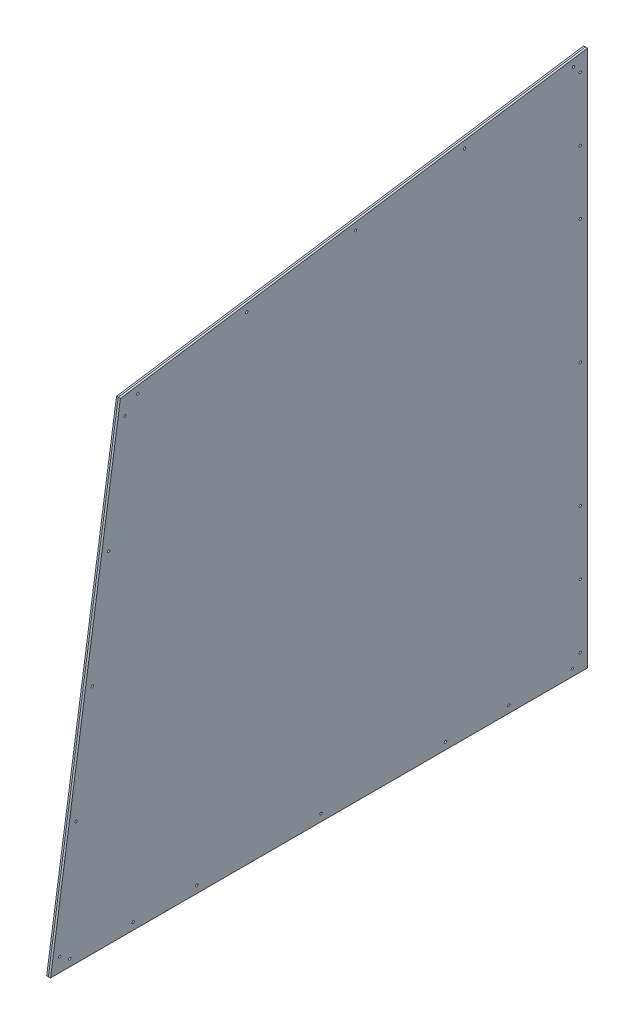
ISO-10303-21;
HEADER;
FILE_DESCRIPTION(('STEP AP214'),'2;1');
FILE_NAME('part.step','',(''),(''),'','','');
FILE_SCHEMA(('AUTOMOTIVE_DESIGN { 1 0 10303 214 1 1 1 1 }'));
ENDSEC;
DATA;
#1=APPLICATION_CONTEXT('core data for automotive mechanical design processes');
#2=APPLICATION_PROTOCOL_DEFINITION('international standard','automotive_design',2000,#1);
#3=PRODUCT_CONTEXT('',#1,'mechanical');
#4=PRODUCT('Part','Part','',(#3));
#5=PRODUCT_RELATED_PRODUCT_CATEGORY('part','',(#4));
#6=PRODUCT_DEFINITION_FORMATION('','',#4);
#7=PRODUCT_DEFINITION_CONTEXT('part definition',#1,'design');
#8=PRODUCT_DEFINITION('design','',#6,#7);
#9=PRODUCT_DEFINITION_SHAPE('','',#8);
#10=(LENGTH_UNIT() NAMED_UNIT(*) SI_UNIT(.MILLI.,.METRE.));
#11=(NAMED_UNIT(*) PLANE_ANGLE_UNIT() SI_UNIT($,.RADIAN.));
#12=(NAMED_UNIT(*) SI_UNIT($,.STERADIAN.) SOLID_ANGLE_UNIT());
#13=UNCERTAINTY_MEASURE_WITH_UNIT(LENGTH_MEASURE(1.E-05),#10,'distance_accuracy_value','');
#14=(GEOMETRIC_REPRESENTATION_CONTEXT(3) GLOBAL_UNCERTAINTY_ASSIGNED_CONTEXT((#13)) GLOBAL_UNIT_ASSIGNED_CONTEXT((#10,
#11,#12)) REPRESENTATION_CONTEXT('',''));
#15=CARTESIAN_POINT('',(0.,0.,0.));
#16=DIRECTION('',(0.,0.,1.));
#17=DIRECTION('',(1.,0.,0.));
#18=AXIS2_PLACEMENT_3D('',#15,#16,#17);
#19=CARTESIAN_POINT('',(4.36562499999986,4.365625,4.36562499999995));
#20=DIRECTION('',(0.,0.,1.));
#21=DIRECTION('',(0.999999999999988,0.,0.));
#22=AXIS2_PLACEMENT_3D('',#19,#20,#21);
#23=PLANE('',#22);
#24=DIRECTION('',(0.,1.,0.));
#25=VECTOR('',#24,1.);
#26=CARTESIAN_POINT('',(-4.36562499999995,4.365625,4.36562500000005));
#27=LINE('',#26,#25);
#28=CARTESIAN_POINT('',(-4.36562499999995,4.365625,4.36562500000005));
#29=VERTEX_POINT('',#28);
#30=CARTESIAN_POINT('',(-4.36562500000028,1211.54426241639,4.36562500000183));
#31=VERTEX_POINT('',#30);
#32=EDGE_CURVE('E97',#29,#31,#27,.T.);
#33=ORIENTED_EDGE('',*,*,#32,.T.);
#34=DIRECTION('',(-0.989001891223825,-0.147902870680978,0.));
#35=VECTOR('',#34,1.);
#36=CARTESIAN_POINT('',(-3.31394337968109E-13,1212.19713120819,4.36562500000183));
#37=LINE('',#36,#35);
#38=CARTESIAN_POINT('',(-3.31394337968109E-13,1212.19713120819,4.36562500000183));
#39=VERTEX_POINT('',#38);
#40=EDGE_CURVE('E81',#39,#31,#37,.T.);
#41=ORIENTED_EDGE('',*,*,#40,.F.);
#42=DIRECTION('',(-0.989001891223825,0.147902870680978,0.));
#43=VECTOR('',#42,1.);
#44=CARTESIAN_POINT('',(-3.31394337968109E-13,1212.19713120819,4.36562500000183));
#45=LINE('',#44,#43);
#46=CARTESIAN_POINT('',(4.36562499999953,1211.54426241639,4.36562500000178));
#47=VERTEX_POINT('',#46);
#48=EDGE_CURVE('E89',#47,#39,#45,.T.);
#49=ORIENTED_EDGE('',*,*,#48,.F.);
#50=DIRECTION('',(0.,1.,0.));
#51=VECTOR('',#50,1.);
#52=CARTESIAN_POINT('',(4.36562499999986,4.365625,4.36562499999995));
#53=LINE('',#52,#51);
#54=CARTESIAN_POINT('',(4.36562499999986,4.365625,4.36562499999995));
#55=VERTEX_POINT('',#54);
#56=EDGE_CURVE('E107',#55,#47,#53,.T.);
#57=ORIENTED_EDGE('',*,*,#56,.F.);
#58=DIRECTION('',(-0.999999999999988,0.,0.));
#59=VECTOR('',#58,1.);
#60=CARTESIAN_POINT('',(4.36562499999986,4.365625,4.36562499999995));
#61=LINE('',#60,#59);
#62=EDGE_CURVE('E103',#55,#29,#61,.T.);
#63=ORIENTED_EDGE('',*,*,#62,.T.);
#64=EDGE_LOOP('',(#33,#41,#49,#57,#63));
#65=FACE_BOUND('',#64,.T.);
#66=ADVANCED_FACE('F32',(#65),#23,.F.);
#67=CARTESIAN_POINT('',(4.36562499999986,4.365625,4.36562499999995));
#68=DIRECTION('',(0.,1.,0.));
#69=DIRECTION('',(0.,0.,1.));
#70=AXIS2_PLACEMENT_3D('',#67,#68,#69);
#71=PLANE('',#70);
#72=DIRECTION('',(0.989001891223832,0.,-0.147902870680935));
#73=VECTOR('',#72,1.);
#74=CARTESIAN_POINT('',(-7.26846872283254E-12,4.36562500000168,1212.19713120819));
#75=LINE('',#74,#73);
#76=CARTESIAN_POINT('',(-7.26846872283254E-12,4.36562500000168,1212.19713120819));
#77=VERTEX_POINT('',#76);
#78=CARTESIAN_POINT('',(4.36562499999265,4.36562500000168,1211.54426241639));
#79=VERTEX_POINT('',#78);
#80=EDGE_CURVE('E109',#77,#79,#75,.T.);
#81=ORIENTED_EDGE('',*,*,#80,.F.);
#82=DIRECTION('',(0.989001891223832,0.,0.147902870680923));
#83=VECTOR('',#82,1.);
#84=CARTESIAN_POINT('',(-7.26846872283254E-12,4.36562500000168,1212.19713120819));
#85=LINE('',#84,#83);
#86=CARTESIAN_POINT('',(-4.36562500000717,4.36562500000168,1211.54426241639));
#87=VERTEX_POINT('',#86);
#88=EDGE_CURVE('E126',#87,#77,#85,.T.);
#89=ORIENTED_EDGE('',*,*,#88,.F.);
#90=DIRECTION('',(0.,0.,-1.));
#91=VECTOR('',#90,1.);
#92=CARTESIAN_POINT('',(-4.36562499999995,4.365625,4.36562500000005));
#93=LINE('',#92,#91);
#94=EDGE_CURVE('E104',#87,#29,#93,.T.);
#95=ORIENTED_EDGE('',*,*,#94,.T.);
#96=ORIENTED_EDGE('',*,*,#62,.F.);
#97=DIRECTION('',(0.,0.,-1.));
#98=VECTOR('',#97,1.);
#99=CARTESIAN_POINT('',(4.36562499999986,4.365625,4.36562499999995));
#100=LINE('',#99,#98);
#101=EDGE_CURVE('E55',#79,#55,#100,.T.);
#102=ORIENTED_EDGE('',*,*,#101,.F.);
#103=EDGE_LOOP('',(#81,#89,#95,#96,#102));
#104=FACE_BOUND('',#103,.T.);
#105=ADVANCED_FACE('F133',(#104),#71,.F.);
#106=CARTESIAN_POINT('',(4.36562499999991,0.,0.));
#107=DIRECTION('',(0.999999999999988,0.,0.));
#108=DIRECTION('',(0.,0.,-1.));
#109=AXIS2_PLACEMENT_3D('',#106,#107,#108);
#110=PLANE('',#109);
#111=CARTESIAN_POINT('',(4.36562499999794,1154.13041917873,280.602864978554));
#112=DIRECTION('',(0.999999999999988,0.,0.));
#113=DIRECTION('',(0.,0.,-1.));
#114=AXIS2_PLACEMENT_3D('',#111,#112,#113);
#115=CIRCLE('',#114,2.57937000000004);
#116=CARTESIAN_POINT('',(4.36562499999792,1154.13041917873,278.023494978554));
#117=VERTEX_POINT('',#116);
#118=EDGE_CURVE('E277',#117,#117,#115,.T.);
#119=ORIENTED_EDGE('',*,*,#118,.F.);
#120=EDGE_LOOP('',(#119));
#121=FACE_BOUND('',#120,.T.);
#122=CARTESIAN_POINT('',(4.36562499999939,1190.75856510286,35.6765466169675));
#123=DIRECTION('',(0.999999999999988,0.,0.));
#124=DIRECTION('',(0.,0.,-1.));
#125=AXIS2_PLACEMENT_3D('',#122,#123,#124);
#126=CIRCLE('',#125,2.57937000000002);
#127=CARTESIAN_POINT('',(4.36562499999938,1190.75856510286,33.0971766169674));
#128=VERTEX_POINT('',#127);
#129=EDGE_CURVE('E271',#128,#128,#126,.T.);
#130=ORIENTED_EDGE('',*,*,#129,.F.);
#131=EDGE_LOOP('',(#130));
#132=FACE_BOUND('',#131,.T.);
#133=CARTESIAN_POINT('',(4.36562499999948,1172.765625,20.2406250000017));
#134=DIRECTION('',(0.999999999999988,0.,0.));
#135=DIRECTION('',(0.,0.,-1.));
#136=AXIS2_PLACEMENT_3D('',#133,#134,#135);
#137=CIRCLE('',#136,2.57937000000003);
#138=CARTESIAN_POINT('',(4.36562499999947,1172.765625,17.6612550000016));
#139=VERTEX_POINT('',#138);
#140=EDGE_CURVE('E265',#139,#139,#137,.T.);
#141=ORIENTED_EDGE('',*,*,#140,.F.);
#142=EDGE_LOOP('',(#141));
#143=FACE_BOUND('',#142,.T.);
#144=CARTESIAN_POINT('',(4.36562499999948,1029.890625,20.2406250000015));
#145=DIRECTION('',(0.999999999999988,0.,0.));
#146=DIRECTION('',(0.,0.,-1.));
#147=AXIS2_PLACEMENT_3D('',#144,#145,#146);
#148=CIRCLE('',#147,2.57937000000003);
#149=CARTESIAN_POINT('',(4.36562499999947,1029.890625,17.6612550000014));
#150=VERTEX_POINT('',#149);
#151=EDGE_CURVE('E259',#150,#150,#148,.T.);
#152=ORIENTED_EDGE('',*,*,#151,.F.);
#153=EDGE_LOOP('',(#152));
#154=FACE_BOUND('',#153,.T.);
#155=CARTESIAN_POINT('',(4.36562499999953,887.015625,20.2406250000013));
#156=DIRECTION('',(0.999999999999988,0.,0.));
#157=DIRECTION('',(0.,0.,-1.));
#158=AXIS2_PLACEMENT_3D('',#155,#156,#157);
#159=CIRCLE('',#158,2.57936999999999);
#160=CARTESIAN_POINT('',(4.36562499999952,887.015625,17.6612550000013));
#161=VERTEX_POINT('',#160);
#162=EDGE_CURVE('E253',#161,#161,#159,.T.);
#163=ORIENTED_EDGE('',*,*,#162,.F.);
#164=EDGE_LOOP('',(#163));
#165=FACE_BOUND('',#164,.T.);
#166=CARTESIAN_POINT('',(4.36562499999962,607.615625,20.2406250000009));
#167=DIRECTION('',(0.999999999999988,0.,0.));
#168=DIRECTION('',(0.,0.,-1.));
#169=AXIS2_PLACEMENT_3D('',#166,#167,#168);
#170=CIRCLE('',#169,2.57936999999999);
#171=CARTESIAN_POINT('',(4.36562499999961,607.615625,17.6612550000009));
#172=VERTEX_POINT('',#171);
#173=EDGE_CURVE('E247',#172,#172,#170,.T.);
#174=ORIENTED_EDGE('',*,*,#173,.F.);
#175=EDGE_LOOP('',(#174));
#176=FACE_BOUND('',#175,.T.);
#177=CARTESIAN_POINT('',(4.36562499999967,328.215625,20.2406250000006));
#178=DIRECTION('',(0.999999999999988,0.,0.));
#179=DIRECTION('',(0.,0.,-1.));
#180=AXIS2_PLACEMENT_3D('',#177,#178,#179);
#181=CIRCLE('',#180,2.57937000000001);
#182=CARTESIAN_POINT('',(4.36562499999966,328.215625,17.6612550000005));
#183=VERTEX_POINT('',#182);
#184=EDGE_CURVE('E241',#183,#183,#181,.T.);
#185=ORIENTED_EDGE('',*,*,#184,.F.);
#186=EDGE_LOOP('',(#185));
#187=FACE_BOUND('',#186,.T.);
#188=CARTESIAN_POINT('',(4.36562499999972,185.340625,20.2406250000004));
#189=DIRECTION('',(0.999999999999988,0.,0.));
#190=DIRECTION('',(0.,0.,-1.));
#191=AXIS2_PLACEMENT_3D('',#188,#189,#190);
#192=CIRCLE('',#191,2.57937);
#193=CARTESIAN_POINT('',(4.3656249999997,185.340625,17.6612550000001));
#194=VERTEX_POINT('',#193);
#195=EDGE_CURVE('E235',#194,#194,#192,.T.);
#196=ORIENTED_EDGE('',*,*,#195,.F.);
#197=EDGE_LOOP('',(#196));
#198=FACE_BOUND('',#197,.T.);
#199=CARTESIAN_POINT('',(4.36562499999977,42.4656249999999,20.240625));
#200=DIRECTION('',(0.999999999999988,0.,0.));
#201=DIRECTION('',(0.,0.,-1.));
#202=AXIS2_PLACEMENT_3D('',#199,#200,#201);
#203=CIRCLE('',#202,2.57937);
#204=CARTESIAN_POINT('',(4.36562499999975,42.4656249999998,17.6612549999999));
#205=VERTEX_POINT('',#204);
#206=EDGE_CURVE('E229',#205,#205,#203,.T.);
#207=ORIENTED_EDGE('',*,*,#206,.F.);
#208=EDGE_LOOP('',(#207));
#209=FACE_BOUND('',#208,.T.);
#210=CARTESIAN_POINT('',(4.36562499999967,20.2406249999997,38.1));
#211=DIRECTION('',(0.999999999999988,0.,0.));
#212=DIRECTION('',(0.,0.,-1.));
#213=AXIS2_PLACEMENT_3D('',#210,#211,#212);
#214=CIRCLE('',#213,2.57937);
#215=CARTESIAN_POINT('',(4.36562499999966,20.2406249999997,35.52063));
#216=VERTEX_POINT('',#215);
#217=EDGE_CURVE('E223',#216,#216,#214,.T.);
#218=ORIENTED_EDGE('',*,*,#217,.F.);
#219=EDGE_LOOP('',(#218));
#220=FACE_BOUND('',#219,.T.);
#221=CARTESIAN_POINT('',(4.36562499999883,20.2406249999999,180.975));
#222=DIRECTION('',(0.999999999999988,0.,0.));
#223=DIRECTION('',(0.,0.,-1.));
#224=AXIS2_PLACEMENT_3D('',#221,#222,#223);
#225=CIRCLE('',#224,2.57936999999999);
#226=CARTESIAN_POINT('',(4.36562499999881,20.2406249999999,178.39563));
#227=VERTEX_POINT('',#226);
#228=EDGE_CURVE('E217',#227,#227,#225,.T.);
#229=ORIENTED_EDGE('',*,*,#228,.F.);
#230=EDGE_LOOP('',(#229));
#231=FACE_BOUND('',#230,.T.);
#232=CARTESIAN_POINT('',(4.36562499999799,20.2406250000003,323.85));
#233=DIRECTION('',(0.999999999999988,0.,0.));
#234=DIRECTION('',(0.,0.,-1.));
#235=AXIS2_PLACEMENT_3D('',#232,#233,#234);
#236=CIRCLE('',#235,2.57937000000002);
#237=CARTESIAN_POINT('',(4.36562499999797,20.2406250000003,321.27063));
#238=VERTEX_POINT('',#237);
#239=EDGE_CURVE('E211',#238,#238,#236,.T.);
#240=ORIENTED_EDGE('',*,*,#239,.F.);
#241=EDGE_LOOP('',(#240));
#242=FACE_BOUND('',#241,.T.);
#243=CARTESIAN_POINT('',(4.3656249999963,20.2406250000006,603.25));
#244=DIRECTION('',(0.999999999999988,0.,0.));
#245=DIRECTION('',(0.,0.,-1.));
#246=AXIS2_PLACEMENT_3D('',#243,#244,#245);
#247=CIRCLE('',#246,2.57936999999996);
#248=CARTESIAN_POINT('',(4.36562499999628,20.2406250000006,600.67063));
#249=VERTEX_POINT('',#248);
#250=EDGE_CURVE('E205',#249,#249,#247,.T.);
#251=ORIENTED_EDGE('',*,*,#250,.F.);
#252=EDGE_LOOP('',(#251));
#253=FACE_BOUND('',#252,.T.);
#254=CARTESIAN_POINT('',(4.36562499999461,20.2406250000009,882.65));
#255=DIRECTION('',(0.999999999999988,0.,0.));
#256=DIRECTION('',(0.,0.,-1.));
#257=AXIS2_PLACEMENT_3D('',#254,#255,#256);
#258=CIRCLE('',#257,2.57936999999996);
#259=CARTESIAN_POINT('',(4.3656249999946,20.2406250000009,880.07063));
#260=VERTEX_POINT('',#259);
#261=EDGE_CURVE('E199',#260,#260,#258,.T.);
#262=ORIENTED_EDGE('',*,*,#261,.F.);
#263=EDGE_LOOP('',(#262));
#264=FACE_BOUND('',#263,.T.);
#265=CARTESIAN_POINT('',(4.36562499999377,20.2406250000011,1025.525));
#266=DIRECTION('',(0.999999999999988,0.,0.));
#267=DIRECTION('',(0.,0.,-1.));
#268=AXIS2_PLACEMENT_3D('',#265,#266,#267);
#269=CIRCLE('',#268,2.57937000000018);
#270=CARTESIAN_POINT('',(4.36562499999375,20.2406250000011,1022.94563));
#271=VERTEX_POINT('',#270);
#272=EDGE_CURVE('E193',#271,#271,#269,.T.);
#273=ORIENTED_EDGE('',*,*,#272,.F.);
#274=EDGE_LOOP('',(#273));
#275=FACE_BOUND('',#274,.T.);
#276=CARTESIAN_POINT('',(4.36562499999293,20.2406250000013,1168.4));
#277=DIRECTION('',(0.999999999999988,0.,0.));
#278=DIRECTION('',(0.,0.,-1.));
#279=AXIS2_PLACEMENT_3D('',#276,#277,#278);
#280=CIRCLE('',#279,2.57937000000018);
#281=CARTESIAN_POINT('',(4.36562499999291,20.2406250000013,1165.82063));
#282=VERTEX_POINT('',#281);
#283=EDGE_CURVE('E187',#282,#282,#280,.T.);
#284=ORIENTED_EDGE('',*,*,#283,.F.);
#285=EDGE_LOOP('',(#284));
#286=FACE_BOUND('',#285,.T.);
#287=CARTESIAN_POINT('',(4.36562499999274,35.4213382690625,1190.79631340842));
#288=DIRECTION('',(0.999999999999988,0.,0.));
#289=DIRECTION('',(0.,0.,-1.));
#290=AXIS2_PLACEMENT_3D('',#287,#288,#289);
#291=CIRCLE('',#290,2.57937000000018);
#292=CARTESIAN_POINT('',(4.36562499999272,35.4213382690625,1188.21694340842));
#293=VERTEX_POINT('',#292);
#294=EDGE_CURVE('E181',#293,#293,#291,.T.);
#295=ORIENTED_EDGE('',*,*,#294,.F.);
#296=EDGE_LOOP('',(#295));
#297=FACE_BOUND('',#296,.T.);
#298=CARTESIAN_POINT('',(4.36562499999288,280.347656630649,1154.16816748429));
#299=DIRECTION('',(0.999999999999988,0.,0.));
#300=DIRECTION('',(0.,0.,-1.));
#301=AXIS2_PLACEMENT_3D('',#298,#299,#300);
#302=CIRCLE('',#301,2.57937000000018);
#303=CARTESIAN_POINT('',(4.36562499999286,280.347656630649,1151.58879748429));
#304=VERTEX_POINT('',#303);
#305=EDGE_CURVE('E175',#304,#304,#302,.T.);
#306=ORIENTED_EDGE('',*,*,#305,.F.);
#307=EDGE_LOOP('',(#306));
#308=FACE_BOUND('',#307,.T.);
#309=CARTESIAN_POINT('',(4.36562499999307,525.273974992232,1117.54002156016));
#310=DIRECTION('',(0.999999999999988,0.,0.));
#311=DIRECTION('',(0.,0.,-1.));
#312=AXIS2_PLACEMENT_3D('',#309,#310,#311);
#313=CIRCLE('',#312,2.5793700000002);
#314=CARTESIAN_POINT('',(4.36562499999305,525.273974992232,1114.96065156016));
#315=VERTEX_POINT('',#314);
#316=EDGE_CURVE('E169',#315,#315,#313,.T.);
#317=ORIENTED_EDGE('',*,*,#316,.F.);
#318=EDGE_LOOP('',(#317));
#319=FACE_BOUND('',#318,.T.);
#320=CARTESIAN_POINT('',(4.36562499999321,770.200293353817,1080.91187563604));
#321=DIRECTION('',(0.999999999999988,0.,0.));
#322=DIRECTION('',(0.,0.,-1.));
#323=AXIS2_PLACEMENT_3D('',#320,#321,#322);
#324=CIRCLE('',#323,2.5793700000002);
#325=CARTESIAN_POINT('',(4.36562499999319,770.200293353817,1078.33250563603));
#326=VERTEX_POINT('',#325);
#327=EDGE_CURVE('E163',#326,#326,#324,.T.);
#328=ORIENTED_EDGE('',*,*,#327,.F.);
#329=EDGE_LOOP('',(#328));
#330=FACE_BOUND('',#329,.T.);
#331=CARTESIAN_POINT('',(4.3656249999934,1015.1266117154,1044.28372971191));
#332=DIRECTION('',(0.999999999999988,0.,0.));
#333=DIRECTION('',(0.,0.,-1.));
#334=AXIS2_PLACEMENT_3D('',#331,#332,#333);
#335=CIRCLE('',#334,2.5793700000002);
#336=CARTESIAN_POINT('',(4.36562499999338,1015.1266117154,1041.70435971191));
#337=VERTEX_POINT('',#336);
#338=EDGE_CURVE('E157',#337,#337,#335,.T.);
#339=ORIENTED_EDGE('',*,*,#338,.F.);
#340=EDGE_LOOP('',(#339));
#341=FACE_BOUND('',#340,.T.);
#342=CARTESIAN_POINT('',(4.36562499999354,1044.24598140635,1015.38182006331));
#343=DIRECTION('',(0.999999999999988,0.,0.));
#344=DIRECTION('',(0.,0.,-1.));
#345=AXIS2_PLACEMENT_3D('',#342,#343,#344);
#346=CIRCLE('',#345,2.5793700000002);
#347=CARTESIAN_POINT('',(4.36562499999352,1044.24598140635,1012.80245006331));
#348=VERTEX_POINT('',#347);
#349=EDGE_CURVE('E151',#348,#348,#346,.T.);
#350=ORIENTED_EDGE('',*,*,#349,.F.);
#351=EDGE_LOOP('',(#350));
#352=FACE_BOUND('',#351,.T.);
#353=CARTESIAN_POINT('',(4.36562499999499,1080.87412733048,770.455501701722));
#354=DIRECTION('',(0.999999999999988,0.,0.));
#355=DIRECTION('',(0.,0.,-1.));
#356=AXIS2_PLACEMENT_3D('',#353,#354,#355);
#357=CIRCLE('',#356,2.57936999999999);
#358=CARTESIAN_POINT('',(4.36562499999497,1080.87412733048,767.876131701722));
#359=VERTEX_POINT('',#358);
#360=EDGE_CURVE('E145',#359,#359,#357,.T.);
#361=ORIENTED_EDGE('',*,*,#360,.F.);
#362=EDGE_LOOP('',(#361));
#363=FACE_BOUND('',#362,.T.);
#364=CARTESIAN_POINT('',(4.36562499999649,1117.50227325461,525.529183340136));
#365=DIRECTION('',(0.999999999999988,0.,0.));
#366=DIRECTION('',(0.,0.,-1.));
#367=AXIS2_PLACEMENT_3D('',#364,#365,#366);
#368=CIRCLE('',#367,2.57936999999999);
#369=CARTESIAN_POINT('',(4.36562499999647,1117.50227325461,522.949813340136));
#370=VERTEX_POINT('',#369);
#371=EDGE_CURVE('E139',#370,#370,#368,.T.);
#372=ORIENTED_EDGE('',*,*,#371,.F.);
#373=EDGE_LOOP('',(#372));
#374=FACE_BOUND('',#373,.T.);
#375=DIRECTION('',(0.,0.147902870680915,-0.989001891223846));
#376=VECTOR('',#375,1.);
#377=CARTESIAN_POINT('',(4.36562499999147,1008.39004634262,1362.82407129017));
#378=LINE('',#377,#376);
#379=CARTESIAN_POINT('',(4.3656249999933,1054.49928214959,1054.49928214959));
#380=VERTEX_POINT('',#379);
#381=EDGE_CURVE('E99',#380,#47,#378,.T.);
#382=ORIENTED_EDGE('',*,*,#381,.F.);
#383=DIRECTION('',(0.,0.989001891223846,-0.147902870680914));
#384=VECTOR('',#383,1.);
#385=CARTESIAN_POINT('',(4.36562499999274,177.315612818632,1185.68000481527));
#386=LINE('',#385,#384);
#387=EDGE_CURVE('E116',#79,#380,#386,.T.);
#388=ORIENTED_EDGE('',*,*,#387,.F.);
#389=ORIENTED_EDGE('',*,*,#101,.T.);
#390=ORIENTED_EDGE('',*,*,#56,.T.);
#391=EDGE_LOOP('',(#382,#388,#389,#390));
#392=FACE_BOUND('',#391,.T.);
#393=ADVANCED_FACE('F131',(#121,#132,#143,#154,#165,#176,#187,#198,#209,#220,#231,#242,#253,
#264,#275,#286,#297,#308,#319,#330,#341,#352,#363,#374,#392),#110,.T.);
#394=CARTESIAN_POINT('',(-4.36562499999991,0.,0.));
#395=DIRECTION('',(0.999999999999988,0.,0.));
#396=DIRECTION('',(0.,0.,-1.));
#397=AXIS2_PLACEMENT_3D('',#394,#395,#396);
#398=PLANE('',#397);
#399=CARTESIAN_POINT('',(-4.36562500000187,1154.13041917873,280.602864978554));
#400=DIRECTION('',(0.999999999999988,0.,0.));
#401=DIRECTION('',(0.,0.,-1.));
#402=AXIS2_PLACEMENT_3D('',#399,#400,#401);
#403=CIRCLE('',#402,2.57937000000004);
#404=CARTESIAN_POINT('',(-4.36562500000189,1154.13041917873,278.023494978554));
#405=VERTEX_POINT('',#404);
#406=EDGE_CURVE('E274',#405,#405,#403,.T.);
#407=ORIENTED_EDGE('',*,*,#406,.T.);
#408=EDGE_LOOP('',(#407));
#409=FACE_BOUND('',#408,.T.);
#410=CARTESIAN_POINT('',(-4.36562500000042,1190.75856510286,35.6765466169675));
#411=DIRECTION('',(0.999999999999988,0.,0.));
#412=DIRECTION('',(0.,0.,-1.));
#413=AXIS2_PLACEMENT_3D('',#410,#411,#412);
#414=CIRCLE('',#413,2.57937000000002);
#415=CARTESIAN_POINT('',(-4.36562500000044,1190.75856510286,33.0971766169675));
#416=VERTEX_POINT('',#415);
#417=EDGE_CURVE('E268',#416,#416,#414,.T.);
#418=ORIENTED_EDGE('',*,*,#417,.T.);
#419=EDGE_LOOP('',(#418));
#420=FACE_BOUND('',#419,.T.);
#421=CARTESIAN_POINT('',(-4.36562500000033,1172.765625,20.2406250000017));
#422=DIRECTION('',(0.999999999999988,0.,0.));
#423=DIRECTION('',(0.,0.,-1.));
#424=AXIS2_PLACEMENT_3D('',#421,#422,#423);
#425=CIRCLE('',#424,2.57937000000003);
#426=CARTESIAN_POINT('',(-4.36562500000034,1172.765625,17.6612550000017));
#427=VERTEX_POINT('',#426);
#428=EDGE_CURVE('E262',#427,#427,#425,.T.);
#429=ORIENTED_EDGE('',*,*,#428,.T.);
#430=EDGE_LOOP('',(#429));
#431=FACE_BOUND('',#430,.T.);
#432=CARTESIAN_POINT('',(-4.36562500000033,1029.890625,20.2406250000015));
#433=DIRECTION('',(0.999999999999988,0.,0.));
#434=DIRECTION('',(0.,0.,-1.));
#435=AXIS2_PLACEMENT_3D('',#432,#433,#434);
#436=CIRCLE('',#435,2.57937000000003);
#437=CARTESIAN_POINT('',(-4.36562500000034,1029.890625,17.6612550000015));
#438=VERTEX_POINT('',#437);
#439=EDGE_CURVE('E256',#438,#438,#436,.T.);
#440=ORIENTED_EDGE('',*,*,#439,.T.);
#441=EDGE_LOOP('',(#440));
#442=FACE_BOUND('',#441,.T.);
#443=CARTESIAN_POINT('',(-4.36562500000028,887.015625,20.2406250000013));
#444=DIRECTION('',(0.999999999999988,0.,0.));
#445=DIRECTION('',(0.,0.,-1.));
#446=AXIS2_PLACEMENT_3D('',#443,#444,#445);
#447=CIRCLE('',#446,2.57936999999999);
#448=CARTESIAN_POINT('',(-4.3656250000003,887.015625,17.6612550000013));
#449=VERTEX_POINT('',#448);
#450=EDGE_CURVE('E250',#449,#449,#447,.T.);
#451=ORIENTED_EDGE('',*,*,#450,.T.);
#452=EDGE_LOOP('',(#451));
#453=FACE_BOUND('',#452,.T.);
#454=CARTESIAN_POINT('',(-4.36562500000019,607.615625,20.2406250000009));
#455=DIRECTION('',(0.999999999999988,0.,0.));
#456=DIRECTION('',(0.,0.,-1.));
#457=AXIS2_PLACEMENT_3D('',#454,#455,#456);
#458=CIRCLE('',#457,2.57936999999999);
#459=CARTESIAN_POINT('',(-4.3656250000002,607.615625,17.6612550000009));
#460=VERTEX_POINT('',#459);
#461=EDGE_CURVE('E244',#460,#460,#458,.T.);
#462=ORIENTED_EDGE('',*,*,#461,.T.);
#463=EDGE_LOOP('',(#462));
#464=FACE_BOUND('',#463,.T.);
#465=CARTESIAN_POINT('',(-4.36562500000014,328.215625,20.2406250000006));
#466=DIRECTION('',(0.999999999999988,0.,0.));
#467=DIRECTION('',(0.,0.,-1.));
#468=AXIS2_PLACEMENT_3D('',#465,#466,#467);
#469=CIRCLE('',#468,2.57937000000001);
#470=CARTESIAN_POINT('',(-4.36562500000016,328.215625,17.6612550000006));
#471=VERTEX_POINT('',#470);
#472=EDGE_CURVE('E238',#471,#471,#469,.T.);
#473=ORIENTED_EDGE('',*,*,#472,.T.);
#474=EDGE_LOOP('',(#473));
#475=FACE_BOUND('',#474,.T.);
#476=CARTESIAN_POINT('',(-4.36562500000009,185.340625,20.2406250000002));
#477=DIRECTION('',(0.999999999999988,0.,0.));
#478=DIRECTION('',(0.,0.,-1.));
#479=AXIS2_PLACEMENT_3D('',#476,#477,#478);
#480=CIRCLE('',#479,2.57937);
#481=CARTESIAN_POINT('',(-4.36562500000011,185.340625,17.6612550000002));
#482=VERTEX_POINT('',#481);
#483=EDGE_CURVE('E232',#482,#482,#480,.T.);
#484=ORIENTED_EDGE('',*,*,#483,.T.);
#485=EDGE_LOOP('',(#484));
#486=FACE_BOUND('',#485,.T.);
#487=CARTESIAN_POINT('',(-4.36562500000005,42.4656249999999,20.240625));
#488=DIRECTION('',(0.999999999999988,0.,0.));
#489=DIRECTION('',(0.,0.,-1.));
#490=AXIS2_PLACEMENT_3D('',#487,#488,#489);
#491=CIRCLE('',#490,2.57937);
#492=CARTESIAN_POINT('',(-4.36562500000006,42.4656249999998,17.661255));
#493=VERTEX_POINT('',#492);
#494=EDGE_CURVE('E226',#493,#493,#491,.T.);
#495=ORIENTED_EDGE('',*,*,#494,.T.);
#496=EDGE_LOOP('',(#495));
#497=FACE_BOUND('',#496,.T.);
#498=CARTESIAN_POINT('',(-4.36562500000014,20.2406249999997,38.1));
#499=DIRECTION('',(0.999999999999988,0.,0.));
#500=DIRECTION('',(0.,0.,-1.));
#501=AXIS2_PLACEMENT_3D('',#498,#499,#500);
#502=CIRCLE('',#501,2.57937);
#503=CARTESIAN_POINT('',(-4.36562500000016,20.2406249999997,35.52063));
#504=VERTEX_POINT('',#503);
#505=EDGE_CURVE('E220',#504,#504,#502,.T.);
#506=ORIENTED_EDGE('',*,*,#505,.T.);
#507=EDGE_LOOP('',(#506));
#508=FACE_BOUND('',#507,.T.);
#509=CARTESIAN_POINT('',(-4.36562500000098,20.2406249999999,180.975));
#510=DIRECTION('',(0.999999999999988,0.,0.));
#511=DIRECTION('',(0.,0.,-1.));
#512=AXIS2_PLACEMENT_3D('',#509,#510,#511);
#513=CIRCLE('',#512,2.57936999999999);
#514=CARTESIAN_POINT('',(-4.365625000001,20.2406249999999,178.39563));
#515=VERTEX_POINT('',#514);
#516=EDGE_CURVE('E214',#515,#515,#513,.T.);
#517=ORIENTED_EDGE('',*,*,#516,.T.);
#518=EDGE_LOOP('',(#517));
#519=FACE_BOUND('',#518,.T.);
#520=CARTESIAN_POINT('',(-4.36562500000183,20.2406250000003,323.85));
#521=DIRECTION('',(0.999999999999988,0.,0.));
#522=DIRECTION('',(0.,0.,-1.));
#523=AXIS2_PLACEMENT_3D('',#520,#521,#522);
#524=CIRCLE('',#523,2.57937000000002);
#525=CARTESIAN_POINT('',(-4.36562500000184,20.2406250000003,321.27063));
#526=VERTEX_POINT('',#525);
#527=EDGE_CURVE('E208',#526,#526,#524,.T.);
#528=ORIENTED_EDGE('',*,*,#527,.T.);
#529=EDGE_LOOP('',(#528));
#530=FACE_BOUND('',#529,.T.);
#531=CARTESIAN_POINT('',(-4.36562500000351,20.2406250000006,603.25));
#532=DIRECTION('',(0.999999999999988,0.,0.));
#533=DIRECTION('',(0.,0.,-1.));
#534=AXIS2_PLACEMENT_3D('',#531,#532,#533);
#535=CIRCLE('',#534,2.57936999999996);
#536=CARTESIAN_POINT('',(-4.36562500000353,20.2406250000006,600.67063));
#537=VERTEX_POINT('',#536);
#538=EDGE_CURVE('E202',#537,#537,#535,.T.);
#539=ORIENTED_EDGE('',*,*,#538,.T.);
#540=EDGE_LOOP('',(#539));
#541=FACE_BOUND('',#540,.T.);
#542=CARTESIAN_POINT('',(-4.3656250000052,20.2406250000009,882.65));
#543=DIRECTION('',(0.999999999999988,0.,0.));
#544=DIRECTION('',(0.,0.,-1.));
#545=AXIS2_PLACEMENT_3D('',#542,#543,#544);
#546=CIRCLE('',#545,2.57936999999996);
#547=CARTESIAN_POINT('',(-4.36562500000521,20.2406250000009,880.07063));
#548=VERTEX_POINT('',#547);
#549=EDGE_CURVE('E196',#548,#548,#546,.T.);
#550=ORIENTED_EDGE('',*,*,#549,.T.);
#551=EDGE_LOOP('',(#550));
#552=FACE_BOUND('',#551,.T.);
#553=CARTESIAN_POINT('',(-4.36562500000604,20.2406250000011,1025.525));
#554=DIRECTION('',(0.999999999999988,0.,0.));
#555=DIRECTION('',(0.,0.,-1.));
#556=AXIS2_PLACEMENT_3D('',#553,#554,#555);
#557=CIRCLE('',#556,2.57937000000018);
#558=CARTESIAN_POINT('',(-4.36562500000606,20.2406250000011,1022.94563));
#559=VERTEX_POINT('',#558);
#560=EDGE_CURVE('E190',#559,#559,#557,.T.);
#561=ORIENTED_EDGE('',*,*,#560,.T.);
#562=EDGE_LOOP('',(#561));
#563=FACE_BOUND('',#562,.T.);
#564=CARTESIAN_POINT('',(-4.36562500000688,20.2406250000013,1168.4));
#565=DIRECTION('',(0.999999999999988,0.,0.));
#566=DIRECTION('',(0.,0.,-1.));
#567=AXIS2_PLACEMENT_3D('',#564,#565,#566);
#568=CIRCLE('',#567,2.57937000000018);
#569=CARTESIAN_POINT('',(-4.3656250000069,20.2406250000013,1165.82063));
#570=VERTEX_POINT('',#569);
#571=EDGE_CURVE('E184',#570,#570,#568,.T.);
#572=ORIENTED_EDGE('',*,*,#571,.T.);
#573=EDGE_LOOP('',(#572));
#574=FACE_BOUND('',#573,.T.);
#575=CARTESIAN_POINT('',(-4.36562500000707,35.4213382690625,1190.79631340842));
#576=DIRECTION('',(0.999999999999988,0.,0.));
#577=DIRECTION('',(0.,0.,-1.));
#578=AXIS2_PLACEMENT_3D('',#575,#576,#577);
#579=CIRCLE('',#578,2.57937000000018);
#580=CARTESIAN_POINT('',(-4.36562500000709,35.4213382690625,1188.21694340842));
#581=VERTEX_POINT('',#580);
#582=EDGE_CURVE('E178',#581,#581,#579,.T.);
#583=ORIENTED_EDGE('',*,*,#582,.T.);
#584=EDGE_LOOP('',(#583));
#585=FACE_BOUND('',#584,.T.);
#586=CARTESIAN_POINT('',(-4.36562500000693,280.347656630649,1154.16816748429));
#587=DIRECTION('',(0.999999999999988,0.,0.));
#588=DIRECTION('',(0.,0.,-1.));
#589=AXIS2_PLACEMENT_3D('',#586,#587,#588);
#590=CIRCLE('',#589,2.57937000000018);
#591=CARTESIAN_POINT('',(-4.36562500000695,280.347656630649,1151.58879748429));
#592=VERTEX_POINT('',#591);
#593=EDGE_CURVE('E172',#592,#592,#590,.T.);
#594=ORIENTED_EDGE('',*,*,#593,.T.);
#595=EDGE_LOOP('',(#594));
#596=FACE_BOUND('',#595,.T.);
#597=CARTESIAN_POINT('',(-4.36562500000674,525.273974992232,1117.54002156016));
#598=DIRECTION('',(0.999999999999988,0.,0.));
#599=DIRECTION('',(0.,0.,-1.));
#600=AXIS2_PLACEMENT_3D('',#597,#598,#599);
#601=CIRCLE('',#600,2.5793700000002);
#602=CARTESIAN_POINT('',(-4.36562500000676,525.273974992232,1114.96065156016));
#603=VERTEX_POINT('',#602);
#604=EDGE_CURVE('E166',#603,#603,#601,.T.);
#605=ORIENTED_EDGE('',*,*,#604,.T.);
#606=EDGE_LOOP('',(#605));
#607=FACE_BOUND('',#606,.T.);
#608=CARTESIAN_POINT('',(-4.3656250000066,770.200293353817,1080.91187563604));
#609=DIRECTION('',(0.999999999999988,0.,0.));
#610=DIRECTION('',(0.,0.,-1.));
#611=AXIS2_PLACEMENT_3D('',#608,#609,#610);
#612=CIRCLE('',#611,2.5793700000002);
#613=CARTESIAN_POINT('',(-4.36562500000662,770.200293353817,1078.33250563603));
#614=VERTEX_POINT('',#613);
#615=EDGE_CURVE('E160',#614,#614,#612,.T.);
#616=ORIENTED_EDGE('',*,*,#615,.T.);
#617=EDGE_LOOP('',(#616));
#618=FACE_BOUND('',#617,.T.);
#619=CARTESIAN_POINT('',(-4.36562500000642,1015.1266117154,1044.28372971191));
#620=DIRECTION('',(0.999999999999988,0.,0.));
#621=DIRECTION('',(0.,0.,-1.));
#622=AXIS2_PLACEMENT_3D('',#619,#620,#621);
#623=CIRCLE('',#622,2.5793700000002);
#624=CARTESIAN_POINT('',(-4.36562500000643,1015.1266117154,1041.70435971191));
#625=VERTEX_POINT('',#624);
#626=EDGE_CURVE('E154',#625,#625,#623,.T.);
#627=ORIENTED_EDGE('',*,*,#626,.T.);
#628=EDGE_LOOP('',(#627));
#629=FACE_BOUND('',#628,.T.);
#630=CARTESIAN_POINT('',(-4.36562500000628,1044.24598140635,1015.38182006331));
#631=DIRECTION('',(0.999999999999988,0.,0.));
#632=DIRECTION('',(0.,0.,-1.));
#633=AXIS2_PLACEMENT_3D('',#630,#631,#632);
#634=CIRCLE('',#633,2.5793700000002);
#635=CARTESIAN_POINT('',(-4.36562500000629,1044.24598140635,1012.80245006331));
#636=VERTEX_POINT('',#635);
#637=EDGE_CURVE('E148',#636,#636,#634,.T.);
#638=ORIENTED_EDGE('',*,*,#637,.T.);
#639=EDGE_LOOP('',(#638));
#640=FACE_BOUND('',#639,.T.);
#641=CARTESIAN_POINT('',(-4.36562500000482,1080.87412733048,770.455501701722));
#642=DIRECTION('',(0.999999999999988,0.,0.));
#643=DIRECTION('',(0.,0.,-1.));
#644=AXIS2_PLACEMENT_3D('',#641,#642,#643);
#645=CIRCLE('',#644,2.57936999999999);
#646=CARTESIAN_POINT('',(-4.36562500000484,1080.87412733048,767.876131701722));
#647=VERTEX_POINT('',#646);
#648=EDGE_CURVE('E142',#647,#647,#645,.T.);
#649=ORIENTED_EDGE('',*,*,#648,.T.);
#650=EDGE_LOOP('',(#649));
#651=FACE_BOUND('',#650,.T.);
#652=CARTESIAN_POINT('',(-4.36562500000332,1117.50227325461,525.529183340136));
#653=DIRECTION('',(0.999999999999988,0.,0.));
#654=DIRECTION('',(0.,0.,-1.));
#655=AXIS2_PLACEMENT_3D('',#652,#653,#654);
#656=CIRCLE('',#655,2.57936999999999);
#657=CARTESIAN_POINT('',(-4.36562500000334,1117.50227325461,522.949813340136));
#658=VERTEX_POINT('',#657);
#659=EDGE_CURVE('E90',#658,#658,#656,.T.);
#660=ORIENTED_EDGE('',*,*,#659,.T.);
#661=EDGE_LOOP('',(#660));
#662=FACE_BOUND('',#661,.T.);
#663=DIRECTION('',(0.,0.989001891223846,-0.147902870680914));
#664=VECTOR('',#663,1.);
#665=CARTESIAN_POINT('',(-4.36562500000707,177.315612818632,1185.68000481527));
#666=LINE('',#665,#664);
#667=CARTESIAN_POINT('',(-4.36562500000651,1054.49928214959,1054.49928214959));
#668=VERTEX_POINT('',#667);
#669=EDGE_CURVE('E98',#87,#668,#666,.T.);
#670=ORIENTED_EDGE('',*,*,#669,.T.);
#671=DIRECTION('',(0.,0.147902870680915,-0.989001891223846));
#672=VECTOR('',#671,1.);
#673=CARTESIAN_POINT('',(-4.36562500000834,1008.39004634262,1362.82407129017));
#674=LINE('',#673,#672);
#675=EDGE_CURVE('E46',#668,#31,#674,.T.);
#676=ORIENTED_EDGE('',*,*,#675,.T.);
#677=ORIENTED_EDGE('',*,*,#32,.F.);
#678=ORIENTED_EDGE('',*,*,#94,.F.);
#679=EDGE_LOOP('',(#670,#676,#677,#678));
#680=FACE_BOUND('',#679,.T.);
#681=ADVANCED_FACE('F95',(#409,#420,#431,#442,#453,#464,#475,#486,#497,#508,#519,#530,#541,#552,
#563,#574,#585,#596,#607,#618,#629,#640,#651,#662,#680),#398,.F.);
#682=CARTESIAN_POINT('',(-6.39256663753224E-12,1362.82407129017,1009.04291513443));
#683=DIRECTION('',(-0.146311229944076,-0.146311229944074,-0.978358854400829));
#684=DIRECTION('',(-0.989001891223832,0.,0.147902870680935));
#685=AXIS2_PLACEMENT_3D('',#682,#683,#684);
#686=PLANE('',#685);
#687=ORIENTED_EDGE('',*,*,#387,.T.);
#688=DIRECTION('',(-0.983493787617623,0.127945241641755,0.127945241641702));
#689=VECTOR('',#688,1.);
#690=CARTESIAN_POINT('',(-32.9346838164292,1059.35177545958,1059.35177545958));
#691=LINE('',#690,#689);
#692=CARTESIAN_POINT('',(-6.59447047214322E-12,1055.0672175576,1055.0672175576));
#693=VERTEX_POINT('',#692);
#694=EDGE_CURVE('E11',#380,#693,#691,.T.);
#695=ORIENTED_EDGE('',*,*,#694,.T.);
#696=DIRECTION('',(0.,-0.989001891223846,0.147902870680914));
#697=VECTOR('',#696,1.);
#698=CARTESIAN_POINT('',(-6.39256663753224E-12,1362.82407129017,1009.04291513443));
#699=LINE('',#698,#697);
#700=EDGE_CURVE('E105',#693,#77,#699,.T.);
#701=ORIENTED_EDGE('',*,*,#700,.T.);
#702=ORIENTED_EDGE('',*,*,#80,.T.);
#703=EDGE_LOOP('',(#687,#695,#701,#702));
#704=FACE_BOUND('',#703,.T.);
#705=ADVANCED_FACE('F129',(#704),#686,.F.);
#706=CARTESIAN_POINT('',(-6.39256663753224E-12,1362.82407129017,1009.04291513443));
#707=DIRECTION('',(0.146311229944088,-0.146311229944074,-0.978358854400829));
#708=DIRECTION('',(-0.989001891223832,0.,-0.147902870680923));
#709=AXIS2_PLACEMENT_3D('',#706,#707,#708);
#710=PLANE('',#709);
#711=ORIENTED_EDGE('',*,*,#700,.F.);
#712=DIRECTION('',(-0.983493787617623,-0.127945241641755,-0.12794524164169));
#713=VECTOR('',#712,1.);
#714=CARTESIAN_POINT('',(32.9346838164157,1059.35177545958,1059.35177545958));
#715=LINE('',#714,#713);
#716=EDGE_CURVE('E39',#693,#668,#715,.T.);
#717=ORIENTED_EDGE('',*,*,#716,.T.);
#718=ORIENTED_EDGE('',*,*,#669,.F.);
#719=ORIENTED_EDGE('',*,*,#88,.T.);
#720=EDGE_LOOP('',(#711,#717,#718,#719));
#721=FACE_BOUND('',#720,.T.);
#722=ADVANCED_FACE('F120',(#721),#710,.F.);
#723=CARTESIAN_POINT('',(-8.42447769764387E-12,1009.04291513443,1362.82407129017));
#724=DIRECTION('',(-0.14631122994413,-0.978358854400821,-0.146311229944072));
#725=DIRECTION('',(0.989001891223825,-0.147902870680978,0.));
#726=AXIS2_PLACEMENT_3D('',#723,#724,#725);
#727=PLANE('',#726);
#728=ORIENTED_EDGE('',*,*,#381,.T.);
#729=ORIENTED_EDGE('',*,*,#48,.T.);
#730=DIRECTION('',(0.,0.147902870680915,-0.989001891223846));
#731=VECTOR('',#730,1.);
#732=CARTESIAN_POINT('',(-8.42447769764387E-12,1009.04291513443,1362.82407129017));
#733=LINE('',#732,#731);
#734=EDGE_CURVE('E84',#693,#39,#733,.T.);
#735=ORIENTED_EDGE('',*,*,#734,.F.);
#736=ORIENTED_EDGE('',*,*,#694,.F.);
#737=EDGE_LOOP('',(#728,#729,#735,#736));
#738=FACE_BOUND('',#737,.T.);
#739=ADVANCED_FACE('F124',(#738),#727,.F.);
#740=CARTESIAN_POINT('',(-8.42447769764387E-12,1009.04291513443,1362.82407129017));
#741=DIRECTION('',(0.146311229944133,-0.978358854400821,-0.146311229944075));
#742=DIRECTION('',(0.989001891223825,0.147902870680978,0.));
#743=AXIS2_PLACEMENT_3D('',#740,#741,#742);
#744=PLANE('',#743);
#745=ORIENTED_EDGE('',*,*,#734,.T.);
#746=ORIENTED_EDGE('',*,*,#40,.T.);
#747=ORIENTED_EDGE('',*,*,#675,.F.);
#748=ORIENTED_EDGE('',*,*,#716,.F.);
#749=EDGE_LOOP('',(#745,#746,#747,#748));
#750=FACE_BOUND('',#749,.T.);
#751=ADVANCED_FACE('F82',(#750),#744,.F.);
#752=CARTESIAN_POINT('',(-4.36562500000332,1117.50227325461,525.529183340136));
#753=DIRECTION('',(0.999999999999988,0.,0.));
#754=DIRECTION('',(0.,0.,-1.));
#755=AXIS2_PLACEMENT_3D('',#752,#753,#754);
#756=CYLINDRICAL_SURFACE('',#755,2.57936999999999);
#757=CARTESIAN_POINT('',(-4.36562500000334,1117.50227325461,522.949813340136));
#758=CARTESIAN_POINT('',(-4.27467447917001,1117.50227325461,522.949813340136));
#759=CARTESIAN_POINT('',(-4.18372395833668,1117.50227325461,522.949813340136));
#760=CARTESIAN_POINT('',(-4.00182291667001,1117.50227325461,522.949813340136));
#761=CARTESIAN_POINT('',(-3.91087239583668,1117.50227325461,522.949813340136));
#762=CARTESIAN_POINT('',(-3.72897135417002,1117.50227325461,522.949813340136));
#763=CARTESIAN_POINT('',(-3.63802083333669,1117.50227325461,522.949813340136));
#764=CARTESIAN_POINT('',(-3.45611979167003,1117.50227325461,522.949813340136));
#765=CARTESIAN_POINT('',(-3.3651692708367,1117.50227325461,522.949813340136));
#766=CARTESIAN_POINT('',(-3.18326822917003,1117.50227325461,522.949813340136));
#767=CARTESIAN_POINT('',(-3.0923177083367,1117.50227325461,522.949813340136));
#768=CARTESIAN_POINT('',(-2.91041666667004,1117.50227325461,522.949813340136));
#769=CARTESIAN_POINT('',(-2.81946614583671,1117.50227325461,522.949813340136));
#770=CARTESIAN_POINT('',(-2.63756510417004,1117.50227325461,522.949813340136));
#771=CARTESIAN_POINT('',(-2.54661458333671,1117.50227325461,522.949813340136));
#772=CARTESIAN_POINT('',(-2.36471354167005,1117.50227325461,522.949813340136));
#773=CARTESIAN_POINT('',(-2.27376302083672,1117.50227325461,522.949813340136));
#774=CARTESIAN_POINT('',(-2.09186197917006,1117.50227325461,522.949813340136));
#775=CARTESIAN_POINT('',(-2.00091145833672,1117.50227325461,522.949813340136));
#776=CARTESIAN_POINT('',(-1.81901041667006,1117.50227325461,522.949813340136));
#777=CARTESIAN_POINT('',(-1.72805989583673,1117.50227325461,522.949813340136));
#778=CARTESIAN_POINT('',(-1.54615885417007,1117.50227325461,522.949813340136));
#779=CARTESIAN_POINT('',(-1.45520833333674,1117.50227325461,522.949813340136));
#780=CARTESIAN_POINT('',(-1.27330729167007,1117.50227325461,522.949813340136));
#781=CARTESIAN_POINT('',(-1.18235677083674,1117.50227325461,522.949813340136));
#782=CARTESIAN_POINT('',(-1.00045572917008,1117.50227325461,522.949813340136));
#783=CARTESIAN_POINT('',(-0.909505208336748,1117.50227325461,522.949813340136));
#784=CARTESIAN_POINT('',(-0.727604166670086,1117.50227325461,522.949813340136));
#785=CARTESIAN_POINT('',(-0.636653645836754,1117.50227325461,522.949813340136));
#786=CARTESIAN_POINT('',(-0.454752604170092,1117.50227325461,522.949813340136));
#787=CARTESIAN_POINT('',(-0.363802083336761,1117.50227325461,522.949813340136));
#788=CARTESIAN_POINT('',(-0.181901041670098,1117.50227325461,522.949813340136));
#789=CARTESIAN_POINT('',(-0.0909505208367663,1117.50227325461,522.949813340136));
#790=CARTESIAN_POINT('',(0.0909505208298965,1117.50227325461,522.949813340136));
#791=CARTESIAN_POINT('',(0.181901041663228,1117.50227325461,522.949813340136));
#792=CARTESIAN_POINT('',(0.36380208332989,1117.50227325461,522.949813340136));
#793=CARTESIAN_POINT('',(0.454752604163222,1117.50227325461,522.949813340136));
#794=CARTESIAN_POINT('',(0.636653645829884,1117.50227325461,522.949813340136));
#795=CARTESIAN_POINT('',(0.727604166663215,1117.50227325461,522.949813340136));
#796=CARTESIAN_POINT('',(0.909505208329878,1117.50227325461,522.949813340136));
#797=CARTESIAN_POINT('',(1.00045572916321,1117.50227325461,522.949813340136));
#798=CARTESIAN_POINT('',(1.18235677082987,1117.50227325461,522.949813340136));
#799=CARTESIAN_POINT('',(1.2733072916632,1117.50227325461,522.949813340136));
#800=CARTESIAN_POINT('',(1.45520833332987,1117.50227325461,522.949813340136));
#801=CARTESIAN_POINT('',(1.5461588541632,1117.50227325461,522.949813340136));
#802=CARTESIAN_POINT('',(1.72805989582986,1117.50227325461,522.949813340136));
#803=CARTESIAN_POINT('',(1.81901041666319,1117.50227325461,522.949813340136));
#804=CARTESIAN_POINT('',(2.00091145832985,1117.50227325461,522.949813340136));
#805=CARTESIAN_POINT('',(2.09186197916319,1117.50227325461,522.949813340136));
#806=CARTESIAN_POINT('',(2.27376302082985,1117.50227325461,522.949813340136));
#807=CARTESIAN_POINT('',(2.36471354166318,1117.50227325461,522.949813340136));
#808=CARTESIAN_POINT('',(2.54661458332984,1117.50227325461,522.949813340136));
#809=CARTESIAN_POINT('',(2.63756510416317,1117.50227325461,522.949813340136));
#810=CARTESIAN_POINT('',(2.81946614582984,1117.50227325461,522.949813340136));
#811=CARTESIAN_POINT('',(2.91041666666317,1117.50227325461,522.949813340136));
#812=CARTESIAN_POINT('',(3.09231770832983,1117.50227325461,522.949813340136));
#813=CARTESIAN_POINT('',(3.18326822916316,1117.50227325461,522.949813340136));
#814=CARTESIAN_POINT('',(3.36516927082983,1117.50227325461,522.949813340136));
#815=CARTESIAN_POINT('',(3.45611979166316,1117.50227325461,522.949813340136));
#816=CARTESIAN_POINT('',(3.63802083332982,1117.50227325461,522.949813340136));
#817=CARTESIAN_POINT('',(3.72897135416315,1117.50227325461,522.949813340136));
#818=CARTESIAN_POINT('',(3.91087239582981,1117.50227325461,522.949813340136));
#819=CARTESIAN_POINT('',(4.00182291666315,1117.50227325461,522.949813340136));
#820=CARTESIAN_POINT('',(4.18372395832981,1117.50227325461,522.949813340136));
#821=CARTESIAN_POINT('',(4.27467447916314,1117.50227325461,522.949813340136));
#822=CARTESIAN_POINT('',(4.36562499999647,1117.50227325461,522.949813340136));
#823=B_SPLINE_CURVE_WITH_KNOTS('',3,(#757,#758,#759,#760,#761,#762,#763,#764,#765,#766,#767,
#768,#769,#770,#771,#772,#773,#774,#775,#776,#777,#778,#779,#780,#781,#782,#783,#784,#785,#786,
#787,#788,#789,#790,#791,#792,#793,#794,#795,#796,#797,#798,#799,#800,#801,#802,#803,#804,#805,
#806,#807,#808,#809,#810,#811,#812,#813,#814,#815,#816,#817,#818,#819,#820,#821,#822),
.UNSPECIFIED.,.F.,.F.,(4,2,2,2,2,2,2,2,2,2,2,2,2,2,2,2,2,2,2,2,2,2,2,2,2,2,2,2,2,2,2,2,4),(0.,
0.272851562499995,0.545703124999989,0.818554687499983,1.09140624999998,1.36425781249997,
1.63710937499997,1.90996093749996,2.18281249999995,2.45566406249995,2.72851562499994,
3.00136718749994,3.27421874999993,3.54707031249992,3.81992187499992,4.09277343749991,
4.36562499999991,4.6384765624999,4.91132812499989,5.18417968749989,5.45703124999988,
5.72988281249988,6.00273437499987,6.27558593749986,6.54843749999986,6.82128906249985,
7.09414062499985,7.36699218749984,7.63984374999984,7.91269531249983,8.18554687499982,
8.45839843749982,8.73124999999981),.UNSPECIFIED.);
#824=EDGE_CURVE('BSEAM341',#658,#370,#823,.T.);
#825=ORIENTED_EDGE('',*,*,#659,.F.);
#826=ORIENTED_EDGE('',*,*,#371,.T.);
#827=ORIENTED_EDGE('',*,*,#824,.T.);
#828=ORIENTED_EDGE('',*,*,#824,.F.);
#829=EDGE_LOOP('',(#825,#827,#826,#828));
#830=FACE_BOUND('',#829,.T.);
#831=ADVANCED_FACE('F341',(#830),#756,.F.);
#832=CARTESIAN_POINT('',(-4.36562500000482,1080.87412733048,770.455501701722));
#833=DIRECTION('',(0.999999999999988,0.,0.));
#834=DIRECTION('',(0.,0.,-1.));
#835=AXIS2_PLACEMENT_3D('',#832,#833,#834);
#836=CYLINDRICAL_SURFACE('',#835,2.57936999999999);
#837=CARTESIAN_POINT('',(-4.36562500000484,1080.87412733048,767.876131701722));
#838=CARTESIAN_POINT('',(-4.27467447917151,1080.87412733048,767.876131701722));
#839=CARTESIAN_POINT('',(-4.18372395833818,1080.87412733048,767.876131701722));
#840=CARTESIAN_POINT('',(-4.00182291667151,1080.87412733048,767.876131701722));
#841=CARTESIAN_POINT('',(-3.91087239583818,1080.87412733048,767.876131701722));
#842=CARTESIAN_POINT('',(-3.72897135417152,1080.87412733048,767.876131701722));
#843=CARTESIAN_POINT('',(-3.63802083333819,1080.87412733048,767.876131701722));
#844=CARTESIAN_POINT('',(-3.45611979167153,1080.87412733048,767.876131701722));
#845=CARTESIAN_POINT('',(-3.36516927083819,1080.87412733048,767.876131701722));
#846=CARTESIAN_POINT('',(-3.18326822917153,1080.87412733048,767.876131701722));
#847=CARTESIAN_POINT('',(-3.0923177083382,1080.87412733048,767.876131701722));
#848=CARTESIAN_POINT('',(-2.91041666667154,1080.87412733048,767.876131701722));
#849=CARTESIAN_POINT('',(-2.81946614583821,1080.87412733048,767.876131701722));
#850=CARTESIAN_POINT('',(-2.63756510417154,1080.87412733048,767.876131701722));
#851=CARTESIAN_POINT('',(-2.54661458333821,1080.87412733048,767.876131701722));
#852=CARTESIAN_POINT('',(-2.36471354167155,1080.87412733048,767.876131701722));
#853=CARTESIAN_POINT('',(-2.27376302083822,1080.87412733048,767.876131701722));
#854=CARTESIAN_POINT('',(-2.09186197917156,1080.87412733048,767.876131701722));
#855=CARTESIAN_POINT('',(-2.00091145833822,1080.87412733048,767.876131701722));
#856=CARTESIAN_POINT('',(-1.81901041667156,1080.87412733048,767.876131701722));
#857=CARTESIAN_POINT('',(-1.72805989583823,1080.87412733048,767.876131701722));
#858=CARTESIAN_POINT('',(-1.54615885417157,1080.87412733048,767.876131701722));
#859=CARTESIAN_POINT('',(-1.45520833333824,1080.87412733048,767.876131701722));
#860=CARTESIAN_POINT('',(-1.27330729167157,1080.87412733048,767.876131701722));
#861=CARTESIAN_POINT('',(-1.18235677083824,1080.87412733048,767.876131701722));
#862=CARTESIAN_POINT('',(-1.00045572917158,1080.87412733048,767.876131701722));
#863=CARTESIAN_POINT('',(-0.909505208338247,1080.87412733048,767.876131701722));
#864=CARTESIAN_POINT('',(-0.727604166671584,1080.87412733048,767.876131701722));
#865=CARTESIAN_POINT('',(-0.636653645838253,1080.87412733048,767.876131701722));
#866=CARTESIAN_POINT('',(-0.45475260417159,1080.87412733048,767.876131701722));
#867=CARTESIAN_POINT('',(-0.363802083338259,1080.87412733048,767.876131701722));
#868=CARTESIAN_POINT('',(-0.181901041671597,1080.87412733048,767.876131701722));
#869=CARTESIAN_POINT('',(-0.0909505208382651,1080.87412733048,767.876131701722));
#870=CARTESIAN_POINT('',(0.0909505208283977,1080.87412733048,767.876131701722));
#871=CARTESIAN_POINT('',(0.181901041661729,1080.87412733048,767.876131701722));
#872=CARTESIAN_POINT('',(0.363802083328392,1080.87412733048,767.876131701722));
#873=CARTESIAN_POINT('',(0.454752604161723,1080.87412733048,767.876131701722));
#874=CARTESIAN_POINT('',(0.636653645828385,1080.87412733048,767.876131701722));
#875=CARTESIAN_POINT('',(0.727604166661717,1080.87412733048,767.876131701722));
#876=CARTESIAN_POINT('',(0.909505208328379,1080.87412733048,767.876131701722));
#877=CARTESIAN_POINT('',(1.00045572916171,1080.87412733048,767.876131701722));
#878=CARTESIAN_POINT('',(1.18235677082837,1080.87412733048,767.876131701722));
#879=CARTESIAN_POINT('',(1.27330729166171,1080.87412733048,767.876131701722));
#880=CARTESIAN_POINT('',(1.45520833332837,1080.87412733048,767.876131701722));
#881=CARTESIAN_POINT('',(1.5461588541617,1080.87412733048,767.876131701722));
#882=CARTESIAN_POINT('',(1.72805989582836,1080.87412733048,767.876131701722));
#883=CARTESIAN_POINT('',(1.81901041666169,1080.87412733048,767.876131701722));
#884=CARTESIAN_POINT('',(2.00091145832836,1080.87412733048,767.876131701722));
#885=CARTESIAN_POINT('',(2.09186197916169,1080.87412733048,767.876131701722));
#886=CARTESIAN_POINT('',(2.27376302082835,1080.87412733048,767.876131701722));
#887=CARTESIAN_POINT('',(2.36471354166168,1080.87412733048,767.876131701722));
#888=CARTESIAN_POINT('',(2.54661458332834,1080.87412733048,767.876131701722));
#889=CARTESIAN_POINT('',(2.63756510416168,1080.87412733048,767.876131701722));
#890=CARTESIAN_POINT('',(2.81946614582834,1080.87412733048,767.876131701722));
#891=CARTESIAN_POINT('',(2.91041666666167,1080.87412733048,767.876131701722));
#892=CARTESIAN_POINT('',(3.09231770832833,1080.87412733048,767.876131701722));
#893=CARTESIAN_POINT('',(3.18326822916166,1080.87412733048,767.876131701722));
#894=CARTESIAN_POINT('',(3.36516927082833,1080.87412733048,767.876131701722));
#895=CARTESIAN_POINT('',(3.45611979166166,1080.87412733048,767.876131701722));
#896=CARTESIAN_POINT('',(3.63802083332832,1080.87412733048,767.876131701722));
#897=CARTESIAN_POINT('',(3.72897135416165,1080.87412733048,767.876131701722));
#898=CARTESIAN_POINT('',(3.91087239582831,1080.87412733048,767.876131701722));
#899=CARTESIAN_POINT('',(4.00182291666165,1080.87412733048,767.876131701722));
#900=CARTESIAN_POINT('',(4.18372395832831,1080.87412733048,767.876131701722));
#901=CARTESIAN_POINT('',(4.27467447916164,1080.87412733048,767.876131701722));
#902=CARTESIAN_POINT('',(4.36562499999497,1080.87412733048,767.876131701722));
#903=B_SPLINE_CURVE_WITH_KNOTS('',3,(#837,#838,#839,#840,#841,#842,#843,#844,#845,#846,#847,
#848,#849,#850,#851,#852,#853,#854,#855,#856,#857,#858,#859,#860,#861,#862,#863,#864,#865,#866,
#867,#868,#869,#870,#871,#872,#873,#874,#875,#876,#877,#878,#879,#880,#881,#882,#883,#884,#885,
#886,#887,#888,#889,#890,#891,#892,#893,#894,#895,#896,#897,#898,#899,#900,#901,#902),
.UNSPECIFIED.,.F.,.F.,(4,2,2,2,2,2,2,2,2,2,2,2,2,2,2,2,2,2,2,2,2,2,2,2,2,2,2,2,2,2,2,2,4),(0.,
0.272851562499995,0.545703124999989,0.818554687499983,1.09140624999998,1.36425781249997,
1.63710937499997,1.90996093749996,2.18281249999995,2.45566406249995,2.72851562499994,
3.00136718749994,3.27421874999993,3.54707031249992,3.81992187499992,4.09277343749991,
4.36562499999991,4.6384765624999,4.91132812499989,5.18417968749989,5.45703124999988,
5.72988281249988,6.00273437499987,6.27558593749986,6.54843749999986,6.82128906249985,
7.09414062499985,7.36699218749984,7.63984374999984,7.91269531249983,8.18554687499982,
8.45839843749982,8.73124999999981),.UNSPECIFIED.);
#904=EDGE_CURVE('BSEAM343',#647,#359,#903,.T.);
#905=ORIENTED_EDGE('',*,*,#648,.F.);
#906=ORIENTED_EDGE('',*,*,#360,.T.);
#907=ORIENTED_EDGE('',*,*,#904,.T.);
#908=ORIENTED_EDGE('',*,*,#904,.F.);
#909=EDGE_LOOP('',(#905,#907,#906,#908));
#910=FACE_BOUND('',#909,.T.);
#911=ADVANCED_FACE('F343',(#910),#836,.F.);
#912=CARTESIAN_POINT('',(-4.36562500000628,1044.24598140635,1015.38182006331));
#913=DIRECTION('',(0.999999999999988,0.,0.));
#914=DIRECTION('',(0.,0.,-1.));
#915=AXIS2_PLACEMENT_3D('',#912,#913,#914);
#916=CYLINDRICAL_SURFACE('',#915,2.5793700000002);
#917=CARTESIAN_POINT('',(-4.36562500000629,1044.24598140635,1012.80245006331));
#918=CARTESIAN_POINT('',(-4.27467447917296,1044.24598140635,1012.80245006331));
#919=CARTESIAN_POINT('',(-4.18372395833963,1044.24598140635,1012.80245006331));
#920=CARTESIAN_POINT('',(-4.00182291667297,1044.24598140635,1012.80245006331));
#921=CARTESIAN_POINT('',(-3.91087239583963,1044.24598140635,1012.80245006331));
#922=CARTESIAN_POINT('',(-3.72897135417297,1044.24598140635,1012.80245006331));
#923=CARTESIAN_POINT('',(-3.63802083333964,1044.24598140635,1012.80245006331));
#924=CARTESIAN_POINT('',(-3.45611979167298,1044.24598140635,1012.80245006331));
#925=CARTESIAN_POINT('',(-3.36516927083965,1044.24598140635,1012.80245006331));
#926=CARTESIAN_POINT('',(-3.18326822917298,1044.24598140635,1012.80245006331));
#927=CARTESIAN_POINT('',(-3.09231770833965,1044.24598140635,1012.80245006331));
#928=CARTESIAN_POINT('',(-2.91041666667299,1044.24598140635,1012.80245006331));
#929=CARTESIAN_POINT('',(-2.81946614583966,1044.24598140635,1012.80245006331));
#930=CARTESIAN_POINT('',(-2.637565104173,1044.24598140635,1012.80245006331));
#931=CARTESIAN_POINT('',(-2.54661458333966,1044.24598140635,1012.80245006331));
#932=CARTESIAN_POINT('',(-2.364713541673,1044.24598140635,1012.80245006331));
#933=CARTESIAN_POINT('',(-2.27376302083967,1044.24598140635,1012.80245006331));
#934=CARTESIAN_POINT('',(-2.09186197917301,1044.24598140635,1012.80245006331));
#935=CARTESIAN_POINT('',(-2.00091145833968,1044.24598140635,1012.80245006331));
#936=CARTESIAN_POINT('',(-1.81901041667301,1044.24598140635,1012.80245006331));
#937=CARTESIAN_POINT('',(-1.72805989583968,1044.24598140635,1012.80245006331));
#938=CARTESIAN_POINT('',(-1.54615885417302,1044.24598140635,1012.80245006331));
#939=CARTESIAN_POINT('',(-1.45520833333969,1044.24598140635,1012.80245006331));
#940=CARTESIAN_POINT('',(-1.27330729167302,1044.24598140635,1012.80245006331));
#941=CARTESIAN_POINT('',(-1.18235677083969,1044.24598140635,1012.80245006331));
#942=CARTESIAN_POINT('',(-1.00045572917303,1044.24598140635,1012.80245006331));
#943=CARTESIAN_POINT('',(-0.909505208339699,1044.24598140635,1012.80245006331));
#944=CARTESIAN_POINT('',(-0.727604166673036,1044.24598140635,1012.80245006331));
#945=CARTESIAN_POINT('',(-0.636653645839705,1044.24598140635,1012.80245006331));
#946=CARTESIAN_POINT('',(-0.454752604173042,1044.24598140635,1012.80245006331));
#947=CARTESIAN_POINT('',(-0.363802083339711,1044.24598140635,1012.80245006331));
#948=CARTESIAN_POINT('',(-0.181901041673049,1044.24598140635,1012.80245006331));
#949=CARTESIAN_POINT('',(-0.0909505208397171,1044.24598140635,1012.80245006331));
#950=CARTESIAN_POINT('',(0.0909505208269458,1044.24598140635,1012.80245006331));
#951=CARTESIAN_POINT('',(0.181901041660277,1044.24598140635,1012.80245006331));
#952=CARTESIAN_POINT('',(0.36380208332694,1044.24598140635,1012.80245006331));
#953=CARTESIAN_POINT('',(0.454752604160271,1044.24598140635,1012.80245006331));
#954=CARTESIAN_POINT('',(0.636653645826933,1044.24598140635,1012.80245006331));
#955=CARTESIAN_POINT('',(0.727604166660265,1044.24598140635,1012.80245006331));
#956=CARTESIAN_POINT('',(0.909505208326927,1044.24598140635,1012.80245006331));
#957=CARTESIAN_POINT('',(1.00045572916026,1044.24598140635,1012.80245006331));
#958=CARTESIAN_POINT('',(1.18235677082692,1044.24598140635,1012.80245006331));
#959=CARTESIAN_POINT('',(1.27330729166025,1044.24598140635,1012.80245006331));
#960=CARTESIAN_POINT('',(1.45520833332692,1044.24598140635,1012.80245006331));
#961=CARTESIAN_POINT('',(1.54615885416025,1044.24598140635,1012.80245006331));
#962=CARTESIAN_POINT('',(1.72805989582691,1044.24598140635,1012.80245006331));
#963=CARTESIAN_POINT('',(1.81901041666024,1044.24598140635,1012.80245006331));
#964=CARTESIAN_POINT('',(2.0009114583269,1044.24598140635,1012.80245006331));
#965=CARTESIAN_POINT('',(2.09186197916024,1044.24598140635,1012.80245006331));
#966=CARTESIAN_POINT('',(2.2737630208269,1044.24598140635,1012.80245006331));
#967=CARTESIAN_POINT('',(2.36471354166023,1044.24598140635,1012.80245006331));
#968=CARTESIAN_POINT('',(2.54661458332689,1044.24598140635,1012.80245006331));
#969=CARTESIAN_POINT('',(2.63756510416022,1044.24598140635,1012.80245006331));
#970=CARTESIAN_POINT('',(2.81946614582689,1044.24598140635,1012.80245006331));
#971=CARTESIAN_POINT('',(2.91041666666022,1044.24598140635,1012.80245006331));
#972=CARTESIAN_POINT('',(3.09231770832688,1044.24598140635,1012.80245006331));
#973=CARTESIAN_POINT('',(3.18326822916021,1044.24598140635,1012.80245006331));
#974=CARTESIAN_POINT('',(3.36516927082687,1044.24598140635,1012.80245006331));
#975=CARTESIAN_POINT('',(3.45611979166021,1044.24598140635,1012.80245006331));
#976=CARTESIAN_POINT('',(3.63802083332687,1044.24598140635,1012.80245006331));
#977=CARTESIAN_POINT('',(3.7289713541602,1044.24598140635,1012.80245006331));
#978=CARTESIAN_POINT('',(3.91087239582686,1044.24598140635,1012.80245006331));
#979=CARTESIAN_POINT('',(4.0018229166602,1044.24598140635,1012.80245006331));
#980=CARTESIAN_POINT('',(4.18372395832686,1044.24598140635,1012.80245006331));
#981=CARTESIAN_POINT('',(4.27467447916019,1044.24598140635,1012.80245006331));
#982=CARTESIAN_POINT('',(4.36562499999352,1044.24598140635,1012.80245006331));
#983=B_SPLINE_CURVE_WITH_KNOTS('',3,(#917,#918,#919,#920,#921,#922,#923,#924,#925,#926,#927,
#928,#929,#930,#931,#932,#933,#934,#935,#936,#937,#938,#939,#940,#941,#942,#943,#944,#945,#946,
#947,#948,#949,#950,#951,#952,#953,#954,#955,#956,#957,#958,#959,#960,#961,#962,#963,#964,#965,
#966,#967,#968,#969,#970,#971,#972,#973,#974,#975,#976,#977,#978,#979,#980,#981,#982),
.UNSPECIFIED.,.F.,.F.,(4,2,2,2,2,2,2,2,2,2,2,2,2,2,2,2,2,2,2,2,2,2,2,2,2,2,2,2,2,2,2,2,4),(0.,
0.272851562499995,0.545703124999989,0.818554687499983,1.09140624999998,1.36425781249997,
1.63710937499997,1.90996093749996,2.18281249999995,2.45566406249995,2.72851562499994,
3.00136718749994,3.27421874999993,3.54707031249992,3.81992187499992,4.09277343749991,
4.36562499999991,4.6384765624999,4.91132812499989,5.18417968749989,5.45703124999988,
5.72988281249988,6.00273437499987,6.27558593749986,6.54843749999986,6.82128906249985,
7.09414062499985,7.36699218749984,7.63984374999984,7.91269531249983,8.18554687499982,
8.45839843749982,8.73124999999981),.UNSPECIFIED.);
#984=EDGE_CURVE('BSEAM350',#636,#348,#983,.T.);
#985=ORIENTED_EDGE('',*,*,#637,.F.);
#986=ORIENTED_EDGE('',*,*,#349,.T.);
#987=ORIENTED_EDGE('',*,*,#984,.T.);
#988=ORIENTED_EDGE('',*,*,#984,.F.);
#989=EDGE_LOOP('',(#985,#987,#986,#988));
#990=FACE_BOUND('',#989,.T.);
#991=ADVANCED_FACE('F350',(#990),#916,.F.);
#992=CARTESIAN_POINT('',(-4.36562500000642,1015.1266117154,1044.28372971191));
#993=DIRECTION('',(0.999999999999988,0.,0.));
#994=DIRECTION('',(0.,0.,-1.));
#995=AXIS2_PLACEMENT_3D('',#992,#993,#994);
#996=CYLINDRICAL_SURFACE('',#995,2.5793700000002);
#997=CARTESIAN_POINT('',(-4.36562500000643,1015.1266117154,1041.70435971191));
#998=CARTESIAN_POINT('',(-4.2746744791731,1015.1266117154,1041.70435971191));
#999=CARTESIAN_POINT('',(-4.18372395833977,1015.1266117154,1041.70435971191));
#1000=CARTESIAN_POINT('',(-4.00182291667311,1015.1266117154,1041.70435971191));
#1001=CARTESIAN_POINT('',(-3.91087239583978,1015.1266117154,1041.70435971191));
#1002=CARTESIAN_POINT('',(-3.72897135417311,1015.1266117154,1041.70435971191));
#1003=CARTESIAN_POINT('',(-3.63802083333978,1015.1266117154,1041.70435971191));
#1004=CARTESIAN_POINT('',(-3.45611979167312,1015.1266117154,1041.70435971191));
#1005=CARTESIAN_POINT('',(-3.36516927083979,1015.1266117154,1041.70435971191));
#1006=CARTESIAN_POINT('',(-3.18326822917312,1015.1266117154,1041.70435971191));
#1007=CARTESIAN_POINT('',(-3.09231770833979,1015.1266117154,1041.70435971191));
#1008=CARTESIAN_POINT('',(-2.91041666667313,1015.1266117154,1041.70435971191));
#1009=CARTESIAN_POINT('',(-2.8194661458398,1015.1266117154,1041.70435971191));
#1010=CARTESIAN_POINT('',(-2.63756510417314,1015.1266117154,1041.70435971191));
#1011=CARTESIAN_POINT('',(-2.5466145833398,1015.1266117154,1041.70435971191));
#1012=CARTESIAN_POINT('',(-2.36471354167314,1015.1266117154,1041.70435971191));
#1013=CARTESIAN_POINT('',(-2.27376302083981,1015.1266117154,1041.70435971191));
#1014=CARTESIAN_POINT('',(-2.09186197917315,1015.1266117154,1041.70435971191));
#1015=CARTESIAN_POINT('',(-2.00091145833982,1015.1266117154,1041.70435971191));
#1016=CARTESIAN_POINT('',(-1.81901041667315,1015.1266117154,1041.70435971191));
#1017=CARTESIAN_POINT('',(-1.72805989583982,1015.1266117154,1041.70435971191));
#1018=CARTESIAN_POINT('',(-1.54615885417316,1015.1266117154,1041.70435971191));
#1019=CARTESIAN_POINT('',(-1.45520833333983,1015.1266117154,1041.70435971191));
#1020=CARTESIAN_POINT('',(-1.27330729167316,1015.1266117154,1041.70435971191));
#1021=CARTESIAN_POINT('',(-1.18235677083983,1015.1266117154,1041.70435971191));
#1022=CARTESIAN_POINT('',(-1.00045572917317,1015.1266117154,1041.70435971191));
#1023=CARTESIAN_POINT('',(-0.90950520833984,1015.1266117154,1041.70435971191));
#1024=CARTESIAN_POINT('',(-0.727604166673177,1015.1266117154,1041.70435971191));
#1025=CARTESIAN_POINT('',(-0.636653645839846,1015.1266117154,1041.70435971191));
#1026=CARTESIAN_POINT('',(-0.454752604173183,1015.1266117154,1041.70435971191));
#1027=CARTESIAN_POINT('',(-0.363802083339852,1015.1266117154,1041.70435971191));
#1028=CARTESIAN_POINT('',(-0.181901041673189,1015.1266117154,1041.70435971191));
#1029=CARTESIAN_POINT('',(-0.0909505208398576,1015.1266117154,1041.70435971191));
#1030=CARTESIAN_POINT('',(0.0909505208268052,1015.1266117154,1041.70435971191));
#1031=CARTESIAN_POINT('',(0.181901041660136,1015.1266117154,1041.70435971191));
#1032=CARTESIAN_POINT('',(0.363802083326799,1015.1266117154,1041.70435971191));
#1033=CARTESIAN_POINT('',(0.45475260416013,1015.1266117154,1041.70435971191));
#1034=CARTESIAN_POINT('',(0.636653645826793,1015.1266117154,1041.70435971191));
#1035=CARTESIAN_POINT('',(0.727604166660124,1015.1266117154,1041.70435971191));
#1036=CARTESIAN_POINT('',(0.909505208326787,1015.1266117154,1041.70435971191));
#1037=CARTESIAN_POINT('',(1.00045572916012,1015.1266117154,1041.70435971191));
#1038=CARTESIAN_POINT('',(1.18235677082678,1015.1266117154,1041.70435971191));
#1039=CARTESIAN_POINT('',(1.27330729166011,1015.1266117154,1041.70435971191));
#1040=CARTESIAN_POINT('',(1.45520833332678,1015.1266117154,1041.70435971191));
#1041=CARTESIAN_POINT('',(1.54615885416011,1015.1266117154,1041.70435971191));
#1042=CARTESIAN_POINT('',(1.72805989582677,1015.1266117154,1041.70435971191));
#1043=CARTESIAN_POINT('',(1.8190104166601,1015.1266117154,1041.70435971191));
#1044=CARTESIAN_POINT('',(2.00091145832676,1015.1266117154,1041.70435971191));
#1045=CARTESIAN_POINT('',(2.09186197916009,1015.1266117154,1041.70435971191));
#1046=CARTESIAN_POINT('',(2.27376302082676,1015.1266117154,1041.70435971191));
#1047=CARTESIAN_POINT('',(2.36471354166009,1015.1266117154,1041.70435971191));
#1048=CARTESIAN_POINT('',(2.54661458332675,1015.1266117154,1041.70435971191));
#1049=CARTESIAN_POINT('',(2.63756510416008,1015.1266117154,1041.70435971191));
#1050=CARTESIAN_POINT('',(2.81946614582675,1015.1266117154,1041.70435971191));
#1051=CARTESIAN_POINT('',(2.91041666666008,1015.1266117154,1041.70435971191));
#1052=CARTESIAN_POINT('',(3.09231770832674,1015.1266117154,1041.70435971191));
#1053=CARTESIAN_POINT('',(3.18326822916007,1015.1266117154,1041.70435971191));
#1054=CARTESIAN_POINT('',(3.36516927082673,1015.1266117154,1041.70435971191));
#1055=CARTESIAN_POINT('',(3.45611979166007,1015.1266117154,1041.70435971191));
#1056=CARTESIAN_POINT('',(3.63802083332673,1015.1266117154,1041.70435971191));
#1057=CARTESIAN_POINT('',(3.72897135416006,1015.1266117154,1041.70435971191));
#1058=CARTESIAN_POINT('',(3.91087239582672,1015.1266117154,1041.70435971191));
#1059=CARTESIAN_POINT('',(4.00182291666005,1015.1266117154,1041.70435971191));
#1060=CARTESIAN_POINT('',(4.18372395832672,1015.1266117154,1041.70435971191));
#1061=CARTESIAN_POINT('',(4.27467447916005,1015.1266117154,1041.70435971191));
#1062=CARTESIAN_POINT('',(4.36562499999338,1015.1266117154,1041.70435971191));
#1063=B_SPLINE_CURVE_WITH_KNOTS('',3,(#997,#998,#999,#1000,#1001,#1002,#1003,#1004,#1005,#1006,
#1007,#1008,#1009,#1010,#1011,#1012,#1013,#1014,#1015,#1016,#1017,#1018,#1019,#1020,#1021,#1022,
#1023,#1024,#1025,#1026,#1027,#1028,#1029,#1030,#1031,#1032,#1033,#1034,#1035,#1036,#1037,#1038,
#1039,#1040,#1041,#1042,#1043,#1044,#1045,#1046,#1047,#1048,#1049,#1050,#1051,#1052,#1053,#1054,
#1055,#1056,#1057,#1058,#1059,#1060,#1061,#1062),.UNSPECIFIED.,.F.,.F.,(4,2,2,2,2,2,2,2,2,2,2,2,
2,2,2,2,2,2,2,2,2,2,2,2,2,2,2,2,2,2,2,2,4),(0.,0.272851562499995,0.545703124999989,
0.818554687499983,1.09140624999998,1.36425781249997,1.63710937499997,1.90996093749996,
2.18281249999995,2.45566406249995,2.72851562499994,3.00136718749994,3.27421874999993,
3.54707031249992,3.81992187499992,4.09277343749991,4.36562499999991,4.6384765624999,
4.91132812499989,5.18417968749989,5.45703124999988,5.72988281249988,6.00273437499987,
6.27558593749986,6.54843749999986,6.82128906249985,7.09414062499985,7.36699218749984,
7.63984374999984,7.91269531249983,8.18554687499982,8.45839843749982,8.73124999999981),.UNSPECIFIED.);
#1064=EDGE_CURVE('BSEAM390',#625,#337,#1063,.T.);
#1065=ORIENTED_EDGE('',*,*,#626,.F.);
#1066=ORIENTED_EDGE('',*,*,#338,.T.);
#1067=ORIENTED_EDGE('',*,*,#1064,.T.);
#1068=ORIENTED_EDGE('',*,*,#1064,.F.);
#1069=EDGE_LOOP('',(#1065,#1067,#1066,#1068));
#1070=FACE_BOUND('',#1069,.T.);
#1071=ADVANCED_FACE('F390',(#1070),#996,.F.);
#1072=CARTESIAN_POINT('',(-4.3656250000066,770.200293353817,1080.91187563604));
#1073=DIRECTION('',(0.999999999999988,0.,0.));
#1074=DIRECTION('',(0.,0.,-1.));
#1075=AXIS2_PLACEMENT_3D('',#1072,#1073,#1074);
#1076=CYLINDRICAL_SURFACE('',#1075,2.5793700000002);
#1077=CARTESIAN_POINT('',(-4.36562500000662,770.200293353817,1078.33250563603));
#1078=CARTESIAN_POINT('',(-4.27467447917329,770.200293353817,1078.33250563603));
#1079=CARTESIAN_POINT('',(-4.18372395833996,770.200293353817,1078.33250563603));
#1080=CARTESIAN_POINT('',(-4.00182291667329,770.200293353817,1078.33250563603));
#1081=CARTESIAN_POINT('',(-3.91087239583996,770.200293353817,1078.33250563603));
#1082=CARTESIAN_POINT('',(-3.7289713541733,770.200293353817,1078.33250563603));
#1083=CARTESIAN_POINT('',(-3.63802083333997,770.200293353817,1078.33250563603));
#1084=CARTESIAN_POINT('',(-3.45611979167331,770.200293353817,1078.33250563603));
#1085=CARTESIAN_POINT('',(-3.36516927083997,770.200293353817,1078.33250563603));
#1086=CARTESIAN_POINT('',(-3.18326822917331,770.200293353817,1078.33250563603));
#1087=CARTESIAN_POINT('',(-3.09231770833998,770.200293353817,1078.33250563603));
#1088=CARTESIAN_POINT('',(-2.91041666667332,770.200293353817,1078.33250563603));
#1089=CARTESIAN_POINT('',(-2.81946614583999,770.200293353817,1078.33250563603));
#1090=CARTESIAN_POINT('',(-2.63756510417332,770.200293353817,1078.33250563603));
#1091=CARTESIAN_POINT('',(-2.54661458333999,770.200293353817,1078.33250563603));
#1092=CARTESIAN_POINT('',(-2.36471354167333,770.200293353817,1078.33250563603));
#1093=CARTESIAN_POINT('',(-2.27376302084,770.200293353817,1078.33250563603));
#1094=CARTESIAN_POINT('',(-2.09186197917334,770.200293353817,1078.33250563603));
#1095=CARTESIAN_POINT('',(-2.00091145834,770.200293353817,1078.33250563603));
#1096=CARTESIAN_POINT('',(-1.81901041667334,770.200293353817,1078.33250563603));
#1097=CARTESIAN_POINT('',(-1.72805989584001,770.200293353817,1078.33250563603));
#1098=CARTESIAN_POINT('',(-1.54615885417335,770.200293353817,1078.33250563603));
#1099=CARTESIAN_POINT('',(-1.45520833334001,770.200293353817,1078.33250563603));
#1100=CARTESIAN_POINT('',(-1.27330729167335,770.200293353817,1078.33250563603));
#1101=CARTESIAN_POINT('',(-1.18235677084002,770.200293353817,1078.33250563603));
#1102=CARTESIAN_POINT('',(-1.00045572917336,770.200293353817,1078.33250563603));
#1103=CARTESIAN_POINT('',(-0.909505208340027,770.200293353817,1078.33250563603));
#1104=CARTESIAN_POINT('',(-0.727604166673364,770.200293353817,1078.33250563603));
#1105=CARTESIAN_POINT('',(-0.636653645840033,770.200293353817,1078.33250563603));
#1106=CARTESIAN_POINT('',(-0.45475260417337,770.200293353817,1078.33250563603));
#1107=CARTESIAN_POINT('',(-0.363802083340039,770.200293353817,1078.33250563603));
#1108=CARTESIAN_POINT('',(-0.181901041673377,770.200293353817,1078.33250563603));
#1109=CARTESIAN_POINT('',(-0.0909505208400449,770.200293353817,1078.33250563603));
#1110=CARTESIAN_POINT('',(0.0909505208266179,770.200293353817,1078.33250563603));
#1111=CARTESIAN_POINT('',(0.181901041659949,770.200293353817,1078.33250563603));
#1112=CARTESIAN_POINT('',(0.363802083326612,770.200293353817,1078.33250563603));
#1113=CARTESIAN_POINT('',(0.454752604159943,770.200293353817,1078.33250563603));
#1114=CARTESIAN_POINT('',(0.636653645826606,770.200293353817,1078.33250563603));
#1115=CARTESIAN_POINT('',(0.727604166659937,770.200293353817,1078.33250563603));
#1116=CARTESIAN_POINT('',(0.9095052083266,770.200293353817,1078.33250563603));
#1117=CARTESIAN_POINT('',(1.00045572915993,770.200293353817,1078.33250563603));
#1118=CARTESIAN_POINT('',(1.18235677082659,770.200293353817,1078.33250563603));
#1119=CARTESIAN_POINT('',(1.27330729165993,770.200293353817,1078.33250563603));
#1120=CARTESIAN_POINT('',(1.45520833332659,770.200293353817,1078.33250563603));
#1121=CARTESIAN_POINT('',(1.54615885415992,770.200293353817,1078.33250563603));
#1122=CARTESIAN_POINT('',(1.72805989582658,770.200293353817,1078.33250563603));
#1123=CARTESIAN_POINT('',(1.81901041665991,770.200293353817,1078.33250563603));
#1124=CARTESIAN_POINT('',(2.00091145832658,770.200293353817,1078.33250563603));
#1125=CARTESIAN_POINT('',(2.09186197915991,770.200293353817,1078.33250563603));
#1126=CARTESIAN_POINT('',(2.27376302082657,770.200293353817,1078.33250563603));
#1127=CARTESIAN_POINT('',(2.3647135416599,770.200293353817,1078.33250563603));
#1128=CARTESIAN_POINT('',(2.54661458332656,770.200293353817,1078.33250563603));
#1129=CARTESIAN_POINT('',(2.6375651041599,770.200293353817,1078.33250563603));
#1130=CARTESIAN_POINT('',(2.81946614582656,770.200293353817,1078.33250563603));
#1131=CARTESIAN_POINT('',(2.91041666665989,770.200293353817,1078.33250563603));
#1132=CARTESIAN_POINT('',(3.09231770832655,770.200293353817,1078.33250563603));
#1133=CARTESIAN_POINT('',(3.18326822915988,770.200293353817,1078.33250563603));
#1134=CARTESIAN_POINT('',(3.36516927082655,770.200293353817,1078.33250563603));
#1135=CARTESIAN_POINT('',(3.45611979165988,770.200293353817,1078.33250563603));
#1136=CARTESIAN_POINT('',(3.63802083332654,770.200293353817,1078.33250563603));
#1137=CARTESIAN_POINT('',(3.72897135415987,770.200293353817,1078.33250563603));
#1138=CARTESIAN_POINT('',(3.91087239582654,770.200293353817,1078.33250563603));
#1139=CARTESIAN_POINT('',(4.00182291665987,770.200293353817,1078.33250563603));
#1140=CARTESIAN_POINT('',(4.18372395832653,770.200293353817,1078.33250563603));
#1141=CARTESIAN_POINT('',(4.27467447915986,770.200293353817,1078.33250563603));
#1142=CARTESIAN_POINT('',(4.36562499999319,770.200293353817,1078.33250563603));
#1143=B_SPLINE_CURVE_WITH_KNOTS('',3,(#1077,#1078,#1079,#1080,#1081,#1082,#1083,#1084,#1085,
#1086,#1087,#1088,#1089,#1090,#1091,#1092,#1093,#1094,#1095,#1096,#1097,#1098,#1099,#1100,#1101,
#1102,#1103,#1104,#1105,#1106,#1107,#1108,#1109,#1110,#1111,#1112,#1113,#1114,#1115,#1116,#1117,
#1118,#1119,#1120,#1121,#1122,#1123,#1124,#1125,#1126,#1127,#1128,#1129,#1130,#1131,#1132,#1133,
#1134,#1135,#1136,#1137,#1138,#1139,#1140,#1141,#1142),.UNSPECIFIED.,.F.,.F.,(4,2,2,2,2,2,2,2,2,
2,2,2,2,2,2,2,2,2,2,2,2,2,2,2,2,2,2,2,2,2,2,2,4),(0.,0.272851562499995,0.545703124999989,
0.818554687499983,1.09140624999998,1.36425781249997,1.63710937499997,1.90996093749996,
2.18281249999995,2.45566406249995,2.72851562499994,3.00136718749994,3.27421874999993,
3.54707031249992,3.81992187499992,4.09277343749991,4.36562499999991,4.6384765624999,
4.91132812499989,5.18417968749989,5.45703124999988,5.72988281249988,6.00273437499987,
6.27558593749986,6.54843749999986,6.82128906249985,7.09414062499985,7.36699218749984,
7.63984374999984,7.91269531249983,8.18554687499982,8.45839843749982,8.73124999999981),.UNSPECIFIED.);
#1144=EDGE_CURVE('BSEAM398',#614,#326,#1143,.T.);
#1145=ORIENTED_EDGE('',*,*,#615,.F.);
#1146=ORIENTED_EDGE('',*,*,#327,.T.);
#1147=ORIENTED_EDGE('',*,*,#1144,.T.);
#1148=ORIENTED_EDGE('',*,*,#1144,.F.);
#1149=EDGE_LOOP('',(#1145,#1147,#1146,#1148));
#1150=FACE_BOUND('',#1149,.T.);
#1151=ADVANCED_FACE('F398',(#1150),#1076,.F.);
#1152=CARTESIAN_POINT('',(-4.36562500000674,525.273974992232,1117.54002156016));
#1153=DIRECTION('',(0.999999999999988,0.,0.));
#1154=DIRECTION('',(0.,0.,-1.));
#1155=AXIS2_PLACEMENT_3D('',#1152,#1153,#1154);
#1156=CYLINDRICAL_SURFACE('',#1155,2.5793700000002);
#1157=CARTESIAN_POINT('',(-4.36562500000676,525.273974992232,1114.96065156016));
#1158=CARTESIAN_POINT('',(-4.27467447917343,525.273974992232,1114.96065156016));
#1159=CARTESIAN_POINT('',(-4.1837239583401,525.273974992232,1114.96065156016));
#1160=CARTESIAN_POINT('',(-4.00182291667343,525.273974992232,1114.96065156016));
#1161=CARTESIAN_POINT('',(-3.9108723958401,525.273974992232,1114.96065156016));
#1162=CARTESIAN_POINT('',(-3.72897135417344,525.273974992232,1114.96065156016));
#1163=CARTESIAN_POINT('',(-3.63802083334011,525.273974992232,1114.96065156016));
#1164=CARTESIAN_POINT('',(-3.45611979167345,525.273974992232,1114.96065156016));
#1165=CARTESIAN_POINT('',(-3.36516927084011,525.273974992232,1114.96065156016));
#1166=CARTESIAN_POINT('',(-3.18326822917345,525.273974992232,1114.96065156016));
#1167=CARTESIAN_POINT('',(-3.09231770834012,525.273974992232,1114.96065156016));
#1168=CARTESIAN_POINT('',(-2.91041666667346,525.273974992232,1114.96065156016));
#1169=CARTESIAN_POINT('',(-2.81946614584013,525.273974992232,1114.96065156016));
#1170=CARTESIAN_POINT('',(-2.63756510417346,525.273974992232,1114.96065156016));
#1171=CARTESIAN_POINT('',(-2.54661458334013,525.273974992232,1114.96065156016));
#1172=CARTESIAN_POINT('',(-2.36471354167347,525.273974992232,1114.96065156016));
#1173=CARTESIAN_POINT('',(-2.27376302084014,525.273974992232,1114.96065156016));
#1174=CARTESIAN_POINT('',(-2.09186197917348,525.273974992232,1114.96065156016));
#1175=CARTESIAN_POINT('',(-2.00091145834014,525.273974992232,1114.96065156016));
#1176=CARTESIAN_POINT('',(-1.81901041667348,525.273974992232,1114.96065156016));
#1177=CARTESIAN_POINT('',(-1.72805989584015,525.273974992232,1114.96065156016));
#1178=CARTESIAN_POINT('',(-1.54615885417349,525.273974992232,1114.96065156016));
#1179=CARTESIAN_POINT('',(-1.45520833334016,525.273974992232,1114.96065156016));
#1180=CARTESIAN_POINT('',(-1.27330729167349,525.273974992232,1114.96065156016));
#1181=CARTESIAN_POINT('',(-1.18235677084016,525.273974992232,1114.96065156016));
#1182=CARTESIAN_POINT('',(-1.0004557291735,525.273974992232,1114.96065156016));
#1183=CARTESIAN_POINT('',(-0.909505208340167,525.273974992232,1114.96065156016));
#1184=CARTESIAN_POINT('',(-0.727604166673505,525.273974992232,1114.96065156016));
#1185=CARTESIAN_POINT('',(-0.636653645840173,525.273974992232,1114.96065156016));
#1186=CARTESIAN_POINT('',(-0.454752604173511,525.273974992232,1114.96065156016));
#1187=CARTESIAN_POINT('',(-0.36380208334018,525.273974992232,1114.96065156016));
#1188=CARTESIAN_POINT('',(-0.181901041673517,525.273974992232,1114.96065156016));
#1189=CARTESIAN_POINT('',(-0.0909505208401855,525.273974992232,1114.96065156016));
#1190=CARTESIAN_POINT('',(0.0909505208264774,525.273974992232,1114.96065156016));
#1191=CARTESIAN_POINT('',(0.181901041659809,525.273974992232,1114.96065156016));
#1192=CARTESIAN_POINT('',(0.363802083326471,525.273974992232,1114.96065156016));
#1193=CARTESIAN_POINT('',(0.454752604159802,525.273974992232,1114.96065156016));
#1194=CARTESIAN_POINT('',(0.636653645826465,525.273974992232,1114.96065156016));
#1195=CARTESIAN_POINT('',(0.727604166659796,525.273974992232,1114.96065156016));
#1196=CARTESIAN_POINT('',(0.909505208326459,525.273974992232,1114.96065156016));
#1197=CARTESIAN_POINT('',(1.00045572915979,525.273974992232,1114.96065156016));
#1198=CARTESIAN_POINT('',(1.18235677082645,525.273974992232,1114.96065156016));
#1199=CARTESIAN_POINT('',(1.27330729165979,525.273974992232,1114.96065156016));
#1200=CARTESIAN_POINT('',(1.45520833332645,525.273974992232,1114.96065156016));
#1201=CARTESIAN_POINT('',(1.54615885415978,525.273974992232,1114.96065156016));
#1202=CARTESIAN_POINT('',(1.72805989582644,525.273974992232,1114.96065156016));
#1203=CARTESIAN_POINT('',(1.81901041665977,525.273974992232,1114.96065156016));
#1204=CARTESIAN_POINT('',(2.00091145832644,525.273974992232,1114.96065156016));
#1205=CARTESIAN_POINT('',(2.09186197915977,525.273974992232,1114.96065156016));
#1206=CARTESIAN_POINT('',(2.27376302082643,525.273974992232,1114.96065156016));
#1207=CARTESIAN_POINT('',(2.36471354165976,525.273974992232,1114.96065156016));
#1208=CARTESIAN_POINT('',(2.54661458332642,525.273974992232,1114.96065156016));
#1209=CARTESIAN_POINT('',(2.63756510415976,525.273974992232,1114.96065156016));
#1210=CARTESIAN_POINT('',(2.81946614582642,525.273974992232,1114.96065156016));
#1211=CARTESIAN_POINT('',(2.91041666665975,525.273974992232,1114.96065156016));
#1212=CARTESIAN_POINT('',(3.09231770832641,525.273974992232,1114.96065156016));
#1213=CARTESIAN_POINT('',(3.18326822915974,525.273974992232,1114.96065156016));
#1214=CARTESIAN_POINT('',(3.36516927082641,525.273974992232,1114.96065156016));
#1215=CARTESIAN_POINT('',(3.45611979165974,525.273974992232,1114.96065156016));
#1216=CARTESIAN_POINT('',(3.6380208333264,525.273974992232,1114.96065156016));
#1217=CARTESIAN_POINT('',(3.72897135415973,525.273974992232,1114.96065156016));
#1218=CARTESIAN_POINT('',(3.91087239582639,525.273974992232,1114.96065156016));
#1219=CARTESIAN_POINT('',(4.00182291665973,525.273974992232,1114.96065156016));
#1220=CARTESIAN_POINT('',(4.18372395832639,525.273974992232,1114.96065156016));
#1221=CARTESIAN_POINT('',(4.27467447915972,525.273974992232,1114.96065156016));
#1222=CARTESIAN_POINT('',(4.36562499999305,525.273974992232,1114.96065156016));
#1223=B_SPLINE_CURVE_WITH_KNOTS('',3,(#1157,#1158,#1159,#1160,#1161,#1162,#1163,#1164,#1165,
#1166,#1167,#1168,#1169,#1170,#1171,#1172,#1173,#1174,#1175,#1176,#1177,#1178,#1179,#1180,#1181,
#1182,#1183,#1184,#1185,#1186,#1187,#1188,#1189,#1190,#1191,#1192,#1193,#1194,#1195,#1196,#1197,
#1198,#1199,#1200,#1201,#1202,#1203,#1204,#1205,#1206,#1207,#1208,#1209,#1210,#1211,#1212,#1213,
#1214,#1215,#1216,#1217,#1218,#1219,#1220,#1221,#1222),.UNSPECIFIED.,.F.,.F.,(4,2,2,2,2,2,2,2,2,
2,2,2,2,2,2,2,2,2,2,2,2,2,2,2,2,2,2,2,2,2,2,2,4),(0.,0.272851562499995,0.545703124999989,
0.818554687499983,1.09140624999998,1.36425781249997,1.63710937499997,1.90996093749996,
2.18281249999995,2.45566406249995,2.72851562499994,3.00136718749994,3.27421874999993,
3.54707031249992,3.81992187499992,4.09277343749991,4.36562499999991,4.6384765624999,
4.91132812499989,5.18417968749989,5.45703124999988,5.72988281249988,6.00273437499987,
6.27558593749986,6.54843749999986,6.82128906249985,7.09414062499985,7.36699218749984,
7.63984374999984,7.91269531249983,8.18554687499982,8.45839843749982,8.73124999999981),.UNSPECIFIED.);
#1224=EDGE_CURVE('BSEAM406',#603,#315,#1223,.T.);
#1225=ORIENTED_EDGE('',*,*,#604,.F.);
#1226=ORIENTED_EDGE('',*,*,#316,.T.);
#1227=ORIENTED_EDGE('',*,*,#1224,.T.);
#1228=ORIENTED_EDGE('',*,*,#1224,.F.);
#1229=EDGE_LOOP('',(#1225,#1227,#1226,#1228));
#1230=FACE_BOUND('',#1229,.T.);
#1231=ADVANCED_FACE('F406',(#1230),#1156,.F.);
#1232=CARTESIAN_POINT('',(-4.36562500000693,280.347656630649,1154.16816748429));
#1233=DIRECTION('',(0.999999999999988,0.,0.));
#1234=DIRECTION('',(0.,0.,-1.));
#1235=AXIS2_PLACEMENT_3D('',#1232,#1233,#1234);
#1236=CYLINDRICAL_SURFACE('',#1235,2.57937000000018);
#1237=CARTESIAN_POINT('',(-4.36562500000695,280.347656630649,1151.58879748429));
#1238=CARTESIAN_POINT('',(-4.27467447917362,280.347656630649,1151.58879748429));
#1239=CARTESIAN_POINT('',(-4.18372395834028,280.347656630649,1151.58879748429));
#1240=CARTESIAN_POINT('',(-4.00182291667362,280.347656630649,1151.58879748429));
#1241=CARTESIAN_POINT('',(-3.91087239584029,280.347656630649,1151.58879748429));
#1242=CARTESIAN_POINT('',(-3.72897135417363,280.347656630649,1151.58879748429));
#1243=CARTESIAN_POINT('',(-3.6380208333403,280.347656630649,1151.58879748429));
#1244=CARTESIAN_POINT('',(-3.45611979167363,280.347656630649,1151.58879748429));
#1245=CARTESIAN_POINT('',(-3.3651692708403,280.347656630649,1151.58879748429));
#1246=CARTESIAN_POINT('',(-3.18326822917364,280.347656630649,1151.58879748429));
#1247=CARTESIAN_POINT('',(-3.09231770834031,280.347656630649,1151.58879748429));
#1248=CARTESIAN_POINT('',(-2.91041666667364,280.347656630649,1151.58879748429));
#1249=CARTESIAN_POINT('',(-2.81946614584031,280.347656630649,1151.58879748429));
#1250=CARTESIAN_POINT('',(-2.63756510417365,280.347656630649,1151.58879748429));
#1251=CARTESIAN_POINT('',(-2.54661458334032,280.347656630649,1151.58879748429));
#1252=CARTESIAN_POINT('',(-2.36471354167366,280.347656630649,1151.58879748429));
#1253=CARTESIAN_POINT('',(-2.27376302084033,280.347656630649,1151.58879748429));
#1254=CARTESIAN_POINT('',(-2.09186197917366,280.347656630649,1151.58879748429));
#1255=CARTESIAN_POINT('',(-2.00091145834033,280.347656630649,1151.58879748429));
#1256=CARTESIAN_POINT('',(-1.81901041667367,280.347656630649,1151.58879748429));
#1257=CARTESIAN_POINT('',(-1.72805989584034,280.347656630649,1151.58879748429));
#1258=CARTESIAN_POINT('',(-1.54615885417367,280.347656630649,1151.58879748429));
#1259=CARTESIAN_POINT('',(-1.45520833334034,280.347656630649,1151.58879748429));
#1260=CARTESIAN_POINT('',(-1.27330729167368,280.347656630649,1151.58879748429));
#1261=CARTESIAN_POINT('',(-1.18235677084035,280.347656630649,1151.58879748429));
#1262=CARTESIAN_POINT('',(-1.00045572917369,280.347656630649,1151.58879748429));
#1263=CARTESIAN_POINT('',(-0.909505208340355,280.347656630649,1151.58879748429));
#1264=CARTESIAN_POINT('',(-0.727604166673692,280.347656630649,1151.58879748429));
#1265=CARTESIAN_POINT('',(-0.636653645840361,280.347656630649,1151.58879748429));
#1266=CARTESIAN_POINT('',(-0.454752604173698,280.347656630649,1151.58879748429));
#1267=CARTESIAN_POINT('',(-0.363802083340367,280.347656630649,1151.58879748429));
#1268=CARTESIAN_POINT('',(-0.181901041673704,280.347656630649,1151.58879748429));
#1269=CARTESIAN_POINT('',(-0.0909505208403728,280.347656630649,1151.58879748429));
#1270=CARTESIAN_POINT('',(0.09095052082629,280.347656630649,1151.58879748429));
#1271=CARTESIAN_POINT('',(0.181901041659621,280.347656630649,1151.58879748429));
#1272=CARTESIAN_POINT('',(0.363802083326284,280.347656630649,1151.58879748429));
#1273=CARTESIAN_POINT('',(0.454752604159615,280.347656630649,1151.58879748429));
#1274=CARTESIAN_POINT('',(0.636653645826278,280.347656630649,1151.58879748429));
#1275=CARTESIAN_POINT('',(0.727604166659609,280.347656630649,1151.58879748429));
#1276=CARTESIAN_POINT('',(0.909505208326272,280.347656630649,1151.58879748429));
#1277=CARTESIAN_POINT('',(1.0004557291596,280.347656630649,1151.58879748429));
#1278=CARTESIAN_POINT('',(1.18235677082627,280.347656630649,1151.58879748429));
#1279=CARTESIAN_POINT('',(1.2733072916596,280.347656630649,1151.58879748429));
#1280=CARTESIAN_POINT('',(1.45520833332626,280.347656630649,1151.58879748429));
#1281=CARTESIAN_POINT('',(1.54615885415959,280.347656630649,1151.58879748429));
#1282=CARTESIAN_POINT('',(1.72805989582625,280.347656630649,1151.58879748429));
#1283=CARTESIAN_POINT('',(1.81901041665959,280.347656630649,1151.58879748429));
#1284=CARTESIAN_POINT('',(2.00091145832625,280.347656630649,1151.58879748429));
#1285=CARTESIAN_POINT('',(2.09186197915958,280.347656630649,1151.58879748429));
#1286=CARTESIAN_POINT('',(2.27376302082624,280.347656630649,1151.58879748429));
#1287=CARTESIAN_POINT('',(2.36471354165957,280.347656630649,1151.58879748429));
#1288=CARTESIAN_POINT('',(2.54661458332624,280.347656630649,1151.58879748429));
#1289=CARTESIAN_POINT('',(2.63756510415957,280.347656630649,1151.58879748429));
#1290=CARTESIAN_POINT('',(2.81946614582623,280.347656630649,1151.58879748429));
#1291=CARTESIAN_POINT('',(2.91041666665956,280.347656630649,1151.58879748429));
#1292=CARTESIAN_POINT('',(3.09231770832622,280.347656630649,1151.58879748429));
#1293=CARTESIAN_POINT('',(3.18326822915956,280.347656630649,1151.58879748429));
#1294=CARTESIAN_POINT('',(3.36516927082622,280.347656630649,1151.58879748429));
#1295=CARTESIAN_POINT('',(3.45611979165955,280.347656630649,1151.58879748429));
#1296=CARTESIAN_POINT('',(3.63802083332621,280.347656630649,1151.58879748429));
#1297=CARTESIAN_POINT('',(3.72897135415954,280.347656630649,1151.58879748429));
#1298=CARTESIAN_POINT('',(3.91087239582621,280.347656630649,1151.58879748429));
#1299=CARTESIAN_POINT('',(4.00182291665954,280.347656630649,1151.58879748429));
#1300=CARTESIAN_POINT('',(4.1837239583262,280.347656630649,1151.58879748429));
#1301=CARTESIAN_POINT('',(4.27467447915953,280.347656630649,1151.58879748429));
#1302=CARTESIAN_POINT('',(4.36562499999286,280.347656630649,1151.58879748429));
#1303=B_SPLINE_CURVE_WITH_KNOTS('',3,(#1237,#1238,#1239,#1240,#1241,#1242,#1243,#1244,#1245,
#1246,#1247,#1248,#1249,#1250,#1251,#1252,#1253,#1254,#1255,#1256,#1257,#1258,#1259,#1260,#1261,
#1262,#1263,#1264,#1265,#1266,#1267,#1268,#1269,#1270,#1271,#1272,#1273,#1274,#1275,#1276,#1277,
#1278,#1279,#1280,#1281,#1282,#1283,#1284,#1285,#1286,#1287,#1288,#1289,#1290,#1291,#1292,#1293,
#1294,#1295,#1296,#1297,#1298,#1299,#1300,#1301,#1302),.UNSPECIFIED.,.F.,.F.,(4,2,2,2,2,2,2,2,2,
2,2,2,2,2,2,2,2,2,2,2,2,2,2,2,2,2,2,2,2,2,2,2,4),(0.,0.272851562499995,0.545703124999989,
0.818554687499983,1.09140624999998,1.36425781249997,1.63710937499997,1.90996093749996,
2.18281249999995,2.45566406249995,2.72851562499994,3.00136718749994,3.27421874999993,
3.54707031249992,3.81992187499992,4.09277343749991,4.36562499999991,4.6384765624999,
4.91132812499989,5.18417968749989,5.45703124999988,5.72988281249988,6.00273437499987,
6.27558593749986,6.54843749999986,6.82128906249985,7.09414062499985,7.36699218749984,
7.63984374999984,7.91269531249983,8.18554687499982,8.45839843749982,8.73124999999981),.UNSPECIFIED.);
#1304=EDGE_CURVE('BSEAM414',#592,#304,#1303,.T.);
#1305=ORIENTED_EDGE('',*,*,#593,.F.);
#1306=ORIENTED_EDGE('',*,*,#305,.T.);
#1307=ORIENTED_EDGE('',*,*,#1304,.T.);
#1308=ORIENTED_EDGE('',*,*,#1304,.F.);
#1309=EDGE_LOOP('',(#1305,#1307,#1306,#1308));
#1310=FACE_BOUND('',#1309,.T.);
#1311=ADVANCED_FACE('F414',(#1310),#1236,.F.);
#1312=CARTESIAN_POINT('',(-4.36562500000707,35.4213382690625,1190.79631340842));
#1313=DIRECTION('',(0.999999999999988,0.,0.));
#1314=DIRECTION('',(0.,0.,-1.));
#1315=AXIS2_PLACEMENT_3D('',#1312,#1313,#1314);
#1316=CYLINDRICAL_SURFACE('',#1315,2.57937000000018);
#1317=CARTESIAN_POINT('',(-4.36562500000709,35.4213382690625,1188.21694340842));
#1318=CARTESIAN_POINT('',(-4.27467447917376,35.4213382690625,1188.21694340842));
#1319=CARTESIAN_POINT('',(-4.18372395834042,35.4213382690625,1188.21694340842));
#1320=CARTESIAN_POINT('',(-4.00182291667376,35.4213382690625,1188.21694340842));
#1321=CARTESIAN_POINT('',(-3.91087239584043,35.4213382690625,1188.21694340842));
#1322=CARTESIAN_POINT('',(-3.72897135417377,35.4213382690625,1188.21694340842));
#1323=CARTESIAN_POINT('',(-3.63802083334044,35.4213382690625,1188.21694340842));
#1324=CARTESIAN_POINT('',(-3.45611979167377,35.4213382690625,1188.21694340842));
#1325=CARTESIAN_POINT('',(-3.36516927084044,35.4213382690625,1188.21694340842));
#1326=CARTESIAN_POINT('',(-3.18326822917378,35.4213382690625,1188.21694340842));
#1327=CARTESIAN_POINT('',(-3.09231770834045,35.4213382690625,1188.21694340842));
#1328=CARTESIAN_POINT('',(-2.91041666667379,35.4213382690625,1188.21694340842));
#1329=CARTESIAN_POINT('',(-2.81946614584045,35.4213382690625,1188.21694340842));
#1330=CARTESIAN_POINT('',(-2.63756510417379,35.4213382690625,1188.21694340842));
#1331=CARTESIAN_POINT('',(-2.54661458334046,35.4213382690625,1188.21694340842));
#1332=CARTESIAN_POINT('',(-2.3647135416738,35.4213382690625,1188.21694340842));
#1333=CARTESIAN_POINT('',(-2.27376302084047,35.4213382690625,1188.21694340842));
#1334=CARTESIAN_POINT('',(-2.0918619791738,35.4213382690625,1188.21694340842));
#1335=CARTESIAN_POINT('',(-2.00091145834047,35.4213382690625,1188.21694340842));
#1336=CARTESIAN_POINT('',(-1.81901041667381,35.4213382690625,1188.21694340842));
#1337=CARTESIAN_POINT('',(-1.72805989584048,35.4213382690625,1188.21694340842));
#1338=CARTESIAN_POINT('',(-1.54615885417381,35.4213382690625,1188.21694340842));
#1339=CARTESIAN_POINT('',(-1.45520833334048,35.4213382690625,1188.21694340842));
#1340=CARTESIAN_POINT('',(-1.27330729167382,35.4213382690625,1188.21694340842));
#1341=CARTESIAN_POINT('',(-1.18235677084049,35.4213382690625,1188.21694340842));
#1342=CARTESIAN_POINT('',(-1.00045572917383,35.4213382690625,1188.21694340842));
#1343=CARTESIAN_POINT('',(-0.909505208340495,35.4213382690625,1188.21694340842));
#1344=CARTESIAN_POINT('',(-0.727604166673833,35.4213382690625,1188.21694340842));
#1345=CARTESIAN_POINT('',(-0.636653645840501,35.4213382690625,1188.21694340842));
#1346=CARTESIAN_POINT('',(-0.454752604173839,35.4213382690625,1188.21694340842));
#1347=CARTESIAN_POINT('',(-0.363802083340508,35.4213382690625,1188.21694340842));
#1348=CARTESIAN_POINT('',(-0.181901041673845,35.4213382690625,1188.21694340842));
#1349=CARTESIAN_POINT('',(-0.0909505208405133,35.4213382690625,1188.21694340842));
#1350=CARTESIAN_POINT('',(0.0909505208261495,35.4213382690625,1188.21694340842));
#1351=CARTESIAN_POINT('',(0.181901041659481,35.4213382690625,1188.21694340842));
#1352=CARTESIAN_POINT('',(0.363802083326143,35.4213382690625,1188.21694340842));
#1353=CARTESIAN_POINT('',(0.454752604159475,35.4213382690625,1188.21694340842));
#1354=CARTESIAN_POINT('',(0.636653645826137,35.4213382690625,1188.21694340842));
#1355=CARTESIAN_POINT('',(0.727604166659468,35.4213382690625,1188.21694340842));
#1356=CARTESIAN_POINT('',(0.909505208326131,35.4213382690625,1188.21694340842));
#1357=CARTESIAN_POINT('',(1.00045572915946,35.4213382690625,1188.21694340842));
#1358=CARTESIAN_POINT('',(1.18235677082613,35.4213382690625,1188.21694340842));
#1359=CARTESIAN_POINT('',(1.27330729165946,35.4213382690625,1188.21694340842));
#1360=CARTESIAN_POINT('',(1.45520833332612,35.4213382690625,1188.21694340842));
#1361=CARTESIAN_POINT('',(1.54615885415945,35.4213382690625,1188.21694340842));
#1362=CARTESIAN_POINT('',(1.72805989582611,35.4213382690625,1188.21694340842));
#1363=CARTESIAN_POINT('',(1.81901041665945,35.4213382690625,1188.21694340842));
#1364=CARTESIAN_POINT('',(2.00091145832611,35.4213382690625,1188.21694340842));
#1365=CARTESIAN_POINT('',(2.09186197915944,35.4213382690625,1188.21694340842));
#1366=CARTESIAN_POINT('',(2.2737630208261,35.4213382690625,1188.21694340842));
#1367=CARTESIAN_POINT('',(2.36471354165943,35.4213382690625,1188.21694340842));
#1368=CARTESIAN_POINT('',(2.5466145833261,35.4213382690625,1188.21694340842));
#1369=CARTESIAN_POINT('',(2.63756510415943,35.4213382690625,1188.21694340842));
#1370=CARTESIAN_POINT('',(2.81946614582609,35.4213382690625,1188.21694340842));
#1371=CARTESIAN_POINT('',(2.91041666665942,35.4213382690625,1188.21694340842));
#1372=CARTESIAN_POINT('',(3.09231770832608,35.4213382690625,1188.21694340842));
#1373=CARTESIAN_POINT('',(3.18326822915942,35.4213382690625,1188.21694340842));
#1374=CARTESIAN_POINT('',(3.36516927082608,35.4213382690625,1188.21694340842));
#1375=CARTESIAN_POINT('',(3.45611979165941,35.4213382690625,1188.21694340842));
#1376=CARTESIAN_POINT('',(3.63802083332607,35.4213382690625,1188.21694340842));
#1377=CARTESIAN_POINT('',(3.7289713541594,35.4213382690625,1188.21694340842));
#1378=CARTESIAN_POINT('',(3.91087239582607,35.4213382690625,1188.21694340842));
#1379=CARTESIAN_POINT('',(4.0018229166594,35.4213382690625,1188.21694340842));
#1380=CARTESIAN_POINT('',(4.18372395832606,35.4213382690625,1188.21694340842));
#1381=CARTESIAN_POINT('',(4.27467447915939,35.4213382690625,1188.21694340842));
#1382=CARTESIAN_POINT('',(4.36562499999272,35.4213382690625,1188.21694340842));
#1383=B_SPLINE_CURVE_WITH_KNOTS('',3,(#1317,#1318,#1319,#1320,#1321,#1322,#1323,#1324,#1325,
#1326,#1327,#1328,#1329,#1330,#1331,#1332,#1333,#1334,#1335,#1336,#1337,#1338,#1339,#1340,#1341,
#1342,#1343,#1344,#1345,#1346,#1347,#1348,#1349,#1350,#1351,#1352,#1353,#1354,#1355,#1356,#1357,
#1358,#1359,#1360,#1361,#1362,#1363,#1364,#1365,#1366,#1367,#1368,#1369,#1370,#1371,#1372,#1373,
#1374,#1375,#1376,#1377,#1378,#1379,#1380,#1381,#1382),.UNSPECIFIED.,.F.,.F.,(4,2,2,2,2,2,2,2,2,
2,2,2,2,2,2,2,2,2,2,2,2,2,2,2,2,2,2,2,2,2,2,2,4),(0.,0.272851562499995,0.545703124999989,
0.818554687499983,1.09140624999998,1.36425781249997,1.63710937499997,1.90996093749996,
2.18281249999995,2.45566406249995,2.72851562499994,3.00136718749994,3.27421874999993,
3.54707031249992,3.81992187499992,4.09277343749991,4.36562499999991,4.6384765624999,
4.91132812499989,5.18417968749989,5.45703124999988,5.72988281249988,6.00273437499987,
6.27558593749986,6.54843749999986,6.82128906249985,7.09414062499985,7.36699218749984,
7.63984374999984,7.91269531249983,8.18554687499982,8.45839843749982,8.73124999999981),.UNSPECIFIED.);
#1384=EDGE_CURVE('BSEAM422',#581,#293,#1383,.T.);
#1385=ORIENTED_EDGE('',*,*,#582,.F.);
#1386=ORIENTED_EDGE('',*,*,#294,.T.);
#1387=ORIENTED_EDGE('',*,*,#1384,.T.);
#1388=ORIENTED_EDGE('',*,*,#1384,.F.);
#1389=EDGE_LOOP('',(#1385,#1387,#1386,#1388));
#1390=FACE_BOUND('',#1389,.T.);
#1391=ADVANCED_FACE('F422',(#1390),#1316,.F.);
#1392=CARTESIAN_POINT('',(-4.36562500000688,20.2406250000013,1168.4));
#1393=DIRECTION('',(0.999999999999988,0.,0.));
#1394=DIRECTION('',(0.,0.,-1.));
#1395=AXIS2_PLACEMENT_3D('',#1392,#1393,#1394);
#1396=CYLINDRICAL_SURFACE('',#1395,2.57937000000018);
#1397=CARTESIAN_POINT('',(-4.3656250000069,20.2406250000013,1165.82063));
#1398=CARTESIAN_POINT('',(-4.27467447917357,20.2406250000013,1165.82063));
#1399=CARTESIAN_POINT('',(-4.18372395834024,20.2406250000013,1165.82063));
#1400=CARTESIAN_POINT('',(-4.00182291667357,20.2406250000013,1165.82063));
#1401=CARTESIAN_POINT('',(-3.91087239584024,20.2406250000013,1165.82063));
#1402=CARTESIAN_POINT('',(-3.72897135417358,20.2406250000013,1165.82063));
#1403=CARTESIAN_POINT('',(-3.63802083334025,20.2406250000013,1165.82063));
#1404=CARTESIAN_POINT('',(-3.45611979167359,20.2406250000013,1165.82063));
#1405=CARTESIAN_POINT('',(-3.36516927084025,20.2406250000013,1165.82063));
#1406=CARTESIAN_POINT('',(-3.18326822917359,20.2406250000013,1165.82063));
#1407=CARTESIAN_POINT('',(-3.09231770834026,20.2406250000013,1165.82063));
#1408=CARTESIAN_POINT('',(-2.9104166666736,20.2406250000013,1165.82063));
#1409=CARTESIAN_POINT('',(-2.81946614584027,20.2406250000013,1165.82063));
#1410=CARTESIAN_POINT('',(-2.6375651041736,20.2406250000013,1165.82063));
#1411=CARTESIAN_POINT('',(-2.54661458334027,20.2406250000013,1165.82063));
#1412=CARTESIAN_POINT('',(-2.36471354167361,20.2406250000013,1165.82063));
#1413=CARTESIAN_POINT('',(-2.27376302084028,20.2406250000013,1165.82063));
#1414=CARTESIAN_POINT('',(-2.09186197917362,20.2406250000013,1165.82063));
#1415=CARTESIAN_POINT('',(-2.00091145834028,20.2406250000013,1165.82063));
#1416=CARTESIAN_POINT('',(-1.81901041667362,20.2406250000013,1165.82063));
#1417=CARTESIAN_POINT('',(-1.72805989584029,20.2406250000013,1165.82063));
#1418=CARTESIAN_POINT('',(-1.54615885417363,20.2406250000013,1165.82063));
#1419=CARTESIAN_POINT('',(-1.4552083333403,20.2406250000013,1165.82063));
#1420=CARTESIAN_POINT('',(-1.27330729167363,20.2406250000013,1165.82063));
#1421=CARTESIAN_POINT('',(-1.1823567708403,20.2406250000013,1165.82063));
#1422=CARTESIAN_POINT('',(-1.00045572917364,20.2406250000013,1165.82063));
#1423=CARTESIAN_POINT('',(-0.909505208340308,20.2406250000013,1165.82063));
#1424=CARTESIAN_POINT('',(-0.727604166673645,20.2406250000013,1165.82063));
#1425=CARTESIAN_POINT('',(-0.636653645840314,20.2406250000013,1165.82063));
#1426=CARTESIAN_POINT('',(-0.454752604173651,20.2406250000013,1165.82063));
#1427=CARTESIAN_POINT('',(-0.36380208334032,20.2406250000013,1165.82063));
#1428=CARTESIAN_POINT('',(-0.181901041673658,20.2406250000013,1165.82063));
#1429=CARTESIAN_POINT('',(-0.090950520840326,20.2406250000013,1165.82063));
#1430=CARTESIAN_POINT('',(0.0909505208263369,20.2406250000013,1165.82063));
#1431=CARTESIAN_POINT('',(0.181901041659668,20.2406250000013,1165.82063));
#1432=CARTESIAN_POINT('',(0.363802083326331,20.2406250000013,1165.82063));
#1433=CARTESIAN_POINT('',(0.454752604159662,20.2406250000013,1165.82063));
#1434=CARTESIAN_POINT('',(0.636653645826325,20.2406250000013,1165.82063));
#1435=CARTESIAN_POINT('',(0.727604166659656,20.2406250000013,1165.82063));
#1436=CARTESIAN_POINT('',(0.909505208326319,20.2406250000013,1165.82063));
#1437=CARTESIAN_POINT('',(1.00045572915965,20.2406250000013,1165.82063));
#1438=CARTESIAN_POINT('',(1.18235677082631,20.2406250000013,1165.82063));
#1439=CARTESIAN_POINT('',(1.27330729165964,20.2406250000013,1165.82063));
#1440=CARTESIAN_POINT('',(1.45520833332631,20.2406250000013,1165.82063));
#1441=CARTESIAN_POINT('',(1.54615885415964,20.2406250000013,1165.82063));
#1442=CARTESIAN_POINT('',(1.7280598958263,20.2406250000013,1165.82063));
#1443=CARTESIAN_POINT('',(1.81901041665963,20.2406250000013,1165.82063));
#1444=CARTESIAN_POINT('',(2.0009114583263,20.2406250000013,1165.82063));
#1445=CARTESIAN_POINT('',(2.09186197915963,20.2406250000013,1165.82063));
#1446=CARTESIAN_POINT('',(2.27376302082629,20.2406250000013,1165.82063));
#1447=CARTESIAN_POINT('',(2.36471354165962,20.2406250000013,1165.82063));
#1448=CARTESIAN_POINT('',(2.54661458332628,20.2406250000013,1165.82063));
#1449=CARTESIAN_POINT('',(2.63756510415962,20.2406250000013,1165.82063));
#1450=CARTESIAN_POINT('',(2.81946614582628,20.2406250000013,1165.82063));
#1451=CARTESIAN_POINT('',(2.91041666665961,20.2406250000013,1165.82063));
#1452=CARTESIAN_POINT('',(3.09231770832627,20.2406250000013,1165.82063));
#1453=CARTESIAN_POINT('',(3.1832682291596,20.2406250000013,1165.82063));
#1454=CARTESIAN_POINT('',(3.36516927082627,20.2406250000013,1165.82063));
#1455=CARTESIAN_POINT('',(3.4561197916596,20.2406250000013,1165.82063));
#1456=CARTESIAN_POINT('',(3.63802083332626,20.2406250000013,1165.82063));
#1457=CARTESIAN_POINT('',(3.72897135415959,20.2406250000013,1165.82063));
#1458=CARTESIAN_POINT('',(3.91087239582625,20.2406250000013,1165.82063));
#1459=CARTESIAN_POINT('',(4.00182291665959,20.2406250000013,1165.82063));
#1460=CARTESIAN_POINT('',(4.18372395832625,20.2406250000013,1165.82063));
#1461=CARTESIAN_POINT('',(4.27467447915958,20.2406250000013,1165.82063));
#1462=CARTESIAN_POINT('',(4.36562499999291,20.2406250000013,1165.82063));
#1463=B_SPLINE_CURVE_WITH_KNOTS('',3,(#1397,#1398,#1399,#1400,#1401,#1402,#1403,#1404,#1405,
#1406,#1407,#1408,#1409,#1410,#1411,#1412,#1413,#1414,#1415,#1416,#1417,#1418,#1419,#1420,#1421,
#1422,#1423,#1424,#1425,#1426,#1427,#1428,#1429,#1430,#1431,#1432,#1433,#1434,#1435,#1436,#1437,
#1438,#1439,#1440,#1441,#1442,#1443,#1444,#1445,#1446,#1447,#1448,#1449,#1450,#1451,#1452,#1453,
#1454,#1455,#1456,#1457,#1458,#1459,#1460,#1461,#1462),.UNSPECIFIED.,.F.,.F.,(4,2,2,2,2,2,2,2,2,
2,2,2,2,2,2,2,2,2,2,2,2,2,2,2,2,2,2,2,2,2,2,2,4),(0.,0.272851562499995,0.545703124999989,
0.818554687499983,1.09140624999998,1.36425781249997,1.63710937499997,1.90996093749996,
2.18281249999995,2.45566406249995,2.72851562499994,3.00136718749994,3.27421874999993,
3.54707031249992,3.81992187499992,4.09277343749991,4.36562499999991,4.6384765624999,
4.91132812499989,5.18417968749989,5.45703124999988,5.72988281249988,6.00273437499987,
6.27558593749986,6.54843749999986,6.82128906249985,7.09414062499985,7.36699218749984,
7.63984374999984,7.91269531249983,8.18554687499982,8.45839843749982,8.73124999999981),.UNSPECIFIED.);
#1464=EDGE_CURVE('BSEAM430',#570,#282,#1463,.T.);
#1465=ORIENTED_EDGE('',*,*,#571,.F.);
#1466=ORIENTED_EDGE('',*,*,#283,.T.);
#1467=ORIENTED_EDGE('',*,*,#1464,.T.);
#1468=ORIENTED_EDGE('',*,*,#1464,.F.);
#1469=EDGE_LOOP('',(#1465,#1467,#1466,#1468));
#1470=FACE_BOUND('',#1469,.T.);
#1471=ADVANCED_FACE('F430',(#1470),#1396,.F.);
#1472=CARTESIAN_POINT('',(-4.36562500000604,20.2406250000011,1025.525));
#1473=DIRECTION('',(0.999999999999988,0.,0.));
#1474=DIRECTION('',(0.,0.,-1.));
#1475=AXIS2_PLACEMENT_3D('',#1472,#1473,#1474);
#1476=CYLINDRICAL_SURFACE('',#1475,2.57937000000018);
#1477=CARTESIAN_POINT('',(-4.36562500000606,20.2406250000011,1022.94563));
#1478=CARTESIAN_POINT('',(-4.27467447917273,20.2406250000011,1022.94563));
#1479=CARTESIAN_POINT('',(-4.18372395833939,20.2406250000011,1022.94563));
#1480=CARTESIAN_POINT('',(-4.00182291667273,20.2406250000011,1022.94563));
#1481=CARTESIAN_POINT('',(-3.9108723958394,20.2406250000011,1022.94563));
#1482=CARTESIAN_POINT('',(-3.72897135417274,20.2406250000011,1022.94563));
#1483=CARTESIAN_POINT('',(-3.63802083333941,20.2406250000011,1022.94563));
#1484=CARTESIAN_POINT('',(-3.45611979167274,20.2406250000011,1022.94563));
#1485=CARTESIAN_POINT('',(-3.36516927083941,20.2406250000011,1022.94563));
#1486=CARTESIAN_POINT('',(-3.18326822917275,20.2406250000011,1022.94563));
#1487=CARTESIAN_POINT('',(-3.09231770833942,20.2406250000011,1022.94563));
#1488=CARTESIAN_POINT('',(-2.91041666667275,20.2406250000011,1022.94563));
#1489=CARTESIAN_POINT('',(-2.81946614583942,20.2406250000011,1022.94563));
#1490=CARTESIAN_POINT('',(-2.63756510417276,20.2406250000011,1022.94563));
#1491=CARTESIAN_POINT('',(-2.54661458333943,20.2406250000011,1022.94563));
#1492=CARTESIAN_POINT('',(-2.36471354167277,20.2406250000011,1022.94563));
#1493=CARTESIAN_POINT('',(-2.27376302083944,20.2406250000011,1022.94563));
#1494=CARTESIAN_POINT('',(-2.09186197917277,20.2406250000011,1022.94563));
#1495=CARTESIAN_POINT('',(-2.00091145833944,20.2406250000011,1022.94563));
#1496=CARTESIAN_POINT('',(-1.81901041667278,20.2406250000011,1022.94563));
#1497=CARTESIAN_POINT('',(-1.72805989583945,20.2406250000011,1022.94563));
#1498=CARTESIAN_POINT('',(-1.54615885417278,20.2406250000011,1022.94563));
#1499=CARTESIAN_POINT('',(-1.45520833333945,20.2406250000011,1022.94563));
#1500=CARTESIAN_POINT('',(-1.27330729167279,20.2406250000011,1022.94563));
#1501=CARTESIAN_POINT('',(-1.18235677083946,20.2406250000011,1022.94563));
#1502=CARTESIAN_POINT('',(-1.0004557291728,20.2406250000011,1022.94563));
#1503=CARTESIAN_POINT('',(-0.909505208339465,20.2406250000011,1022.94563));
#1504=CARTESIAN_POINT('',(-0.727604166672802,20.2406250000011,1022.94563));
#1505=CARTESIAN_POINT('',(-0.636653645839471,20.2406250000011,1022.94563));
#1506=CARTESIAN_POINT('',(-0.454752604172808,20.2406250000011,1022.94563));
#1507=CARTESIAN_POINT('',(-0.363802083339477,20.2406250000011,1022.94563));
#1508=CARTESIAN_POINT('',(-0.181901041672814,20.2406250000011,1022.94563));
#1509=CARTESIAN_POINT('',(-0.0909505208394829,20.2406250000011,1022.94563));
#1510=CARTESIAN_POINT('',(0.0909505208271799,20.2406250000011,1022.94563));
#1511=CARTESIAN_POINT('',(0.181901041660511,20.2406250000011,1022.94563));
#1512=CARTESIAN_POINT('',(0.363802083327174,20.2406250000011,1022.94563));
#1513=CARTESIAN_POINT('',(0.454752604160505,20.2406250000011,1022.94563));
#1514=CARTESIAN_POINT('',(0.636653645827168,20.2406250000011,1022.94563));
#1515=CARTESIAN_POINT('',(0.727604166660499,20.2406250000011,1022.94563));
#1516=CARTESIAN_POINT('',(0.909505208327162,20.2406250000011,1022.94563));
#1517=CARTESIAN_POINT('',(1.00045572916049,20.2406250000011,1022.94563));
#1518=CARTESIAN_POINT('',(1.18235677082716,20.2406250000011,1022.94563));
#1519=CARTESIAN_POINT('',(1.27330729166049,20.2406250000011,1022.94563));
#1520=CARTESIAN_POINT('',(1.45520833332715,20.2406250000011,1022.94563));
#1521=CARTESIAN_POINT('',(1.54615885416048,20.2406250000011,1022.94563));
#1522=CARTESIAN_POINT('',(1.72805989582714,20.2406250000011,1022.94563));
#1523=CARTESIAN_POINT('',(1.81901041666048,20.2406250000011,1022.94563));
#1524=CARTESIAN_POINT('',(2.00091145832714,20.2406250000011,1022.94563));
#1525=CARTESIAN_POINT('',(2.09186197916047,20.2406250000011,1022.94563));
#1526=CARTESIAN_POINT('',(2.27376302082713,20.2406250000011,1022.94563));
#1527=CARTESIAN_POINT('',(2.36471354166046,20.2406250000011,1022.94563));
#1528=CARTESIAN_POINT('',(2.54661458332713,20.2406250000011,1022.94563));
#1529=CARTESIAN_POINT('',(2.63756510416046,20.2406250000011,1022.94563));
#1530=CARTESIAN_POINT('',(2.81946614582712,20.2406250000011,1022.94563));
#1531=CARTESIAN_POINT('',(2.91041666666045,20.2406250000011,1022.94563));
#1532=CARTESIAN_POINT('',(3.09231770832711,20.2406250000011,1022.94563));
#1533=CARTESIAN_POINT('',(3.18326822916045,20.2406250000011,1022.94563));
#1534=CARTESIAN_POINT('',(3.36516927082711,20.2406250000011,1022.94563));
#1535=CARTESIAN_POINT('',(3.45611979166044,20.2406250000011,1022.94563));
#1536=CARTESIAN_POINT('',(3.6380208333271,20.2406250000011,1022.94563));
#1537=CARTESIAN_POINT('',(3.72897135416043,20.2406250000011,1022.94563));
#1538=CARTESIAN_POINT('',(3.9108723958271,20.2406250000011,1022.94563));
#1539=CARTESIAN_POINT('',(4.00182291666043,20.2406250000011,1022.94563));
#1540=CARTESIAN_POINT('',(4.18372395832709,20.2406250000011,1022.94563));
#1541=CARTESIAN_POINT('',(4.27467447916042,20.2406250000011,1022.94563));
#1542=CARTESIAN_POINT('',(4.36562499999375,20.2406250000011,1022.94563));
#1543=B_SPLINE_CURVE_WITH_KNOTS('',3,(#1477,#1478,#1479,#1480,#1481,#1482,#1483,#1484,#1485,
#1486,#1487,#1488,#1489,#1490,#1491,#1492,#1493,#1494,#1495,#1496,#1497,#1498,#1499,#1500,#1501,
#1502,#1503,#1504,#1505,#1506,#1507,#1508,#1509,#1510,#1511,#1512,#1513,#1514,#1515,#1516,#1517,
#1518,#1519,#1520,#1521,#1522,#1523,#1524,#1525,#1526,#1527,#1528,#1529,#1530,#1531,#1532,#1533,
#1534,#1535,#1536,#1537,#1538,#1539,#1540,#1541,#1542),.UNSPECIFIED.,.F.,.F.,(4,2,2,2,2,2,2,2,2,
2,2,2,2,2,2,2,2,2,2,2,2,2,2,2,2,2,2,2,2,2,2,2,4),(0.,0.272851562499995,0.545703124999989,
0.818554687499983,1.09140624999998,1.36425781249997,1.63710937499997,1.90996093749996,
2.18281249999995,2.45566406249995,2.72851562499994,3.00136718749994,3.27421874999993,
3.54707031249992,3.81992187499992,4.09277343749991,4.36562499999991,4.6384765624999,
4.91132812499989,5.18417968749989,5.45703124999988,5.72988281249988,6.00273437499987,
6.27558593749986,6.54843749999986,6.82128906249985,7.09414062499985,7.36699218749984,
7.63984374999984,7.91269531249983,8.18554687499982,8.45839843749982,8.73124999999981),.UNSPECIFIED.);
#1544=EDGE_CURVE('BSEAM438',#559,#271,#1543,.T.);
#1545=ORIENTED_EDGE('',*,*,#560,.F.);
#1546=ORIENTED_EDGE('',*,*,#272,.T.);
#1547=ORIENTED_EDGE('',*,*,#1544,.T.);
#1548=ORIENTED_EDGE('',*,*,#1544,.F.);
#1549=EDGE_LOOP('',(#1545,#1547,#1546,#1548));
#1550=FACE_BOUND('',#1549,.T.);
#1551=ADVANCED_FACE('F438',(#1550),#1476,.F.);
#1552=CARTESIAN_POINT('',(-4.3656250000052,20.2406250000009,882.65));
#1553=DIRECTION('',(0.999999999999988,0.,0.));
#1554=DIRECTION('',(0.,0.,-1.));
#1555=AXIS2_PLACEMENT_3D('',#1552,#1553,#1554);
#1556=CYLINDRICAL_SURFACE('',#1555,2.57936999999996);
#1557=CARTESIAN_POINT('',(-4.36562500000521,20.2406250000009,880.07063));
#1558=CARTESIAN_POINT('',(-4.27467447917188,20.2406250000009,880.07063));
#1559=CARTESIAN_POINT('',(-4.18372395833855,20.2406250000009,880.07063));
#1560=CARTESIAN_POINT('',(-4.00182291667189,20.2406250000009,880.07063));
#1561=CARTESIAN_POINT('',(-3.91087239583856,20.2406250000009,880.07063));
#1562=CARTESIAN_POINT('',(-3.72897135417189,20.2406250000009,880.07063));
#1563=CARTESIAN_POINT('',(-3.63802083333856,20.2406250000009,880.07063));
#1564=CARTESIAN_POINT('',(-3.4561197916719,20.2406250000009,880.07063));
#1565=CARTESIAN_POINT('',(-3.36516927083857,20.2406250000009,880.07063));
#1566=CARTESIAN_POINT('',(-3.18326822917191,20.2406250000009,880.07063));
#1567=CARTESIAN_POINT('',(-3.09231770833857,20.2406250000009,880.07063));
#1568=CARTESIAN_POINT('',(-2.91041666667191,20.2406250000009,880.07063));
#1569=CARTESIAN_POINT('',(-2.81946614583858,20.2406250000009,880.07063));
#1570=CARTESIAN_POINT('',(-2.63756510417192,20.2406250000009,880.07063));
#1571=CARTESIAN_POINT('',(-2.54661458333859,20.2406250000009,880.07063));
#1572=CARTESIAN_POINT('',(-2.36471354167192,20.2406250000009,880.07063));
#1573=CARTESIAN_POINT('',(-2.27376302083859,20.2406250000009,880.07063));
#1574=CARTESIAN_POINT('',(-2.09186197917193,20.2406250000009,880.07063));
#1575=CARTESIAN_POINT('',(-2.0009114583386,20.2406250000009,880.07063));
#1576=CARTESIAN_POINT('',(-1.81901041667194,20.2406250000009,880.07063));
#1577=CARTESIAN_POINT('',(-1.7280598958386,20.2406250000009,880.07063));
#1578=CARTESIAN_POINT('',(-1.54615885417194,20.2406250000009,880.07063));
#1579=CARTESIAN_POINT('',(-1.45520833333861,20.2406250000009,880.07063));
#1580=CARTESIAN_POINT('',(-1.27330729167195,20.2406250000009,880.07063));
#1581=CARTESIAN_POINT('',(-1.18235677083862,20.2406250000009,880.07063));
#1582=CARTESIAN_POINT('',(-1.00045572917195,20.2406250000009,880.07063));
#1583=CARTESIAN_POINT('',(-0.909505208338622,20.2406250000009,880.07063));
#1584=CARTESIAN_POINT('',(-0.727604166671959,20.2406250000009,880.07063));
#1585=CARTESIAN_POINT('',(-0.636653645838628,20.2406250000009,880.07063));
#1586=CARTESIAN_POINT('',(-0.454752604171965,20.2406250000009,880.07063));
#1587=CARTESIAN_POINT('',(-0.363802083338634,20.2406250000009,880.07063));
#1588=CARTESIAN_POINT('',(-0.181901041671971,20.2406250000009,880.07063));
#1589=CARTESIAN_POINT('',(-0.0909505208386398,20.2406250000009,880.07063));
#1590=CARTESIAN_POINT('',(0.090950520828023,20.2406250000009,880.07063));
#1591=CARTESIAN_POINT('',(0.181901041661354,20.2406250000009,880.07063));
#1592=CARTESIAN_POINT('',(0.363802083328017,20.2406250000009,880.07063));
#1593=CARTESIAN_POINT('',(0.454752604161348,20.2406250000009,880.07063));
#1594=CARTESIAN_POINT('',(0.636653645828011,20.2406250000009,880.07063));
#1595=CARTESIAN_POINT('',(0.727604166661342,20.2406250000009,880.07063));
#1596=CARTESIAN_POINT('',(0.909505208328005,20.2406250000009,880.07063));
#1597=CARTESIAN_POINT('',(1.00045572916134,20.2406250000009,880.07063));
#1598=CARTESIAN_POINT('',(1.182356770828,20.2406250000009,880.07063));
#1599=CARTESIAN_POINT('',(1.27330729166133,20.2406250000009,880.07063));
#1600=CARTESIAN_POINT('',(1.45520833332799,20.2406250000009,880.07063));
#1601=CARTESIAN_POINT('',(1.54615885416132,20.2406250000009,880.07063));
#1602=CARTESIAN_POINT('',(1.72805989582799,20.2406250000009,880.07063));
#1603=CARTESIAN_POINT('',(1.81901041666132,20.2406250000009,880.07063));
#1604=CARTESIAN_POINT('',(2.00091145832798,20.2406250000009,880.07063));
#1605=CARTESIAN_POINT('',(2.09186197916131,20.2406250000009,880.07063));
#1606=CARTESIAN_POINT('',(2.27376302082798,20.2406250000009,880.07063));
#1607=CARTESIAN_POINT('',(2.36471354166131,20.2406250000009,880.07063));
#1608=CARTESIAN_POINT('',(2.54661458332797,20.2406250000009,880.07063));
#1609=CARTESIAN_POINT('',(2.6375651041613,20.2406250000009,880.07063));
#1610=CARTESIAN_POINT('',(2.81946614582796,20.2406250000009,880.07063));
#1611=CARTESIAN_POINT('',(2.9104166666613,20.2406250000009,880.07063));
#1612=CARTESIAN_POINT('',(3.09231770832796,20.2406250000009,880.07063));
#1613=CARTESIAN_POINT('',(3.18326822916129,20.2406250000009,880.07063));
#1614=CARTESIAN_POINT('',(3.36516927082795,20.2406250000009,880.07063));
#1615=CARTESIAN_POINT('',(3.45611979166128,20.2406250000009,880.07063));
#1616=CARTESIAN_POINT('',(3.63802083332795,20.2406250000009,880.07063));
#1617=CARTESIAN_POINT('',(3.72897135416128,20.2406250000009,880.07063));
#1618=CARTESIAN_POINT('',(3.91087239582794,20.2406250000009,880.07063));
#1619=CARTESIAN_POINT('',(4.00182291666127,20.2406250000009,880.07063));
#1620=CARTESIAN_POINT('',(4.18372395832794,20.2406250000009,880.07063));
#1621=CARTESIAN_POINT('',(4.27467447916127,20.2406250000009,880.07063));
#1622=CARTESIAN_POINT('',(4.3656249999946,20.2406250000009,880.07063));
#1623=B_SPLINE_CURVE_WITH_KNOTS('',3,(#1557,#1558,#1559,#1560,#1561,#1562,#1563,#1564,#1565,
#1566,#1567,#1568,#1569,#1570,#1571,#1572,#1573,#1574,#1575,#1576,#1577,#1578,#1579,#1580,#1581,
#1582,#1583,#1584,#1585,#1586,#1587,#1588,#1589,#1590,#1591,#1592,#1593,#1594,#1595,#1596,#1597,
#1598,#1599,#1600,#1601,#1602,#1603,#1604,#1605,#1606,#1607,#1608,#1609,#1610,#1611,#1612,#1613,
#1614,#1615,#1616,#1617,#1618,#1619,#1620,#1621,#1622),.UNSPECIFIED.,.F.,.F.,(4,2,2,2,2,2,2,2,2,
2,2,2,2,2,2,2,2,2,2,2,2,2,2,2,2,2,2,2,2,2,2,2,4),(0.,0.272851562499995,0.545703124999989,
0.818554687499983,1.09140624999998,1.36425781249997,1.63710937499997,1.90996093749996,
2.18281249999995,2.45566406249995,2.72851562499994,3.00136718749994,3.27421874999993,
3.54707031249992,3.81992187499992,4.09277343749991,4.36562499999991,4.6384765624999,
4.91132812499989,5.18417968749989,5.45703124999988,5.72988281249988,6.00273437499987,
6.27558593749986,6.54843749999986,6.82128906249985,7.09414062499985,7.36699218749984,
7.63984374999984,7.91269531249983,8.18554687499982,8.45839843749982,8.73124999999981),.UNSPECIFIED.);
#1624=EDGE_CURVE('BSEAM446',#548,#260,#1623,.T.);
#1625=ORIENTED_EDGE('',*,*,#549,.F.);
#1626=ORIENTED_EDGE('',*,*,#261,.T.);
#1627=ORIENTED_EDGE('',*,*,#1624,.T.);
#1628=ORIENTED_EDGE('',*,*,#1624,.F.);
#1629=EDGE_LOOP('',(#1625,#1627,#1626,#1628));
#1630=FACE_BOUND('',#1629,.T.);
#1631=ADVANCED_FACE('F446',(#1630),#1556,.F.);
#1632=CARTESIAN_POINT('',(-4.36562500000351,20.2406250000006,603.25));
#1633=DIRECTION('',(0.999999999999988,0.,0.));
#1634=DIRECTION('',(0.,0.,-1.));
#1635=AXIS2_PLACEMENT_3D('',#1632,#1633,#1634);
#1636=CYLINDRICAL_SURFACE('',#1635,2.57936999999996);
#1637=CARTESIAN_POINT('',(-4.36562500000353,20.2406250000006,600.67063));
#1638=CARTESIAN_POINT('',(-4.2746744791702,20.2406250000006,600.67063));
#1639=CARTESIAN_POINT('',(-4.18372395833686,20.2406250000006,600.67063));
#1640=CARTESIAN_POINT('',(-4.0018229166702,20.2406250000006,600.67063));
#1641=CARTESIAN_POINT('',(-3.91087239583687,20.2406250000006,600.67063));
#1642=CARTESIAN_POINT('',(-3.72897135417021,20.2406250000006,600.67063));
#1643=CARTESIAN_POINT('',(-3.63802083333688,20.2406250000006,600.67063));
#1644=CARTESIAN_POINT('',(-3.45611979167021,20.2406250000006,600.67063));
#1645=CARTESIAN_POINT('',(-3.36516927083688,20.2406250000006,600.67063));
#1646=CARTESIAN_POINT('',(-3.18326822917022,20.2406250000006,600.67063));
#1647=CARTESIAN_POINT('',(-3.09231770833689,20.2406250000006,600.67063));
#1648=CARTESIAN_POINT('',(-2.91041666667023,20.2406250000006,600.67063));
#1649=CARTESIAN_POINT('',(-2.81946614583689,20.2406250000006,600.67063));
#1650=CARTESIAN_POINT('',(-2.63756510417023,20.2406250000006,600.67063));
#1651=CARTESIAN_POINT('',(-2.5466145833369,20.2406250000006,600.67063));
#1652=CARTESIAN_POINT('',(-2.36471354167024,20.2406250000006,600.67063));
#1653=CARTESIAN_POINT('',(-2.27376302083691,20.2406250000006,600.67063));
#1654=CARTESIAN_POINT('',(-2.09186197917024,20.2406250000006,600.67063));
#1655=CARTESIAN_POINT('',(-2.00091145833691,20.2406250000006,600.67063));
#1656=CARTESIAN_POINT('',(-1.81901041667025,20.2406250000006,600.67063));
#1657=CARTESIAN_POINT('',(-1.72805989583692,20.2406250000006,600.67063));
#1658=CARTESIAN_POINT('',(-1.54615885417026,20.2406250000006,600.67063));
#1659=CARTESIAN_POINT('',(-1.45520833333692,20.2406250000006,600.67063));
#1660=CARTESIAN_POINT('',(-1.27330729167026,20.2406250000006,600.67063));
#1661=CARTESIAN_POINT('',(-1.18235677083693,20.2406250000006,600.67063));
#1662=CARTESIAN_POINT('',(-1.00045572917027,20.2406250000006,600.67063));
#1663=CARTESIAN_POINT('',(-0.909505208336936,20.2406250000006,600.67063));
#1664=CARTESIAN_POINT('',(-0.727604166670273,20.2406250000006,600.67063));
#1665=CARTESIAN_POINT('',(-0.636653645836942,20.2406250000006,600.67063));
#1666=CARTESIAN_POINT('',(-0.454752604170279,20.2406250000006,600.67063));
#1667=CARTESIAN_POINT('',(-0.363802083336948,20.2406250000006,600.67063));
#1668=CARTESIAN_POINT('',(-0.181901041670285,20.2406250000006,600.67063));
#1669=CARTESIAN_POINT('',(-0.0909505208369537,20.2406250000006,600.67063));
#1670=CARTESIAN_POINT('',(0.0909505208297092,20.2406250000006,600.67063));
#1671=CARTESIAN_POINT('',(0.18190104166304,20.2406250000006,600.67063));
#1672=CARTESIAN_POINT('',(0.363802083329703,20.2406250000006,600.67063));
#1673=CARTESIAN_POINT('',(0.454752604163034,20.2406250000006,600.67063));
#1674=CARTESIAN_POINT('',(0.636653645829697,20.2406250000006,600.67063));
#1675=CARTESIAN_POINT('',(0.727604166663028,20.2406250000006,600.67063));
#1676=CARTESIAN_POINT('',(0.909505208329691,20.2406250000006,600.67063));
#1677=CARTESIAN_POINT('',(1.00045572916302,20.2406250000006,600.67063));
#1678=CARTESIAN_POINT('',(1.18235677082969,20.2406250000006,600.67063));
#1679=CARTESIAN_POINT('',(1.27330729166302,20.2406250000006,600.67063));
#1680=CARTESIAN_POINT('',(1.45520833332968,20.2406250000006,600.67063));
#1681=CARTESIAN_POINT('',(1.54615885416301,20.2406250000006,600.67063));
#1682=CARTESIAN_POINT('',(1.72805989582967,20.2406250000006,600.67063));
#1683=CARTESIAN_POINT('',(1.81901041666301,20.2406250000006,600.67063));
#1684=CARTESIAN_POINT('',(2.00091145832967,20.2406250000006,600.67063));
#1685=CARTESIAN_POINT('',(2.091861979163,20.2406250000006,600.67063));
#1686=CARTESIAN_POINT('',(2.27376302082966,20.2406250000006,600.67063));
#1687=CARTESIAN_POINT('',(2.36471354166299,20.2406250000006,600.67063));
#1688=CARTESIAN_POINT('',(2.54661458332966,20.2406250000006,600.67063));
#1689=CARTESIAN_POINT('',(2.63756510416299,20.2406250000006,600.67063));
#1690=CARTESIAN_POINT('',(2.81946614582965,20.2406250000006,600.67063));
#1691=CARTESIAN_POINT('',(2.91041666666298,20.2406250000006,600.67063));
#1692=CARTESIAN_POINT('',(3.09231770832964,20.2406250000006,600.67063));
#1693=CARTESIAN_POINT('',(3.18326822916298,20.2406250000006,600.67063));
#1694=CARTESIAN_POINT('',(3.36516927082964,20.2406250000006,600.67063));
#1695=CARTESIAN_POINT('',(3.45611979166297,20.2406250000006,600.67063));
#1696=CARTESIAN_POINT('',(3.63802083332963,20.2406250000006,600.67063));
#1697=CARTESIAN_POINT('',(3.72897135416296,20.2406250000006,600.67063));
#1698=CARTESIAN_POINT('',(3.91087239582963,20.2406250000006,600.67063));
#1699=CARTESIAN_POINT('',(4.00182291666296,20.2406250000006,600.67063));
#1700=CARTESIAN_POINT('',(4.18372395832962,20.2406250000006,600.67063));
#1701=CARTESIAN_POINT('',(4.27467447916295,20.2406250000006,600.67063));
#1702=CARTESIAN_POINT('',(4.36562499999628,20.2406250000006,600.67063));
#1703=B_SPLINE_CURVE_WITH_KNOTS('',3,(#1637,#1638,#1639,#1640,#1641,#1642,#1643,#1644,#1645,
#1646,#1647,#1648,#1649,#1650,#1651,#1652,#1653,#1654,#1655,#1656,#1657,#1658,#1659,#1660,#1661,
#1662,#1663,#1664,#1665,#1666,#1667,#1668,#1669,#1670,#1671,#1672,#1673,#1674,#1675,#1676,#1677,
#1678,#1679,#1680,#1681,#1682,#1683,#1684,#1685,#1686,#1687,#1688,#1689,#1690,#1691,#1692,#1693,
#1694,#1695,#1696,#1697,#1698,#1699,#1700,#1701,#1702),.UNSPECIFIED.,.F.,.F.,(4,2,2,2,2,2,2,2,2,
2,2,2,2,2,2,2,2,2,2,2,2,2,2,2,2,2,2,2,2,2,2,2,4),(0.,0.272851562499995,0.545703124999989,
0.818554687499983,1.09140624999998,1.36425781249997,1.63710937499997,1.90996093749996,
2.18281249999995,2.45566406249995,2.72851562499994,3.00136718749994,3.27421874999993,
3.54707031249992,3.81992187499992,4.09277343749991,4.36562499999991,4.6384765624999,
4.91132812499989,5.18417968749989,5.45703124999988,5.72988281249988,6.00273437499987,
6.27558593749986,6.54843749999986,6.82128906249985,7.09414062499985,7.36699218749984,
7.63984374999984,7.91269531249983,8.18554687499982,8.45839843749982,8.73124999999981),.UNSPECIFIED.);
#1704=EDGE_CURVE('BSEAM454',#537,#249,#1703,.T.);
#1705=ORIENTED_EDGE('',*,*,#538,.F.);
#1706=ORIENTED_EDGE('',*,*,#250,.T.);
#1707=ORIENTED_EDGE('',*,*,#1704,.T.);
#1708=ORIENTED_EDGE('',*,*,#1704,.F.);
#1709=EDGE_LOOP('',(#1705,#1707,#1706,#1708));
#1710=FACE_BOUND('',#1709,.T.);
#1711=ADVANCED_FACE('F454',(#1710),#1636,.F.);
#1712=CARTESIAN_POINT('',(-4.36562500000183,20.2406250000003,323.85));
#1713=DIRECTION('',(0.999999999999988,0.,0.));
#1714=DIRECTION('',(0.,0.,-1.));
#1715=AXIS2_PLACEMENT_3D('',#1712,#1713,#1714);
#1716=CYLINDRICAL_SURFACE('',#1715,2.57937000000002);
#1717=CARTESIAN_POINT('',(-4.36562500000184,20.2406250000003,321.27063));
#1718=CARTESIAN_POINT('',(-4.27467447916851,20.2406250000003,321.27063));
#1719=CARTESIAN_POINT('',(-4.18372395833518,20.2406250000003,321.27063));
#1720=CARTESIAN_POINT('',(-4.00182291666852,20.2406250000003,321.27063));
#1721=CARTESIAN_POINT('',(-3.91087239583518,20.2406250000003,321.27063));
#1722=CARTESIAN_POINT('',(-3.72897135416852,20.2406250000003,321.27063));
#1723=CARTESIAN_POINT('',(-3.63802083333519,20.2406250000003,321.27063));
#1724=CARTESIAN_POINT('',(-3.45611979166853,20.2406250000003,321.27063));
#1725=CARTESIAN_POINT('',(-3.3651692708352,20.2406250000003,321.27063));
#1726=CARTESIAN_POINT('',(-3.18326822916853,20.2406250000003,321.27063));
#1727=CARTESIAN_POINT('',(-3.0923177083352,20.2406250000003,321.27063));
#1728=CARTESIAN_POINT('',(-2.91041666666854,20.2406250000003,321.27063));
#1729=CARTESIAN_POINT('',(-2.81946614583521,20.2406250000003,321.27063));
#1730=CARTESIAN_POINT('',(-2.63756510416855,20.2406250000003,321.27063));
#1731=CARTESIAN_POINT('',(-2.54661458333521,20.2406250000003,321.27063));
#1732=CARTESIAN_POINT('',(-2.36471354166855,20.2406250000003,321.27063));
#1733=CARTESIAN_POINT('',(-2.27376302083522,20.2406250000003,321.27063));
#1734=CARTESIAN_POINT('',(-2.09186197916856,20.2406250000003,321.27063));
#1735=CARTESIAN_POINT('',(-2.00091145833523,20.2406250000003,321.27063));
#1736=CARTESIAN_POINT('',(-1.81901041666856,20.2406250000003,321.27063));
#1737=CARTESIAN_POINT('',(-1.72805989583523,20.2406250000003,321.27063));
#1738=CARTESIAN_POINT('',(-1.54615885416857,20.2406250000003,321.27063));
#1739=CARTESIAN_POINT('',(-1.45520833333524,20.2406250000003,321.27063));
#1740=CARTESIAN_POINT('',(-1.27330729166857,20.2406250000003,321.27063));
#1741=CARTESIAN_POINT('',(-1.18235677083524,20.2406250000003,321.27063));
#1742=CARTESIAN_POINT('',(-1.00045572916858,20.2406250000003,321.27063));
#1743=CARTESIAN_POINT('',(-0.90950520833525,20.2406250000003,321.27063));
#1744=CARTESIAN_POINT('',(-0.727604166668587,20.2406250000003,321.27063));
#1745=CARTESIAN_POINT('',(-0.636653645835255,20.2406250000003,321.27063));
#1746=CARTESIAN_POINT('',(-0.454752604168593,20.2406250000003,321.27063));
#1747=CARTESIAN_POINT('',(-0.363802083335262,20.2406250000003,321.27063));
#1748=CARTESIAN_POINT('',(-0.181901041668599,20.2406250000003,321.27063));
#1749=CARTESIAN_POINT('',(-0.0909505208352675,20.2406250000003,321.27063));
#1750=CARTESIAN_POINT('',(0.0909505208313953,20.2406250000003,321.27063));
#1751=CARTESIAN_POINT('',(0.181901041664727,20.2406250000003,321.27063));
#1752=CARTESIAN_POINT('',(0.363802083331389,20.2406250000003,321.27063));
#1753=CARTESIAN_POINT('',(0.45475260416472,20.2406250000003,321.27063));
#1754=CARTESIAN_POINT('',(0.636653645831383,20.2406250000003,321.27063));
#1755=CARTESIAN_POINT('',(0.727604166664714,20.2406250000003,321.27063));
#1756=CARTESIAN_POINT('',(0.909505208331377,20.2406250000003,321.27063));
#1757=CARTESIAN_POINT('',(1.00045572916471,20.2406250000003,321.27063));
#1758=CARTESIAN_POINT('',(1.18235677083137,20.2406250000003,321.27063));
#1759=CARTESIAN_POINT('',(1.2733072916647,20.2406250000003,321.27063));
#1760=CARTESIAN_POINT('',(1.45520833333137,20.2406250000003,321.27063));
#1761=CARTESIAN_POINT('',(1.5461588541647,20.2406250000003,321.27063));
#1762=CARTESIAN_POINT('',(1.72805989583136,20.2406250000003,321.27063));
#1763=CARTESIAN_POINT('',(1.81901041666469,20.2406250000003,321.27063));
#1764=CARTESIAN_POINT('',(2.00091145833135,20.2406250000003,321.27063));
#1765=CARTESIAN_POINT('',(2.09186197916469,20.2406250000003,321.27063));
#1766=CARTESIAN_POINT('',(2.27376302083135,20.2406250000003,321.27063));
#1767=CARTESIAN_POINT('',(2.36471354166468,20.2406250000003,321.27063));
#1768=CARTESIAN_POINT('',(2.54661458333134,20.2406250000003,321.27063));
#1769=CARTESIAN_POINT('',(2.63756510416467,20.2406250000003,321.27063));
#1770=CARTESIAN_POINT('',(2.81946614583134,20.2406250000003,321.27063));
#1771=CARTESIAN_POINT('',(2.91041666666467,20.2406250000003,321.27063));
#1772=CARTESIAN_POINT('',(3.09231770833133,20.2406250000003,321.27063));
#1773=CARTESIAN_POINT('',(3.18326822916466,20.2406250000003,321.27063));
#1774=CARTESIAN_POINT('',(3.36516927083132,20.2406250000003,321.27063));
#1775=CARTESIAN_POINT('',(3.45611979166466,20.2406250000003,321.27063));
#1776=CARTESIAN_POINT('',(3.63802083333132,20.2406250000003,321.27063));
#1777=CARTESIAN_POINT('',(3.72897135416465,20.2406250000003,321.27063));
#1778=CARTESIAN_POINT('',(3.91087239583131,20.2406250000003,321.27063));
#1779=CARTESIAN_POINT('',(4.00182291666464,20.2406250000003,321.27063));
#1780=CARTESIAN_POINT('',(4.18372395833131,20.2406250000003,321.27063));
#1781=CARTESIAN_POINT('',(4.27467447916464,20.2406250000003,321.27063));
#1782=CARTESIAN_POINT('',(4.36562499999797,20.2406250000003,321.27063));
#1783=B_SPLINE_CURVE_WITH_KNOTS('',3,(#1717,#1718,#1719,#1720,#1721,#1722,#1723,#1724,#1725,
#1726,#1727,#1728,#1729,#1730,#1731,#1732,#1733,#1734,#1735,#1736,#1737,#1738,#1739,#1740,#1741,
#1742,#1743,#1744,#1745,#1746,#1747,#1748,#1749,#1750,#1751,#1752,#1753,#1754,#1755,#1756,#1757,
#1758,#1759,#1760,#1761,#1762,#1763,#1764,#1765,#1766,#1767,#1768,#1769,#1770,#1771,#1772,#1773,
#1774,#1775,#1776,#1777,#1778,#1779,#1780,#1781,#1782),.UNSPECIFIED.,.F.,.F.,(4,2,2,2,2,2,2,2,2,
2,2,2,2,2,2,2,2,2,2,2,2,2,2,2,2,2,2,2,2,2,2,2,4),(0.,0.272851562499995,0.545703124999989,
0.818554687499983,1.09140624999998,1.36425781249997,1.63710937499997,1.90996093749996,
2.18281249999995,2.45566406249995,2.72851562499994,3.00136718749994,3.27421874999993,
3.54707031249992,3.81992187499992,4.09277343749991,4.36562499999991,4.6384765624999,
4.91132812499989,5.18417968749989,5.45703124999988,5.72988281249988,6.00273437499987,
6.27558593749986,6.54843749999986,6.82128906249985,7.09414062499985,7.36699218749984,
7.63984374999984,7.91269531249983,8.18554687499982,8.45839843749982,8.73124999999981),.UNSPECIFIED.);
#1784=EDGE_CURVE('BSEAM462',#526,#238,#1783,.T.);
#1785=ORIENTED_EDGE('',*,*,#527,.F.);
#1786=ORIENTED_EDGE('',*,*,#239,.T.);
#1787=ORIENTED_EDGE('',*,*,#1784,.T.);
#1788=ORIENTED_EDGE('',*,*,#1784,.F.);
#1789=EDGE_LOOP('',(#1785,#1787,#1786,#1788));
#1790=FACE_BOUND('',#1789,.T.);
#1791=ADVANCED_FACE('F462',(#1790),#1716,.F.);
#1792=CARTESIAN_POINT('',(-4.36562500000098,20.2406249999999,180.975));
#1793=DIRECTION('',(0.999999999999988,0.,0.));
#1794=DIRECTION('',(0.,0.,-1.));
#1795=AXIS2_PLACEMENT_3D('',#1792,#1793,#1794);
#1796=CYLINDRICAL_SURFACE('',#1795,2.57936999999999);
#1797=CARTESIAN_POINT('',(-4.365625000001,20.2406249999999,178.39563));
#1798=CARTESIAN_POINT('',(-4.27467447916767,20.2406249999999,178.39563));
#1799=CARTESIAN_POINT('',(-4.18372395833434,20.2406249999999,178.39563));
#1800=CARTESIAN_POINT('',(-4.00182291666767,20.2406249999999,178.39563));
#1801=CARTESIAN_POINT('',(-3.91087239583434,20.2406249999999,178.39563));
#1802=CARTESIAN_POINT('',(-3.72897135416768,20.2406249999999,178.39563));
#1803=CARTESIAN_POINT('',(-3.63802083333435,20.2406249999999,178.39563));
#1804=CARTESIAN_POINT('',(-3.45611979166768,20.2406249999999,178.39563));
#1805=CARTESIAN_POINT('',(-3.36516927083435,20.2406249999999,178.39563));
#1806=CARTESIAN_POINT('',(-3.18326822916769,20.2406249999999,178.39563));
#1807=CARTESIAN_POINT('',(-3.09231770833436,20.2406249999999,178.39563));
#1808=CARTESIAN_POINT('',(-2.9104166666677,20.2406249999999,178.39563));
#1809=CARTESIAN_POINT('',(-2.81946614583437,20.2406249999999,178.39563));
#1810=CARTESIAN_POINT('',(-2.6375651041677,20.2406249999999,178.39563));
#1811=CARTESIAN_POINT('',(-2.54661458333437,20.2406249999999,178.39563));
#1812=CARTESIAN_POINT('',(-2.36471354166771,20.2406249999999,178.39563));
#1813=CARTESIAN_POINT('',(-2.27376302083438,20.2406249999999,178.39563));
#1814=CARTESIAN_POINT('',(-2.09186197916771,20.2406249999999,178.39563));
#1815=CARTESIAN_POINT('',(-2.00091145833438,20.2406249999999,178.39563));
#1816=CARTESIAN_POINT('',(-1.81901041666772,20.2406249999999,178.39563));
#1817=CARTESIAN_POINT('',(-1.72805989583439,20.2406249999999,178.39563));
#1818=CARTESIAN_POINT('',(-1.54615885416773,20.2406249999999,178.39563));
#1819=CARTESIAN_POINT('',(-1.45520833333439,20.2406249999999,178.39563));
#1820=CARTESIAN_POINT('',(-1.27330729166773,20.2406249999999,178.39563));
#1821=CARTESIAN_POINT('',(-1.1823567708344,20.2406249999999,178.39563));
#1822=CARTESIAN_POINT('',(-1.00045572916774,20.2406249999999,178.39563));
#1823=CARTESIAN_POINT('',(-0.909505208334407,20.2406249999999,178.39563));
#1824=CARTESIAN_POINT('',(-0.727604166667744,20.2406249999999,178.39563));
#1825=CARTESIAN_POINT('',(-0.636653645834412,20.2406249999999,178.39563));
#1826=CARTESIAN_POINT('',(-0.45475260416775,20.2406249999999,178.39563));
#1827=CARTESIAN_POINT('',(-0.363802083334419,20.2406249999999,178.39563));
#1828=CARTESIAN_POINT('',(-0.181901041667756,20.2406249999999,178.39563));
#1829=CARTESIAN_POINT('',(-0.0909505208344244,20.2406249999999,178.39563));
#1830=CARTESIAN_POINT('',(0.0909505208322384,20.2406249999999,178.39563));
#1831=CARTESIAN_POINT('',(0.18190104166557,20.2406249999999,178.39563));
#1832=CARTESIAN_POINT('',(0.363802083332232,20.2406249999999,178.39563));
#1833=CARTESIAN_POINT('',(0.454752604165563,20.2406249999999,178.39563));
#1834=CARTESIAN_POINT('',(0.636653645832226,20.2406249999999,178.39563));
#1835=CARTESIAN_POINT('',(0.727604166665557,20.2406249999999,178.39563));
#1836=CARTESIAN_POINT('',(0.90950520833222,20.2406249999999,178.39563));
#1837=CARTESIAN_POINT('',(1.00045572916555,20.2406249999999,178.39563));
#1838=CARTESIAN_POINT('',(1.18235677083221,20.2406249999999,178.39563));
#1839=CARTESIAN_POINT('',(1.27330729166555,20.2406249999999,178.39563));
#1840=CARTESIAN_POINT('',(1.45520833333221,20.2406249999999,178.39563));
#1841=CARTESIAN_POINT('',(1.54615885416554,20.2406249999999,178.39563));
#1842=CARTESIAN_POINT('',(1.7280598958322,20.2406249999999,178.39563));
#1843=CARTESIAN_POINT('',(1.81901041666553,20.2406249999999,178.39563));
#1844=CARTESIAN_POINT('',(2.0009114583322,20.2406249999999,178.39563));
#1845=CARTESIAN_POINT('',(2.09186197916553,20.2406249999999,178.39563));
#1846=CARTESIAN_POINT('',(2.27376302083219,20.2406249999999,178.39563));
#1847=CARTESIAN_POINT('',(2.36471354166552,20.2406249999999,178.39563));
#1848=CARTESIAN_POINT('',(2.54661458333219,20.2406249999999,178.39563));
#1849=CARTESIAN_POINT('',(2.63756510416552,20.2406249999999,178.39563));
#1850=CARTESIAN_POINT('',(2.81946614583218,20.2406249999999,178.39563));
#1851=CARTESIAN_POINT('',(2.91041666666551,20.2406249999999,178.39563));
#1852=CARTESIAN_POINT('',(3.09231770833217,20.2406249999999,178.39563));
#1853=CARTESIAN_POINT('',(3.1832682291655,20.2406249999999,178.39563));
#1854=CARTESIAN_POINT('',(3.36516927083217,20.2406249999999,178.39563));
#1855=CARTESIAN_POINT('',(3.4561197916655,20.2406249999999,178.39563));
#1856=CARTESIAN_POINT('',(3.63802083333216,20.2406249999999,178.39563));
#1857=CARTESIAN_POINT('',(3.72897135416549,20.2406249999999,178.39563));
#1858=CARTESIAN_POINT('',(3.91087239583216,20.2406249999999,178.39563));
#1859=CARTESIAN_POINT('',(4.00182291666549,20.2406249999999,178.39563));
#1860=CARTESIAN_POINT('',(4.18372395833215,20.2406249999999,178.39563));
#1861=CARTESIAN_POINT('',(4.27467447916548,20.2406249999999,178.39563));
#1862=CARTESIAN_POINT('',(4.36562499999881,20.2406249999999,178.39563));
#1863=B_SPLINE_CURVE_WITH_KNOTS('',3,(#1797,#1798,#1799,#1800,#1801,#1802,#1803,#1804,#1805,
#1806,#1807,#1808,#1809,#1810,#1811,#1812,#1813,#1814,#1815,#1816,#1817,#1818,#1819,#1820,#1821,
#1822,#1823,#1824,#1825,#1826,#1827,#1828,#1829,#1830,#1831,#1832,#1833,#1834,#1835,#1836,#1837,
#1838,#1839,#1840,#1841,#1842,#1843,#1844,#1845,#1846,#1847,#1848,#1849,#1850,#1851,#1852,#1853,
#1854,#1855,#1856,#1857,#1858,#1859,#1860,#1861,#1862),.UNSPECIFIED.,.F.,.F.,(4,2,2,2,2,2,2,2,2,
2,2,2,2,2,2,2,2,2,2,2,2,2,2,2,2,2,2,2,2,2,2,2,4),(0.,0.272851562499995,0.545703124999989,
0.818554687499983,1.09140624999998,1.36425781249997,1.63710937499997,1.90996093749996,
2.18281249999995,2.45566406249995,2.72851562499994,3.00136718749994,3.27421874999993,
3.54707031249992,3.81992187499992,4.09277343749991,4.36562499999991,4.6384765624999,
4.91132812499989,5.18417968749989,5.45703124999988,5.72988281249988,6.00273437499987,
6.27558593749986,6.54843749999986,6.82128906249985,7.09414062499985,7.36699218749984,
7.63984374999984,7.91269531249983,8.18554687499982,8.45839843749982,8.73124999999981),.UNSPECIFIED.);
#1864=EDGE_CURVE('BSEAM470',#515,#227,#1863,.T.);
#1865=ORIENTED_EDGE('',*,*,#516,.F.);
#1866=ORIENTED_EDGE('',*,*,#228,.T.);
#1867=ORIENTED_EDGE('',*,*,#1864,.T.);
#1868=ORIENTED_EDGE('',*,*,#1864,.F.);
#1869=EDGE_LOOP('',(#1865,#1867,#1866,#1868));
#1870=FACE_BOUND('',#1869,.T.);
#1871=ADVANCED_FACE('F470',(#1870),#1796,.F.);
#1872=CARTESIAN_POINT('',(-4.36562500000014,20.2406249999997,38.1));
#1873=DIRECTION('',(0.999999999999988,0.,0.));
#1874=DIRECTION('',(0.,0.,-1.));
#1875=AXIS2_PLACEMENT_3D('',#1872,#1873,#1874);
#1876=CYLINDRICAL_SURFACE('',#1875,2.57937);
#1877=CARTESIAN_POINT('',(-4.36562500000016,20.2406249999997,35.52063));
#1878=CARTESIAN_POINT('',(-4.27467447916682,20.2406249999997,35.52063));
#1879=CARTESIAN_POINT('',(-4.18372395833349,20.2406249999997,35.52063));
#1880=CARTESIAN_POINT('',(-4.00182291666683,20.2406249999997,35.52063));
#1881=CARTESIAN_POINT('',(-3.9108723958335,20.2406249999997,35.52063));
#1882=CARTESIAN_POINT('',(-3.72897135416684,20.2406249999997,35.52063));
#1883=CARTESIAN_POINT('',(-3.6380208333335,20.2406249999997,35.52063));
#1884=CARTESIAN_POINT('',(-3.45611979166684,20.2406249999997,35.52063));
#1885=CARTESIAN_POINT('',(-3.36516927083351,20.2406249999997,35.52063));
#1886=CARTESIAN_POINT('',(-3.18326822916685,20.2406249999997,35.52063));
#1887=CARTESIAN_POINT('',(-3.09231770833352,20.2406249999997,35.52063));
#1888=CARTESIAN_POINT('',(-2.91041666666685,20.2406249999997,35.52063));
#1889=CARTESIAN_POINT('',(-2.81946614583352,20.2406249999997,35.52063));
#1890=CARTESIAN_POINT('',(-2.63756510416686,20.2406249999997,35.52063));
#1891=CARTESIAN_POINT('',(-2.54661458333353,20.2406249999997,35.52063));
#1892=CARTESIAN_POINT('',(-2.36471354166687,20.2406249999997,35.52063));
#1893=CARTESIAN_POINT('',(-2.27376302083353,20.2406249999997,35.52063));
#1894=CARTESIAN_POINT('',(-2.09186197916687,20.2406249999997,35.52063));
#1895=CARTESIAN_POINT('',(-2.00091145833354,20.2406249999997,35.52063));
#1896=CARTESIAN_POINT('',(-1.81901041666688,20.2406249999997,35.52063));
#1897=CARTESIAN_POINT('',(-1.72805989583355,20.2406249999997,35.52063));
#1898=CARTESIAN_POINT('',(-1.54615885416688,20.2406249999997,35.52063));
#1899=CARTESIAN_POINT('',(-1.45520833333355,20.2406249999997,35.52063));
#1900=CARTESIAN_POINT('',(-1.27330729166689,20.2406249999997,35.52063));
#1901=CARTESIAN_POINT('',(-1.18235677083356,20.2406249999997,35.52063));
#1902=CARTESIAN_POINT('',(-1.00045572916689,20.2406249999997,35.52063));
#1903=CARTESIAN_POINT('',(-0.909505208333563,20.2406249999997,35.52063));
#1904=CARTESIAN_POINT('',(-0.727604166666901,20.2406249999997,35.52063));
#1905=CARTESIAN_POINT('',(-0.636653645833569,20.2406249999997,35.52063));
#1906=CARTESIAN_POINT('',(-0.454752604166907,20.2406249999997,35.52063));
#1907=CARTESIAN_POINT('',(-0.363802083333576,20.2406249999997,35.52063));
#1908=CARTESIAN_POINT('',(-0.181901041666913,20.2406249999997,35.52063));
#1909=CARTESIAN_POINT('',(-0.0909505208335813,20.2406249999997,35.52063));
#1910=CARTESIAN_POINT('',(0.0909505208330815,20.2406249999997,35.52063));
#1911=CARTESIAN_POINT('',(0.181901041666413,20.2406249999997,35.52063));
#1912=CARTESIAN_POINT('',(0.363802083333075,20.2406249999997,35.52063));
#1913=CARTESIAN_POINT('',(0.454752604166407,20.2406249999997,35.52063));
#1914=CARTESIAN_POINT('',(0.636653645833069,20.2406249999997,35.52063));
#1915=CARTESIAN_POINT('',(0.7276041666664,20.2406249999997,35.52063));
#1916=CARTESIAN_POINT('',(0.909505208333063,20.2406249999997,35.52063));
#1917=CARTESIAN_POINT('',(1.00045572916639,20.2406249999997,35.52063));
#1918=CARTESIAN_POINT('',(1.18235677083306,20.2406249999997,35.52063));
#1919=CARTESIAN_POINT('',(1.27330729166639,20.2406249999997,35.52063));
#1920=CARTESIAN_POINT('',(1.45520833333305,20.2406249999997,35.52063));
#1921=CARTESIAN_POINT('',(1.54615885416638,20.2406249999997,35.52063));
#1922=CARTESIAN_POINT('',(1.72805989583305,20.2406249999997,35.52063));
#1923=CARTESIAN_POINT('',(1.81901041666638,20.2406249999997,35.52063));
#1924=CARTESIAN_POINT('',(2.00091145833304,20.2406249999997,35.52063));
#1925=CARTESIAN_POINT('',(2.09186197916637,20.2406249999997,35.52063));
#1926=CARTESIAN_POINT('',(2.27376302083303,20.2406249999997,35.52063));
#1927=CARTESIAN_POINT('',(2.36471354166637,20.2406249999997,35.52063));
#1928=CARTESIAN_POINT('',(2.54661458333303,20.2406249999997,35.52063));
#1929=CARTESIAN_POINT('',(2.63756510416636,20.2406249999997,35.52063));
#1930=CARTESIAN_POINT('',(2.81946614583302,20.2406249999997,35.52063));
#1931=CARTESIAN_POINT('',(2.91041666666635,20.2406249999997,35.52063));
#1932=CARTESIAN_POINT('',(3.09231770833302,20.2406249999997,35.52063));
#1933=CARTESIAN_POINT('',(3.18326822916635,20.2406249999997,35.52063));
#1934=CARTESIAN_POINT('',(3.36516927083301,20.2406249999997,35.52063));
#1935=CARTESIAN_POINT('',(3.45611979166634,20.2406249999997,35.52063));
#1936=CARTESIAN_POINT('',(3.638020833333,20.2406249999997,35.52063));
#1937=CARTESIAN_POINT('',(3.72897135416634,20.2406249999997,35.52063));
#1938=CARTESIAN_POINT('',(3.910872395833,20.2406249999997,35.52063));
#1939=CARTESIAN_POINT('',(4.00182291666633,20.2406249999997,35.52063));
#1940=CARTESIAN_POINT('',(4.18372395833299,20.2406249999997,35.52063));
#1941=CARTESIAN_POINT('',(4.27467447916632,20.2406249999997,35.52063));
#1942=CARTESIAN_POINT('',(4.36562499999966,20.2406249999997,35.52063));
#1943=B_SPLINE_CURVE_WITH_KNOTS('',3,(#1877,#1878,#1879,#1880,#1881,#1882,#1883,#1884,#1885,
#1886,#1887,#1888,#1889,#1890,#1891,#1892,#1893,#1894,#1895,#1896,#1897,#1898,#1899,#1900,#1901,
#1902,#1903,#1904,#1905,#1906,#1907,#1908,#1909,#1910,#1911,#1912,#1913,#1914,#1915,#1916,#1917,
#1918,#1919,#1920,#1921,#1922,#1923,#1924,#1925,#1926,#1927,#1928,#1929,#1930,#1931,#1932,#1933,
#1934,#1935,#1936,#1937,#1938,#1939,#1940,#1941,#1942),.UNSPECIFIED.,.F.,.F.,(4,2,2,2,2,2,2,2,2,
2,2,2,2,2,2,2,2,2,2,2,2,2,2,2,2,2,2,2,2,2,2,2,4),(0.,0.272851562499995,0.545703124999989,
0.818554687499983,1.09140624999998,1.36425781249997,1.63710937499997,1.90996093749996,
2.18281249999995,2.45566406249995,2.72851562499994,3.00136718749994,3.27421874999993,
3.54707031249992,3.81992187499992,4.09277343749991,4.36562499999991,4.6384765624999,
4.91132812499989,5.18417968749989,5.45703124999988,5.72988281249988,6.00273437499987,
6.27558593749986,6.54843749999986,6.82128906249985,7.09414062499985,7.36699218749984,
7.63984374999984,7.91269531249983,8.18554687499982,8.45839843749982,8.73124999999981),.UNSPECIFIED.);
#1944=EDGE_CURVE('BSEAM478',#504,#216,#1943,.T.);
#1945=ORIENTED_EDGE('',*,*,#505,.F.);
#1946=ORIENTED_EDGE('',*,*,#217,.T.);
#1947=ORIENTED_EDGE('',*,*,#1944,.T.);
#1948=ORIENTED_EDGE('',*,*,#1944,.F.);
#1949=EDGE_LOOP('',(#1945,#1947,#1946,#1948));
#1950=FACE_BOUND('',#1949,.T.);
#1951=ADVANCED_FACE('F478',(#1950),#1876,.F.);
#1952=CARTESIAN_POINT('',(-4.36562500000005,42.4656249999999,20.240625));
#1953=DIRECTION('',(0.999999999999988,0.,0.));
#1954=DIRECTION('',(0.,0.,-1.));
#1955=AXIS2_PLACEMENT_3D('',#1952,#1953,#1954);
#1956=CYLINDRICAL_SURFACE('',#1955,2.57937);
#1957=CARTESIAN_POINT('',(-4.36562500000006,42.4656249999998,17.661255));
#1958=CARTESIAN_POINT('',(-4.27467447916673,42.4656249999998,17.661255));
#1959=CARTESIAN_POINT('',(-4.1837239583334,42.4656249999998,17.661255));
#1960=CARTESIAN_POINT('',(-4.00182291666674,42.4656249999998,17.661255));
#1961=CARTESIAN_POINT('',(-3.91087239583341,42.4656249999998,17.661255));
#1962=CARTESIAN_POINT('',(-3.72897135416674,42.4656249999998,17.661255));
#1963=CARTESIAN_POINT('',(-3.63802083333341,42.4656249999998,17.661255));
#1964=CARTESIAN_POINT('',(-3.45611979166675,42.4656249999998,17.661255));
#1965=CARTESIAN_POINT('',(-3.36516927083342,42.4656249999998,17.661255));
#1966=CARTESIAN_POINT('',(-3.18326822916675,42.4656249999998,17.661255));
#1967=CARTESIAN_POINT('',(-3.09231770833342,42.4656249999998,17.661255));
#1968=CARTESIAN_POINT('',(-2.91041666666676,42.4656249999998,17.661255));
#1969=CARTESIAN_POINT('',(-2.81946614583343,42.4656249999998,17.661255));
#1970=CARTESIAN_POINT('',(-2.63756510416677,42.4656249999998,17.661255));
#1971=CARTESIAN_POINT('',(-2.54661458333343,42.4656249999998,17.661255));
#1972=CARTESIAN_POINT('',(-2.36471354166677,42.4656249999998,17.661255));
#1973=CARTESIAN_POINT('',(-2.27376302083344,42.4656249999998,17.661255));
#1974=CARTESIAN_POINT('',(-2.09186197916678,42.4656249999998,17.661255));
#1975=CARTESIAN_POINT('',(-2.00091145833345,42.4656249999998,17.661255));
#1976=CARTESIAN_POINT('',(-1.81901041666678,42.4656249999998,17.661255));
#1977=CARTESIAN_POINT('',(-1.72805989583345,42.4656249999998,17.661255));
#1978=CARTESIAN_POINT('',(-1.54615885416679,42.4656249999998,17.661255));
#1979=CARTESIAN_POINT('',(-1.45520833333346,42.4656249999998,17.661255));
#1980=CARTESIAN_POINT('',(-1.2733072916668,42.4656249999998,17.661255));
#1981=CARTESIAN_POINT('',(-1.18235677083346,42.4656249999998,17.661255));
#1982=CARTESIAN_POINT('',(-1.0004557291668,42.4656249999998,17.661255));
#1983=CARTESIAN_POINT('',(-0.90950520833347,42.4656249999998,17.661255));
#1984=CARTESIAN_POINT('',(-0.727604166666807,42.4656249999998,17.661255));
#1985=CARTESIAN_POINT('',(-0.636653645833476,42.4656249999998,17.661255));
#1986=CARTESIAN_POINT('',(-0.454752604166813,42.4656249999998,17.661255));
#1987=CARTESIAN_POINT('',(-0.363802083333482,42.4656249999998,17.661255));
#1988=CARTESIAN_POINT('',(-0.181901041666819,42.4656249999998,17.661255));
#1989=CARTESIAN_POINT('',(-0.0909505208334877,42.4656249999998,17.661255));
#1990=CARTESIAN_POINT('',(0.0909505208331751,42.4656249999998,17.661255));
#1991=CARTESIAN_POINT('',(0.181901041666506,42.4656249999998,17.661255));
#1992=CARTESIAN_POINT('',(0.363802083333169,42.4656249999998,17.661255));
#1993=CARTESIAN_POINT('',(0.4547526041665,42.4656249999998,17.661255));
#1994=CARTESIAN_POINT('',(0.636653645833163,42.4656249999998,17.661255));
#1995=CARTESIAN_POINT('',(0.727604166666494,42.4656249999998,17.661255));
#1996=CARTESIAN_POINT('',(0.909505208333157,42.4656249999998,17.661255));
#1997=CARTESIAN_POINT('',(1.00045572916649,42.4656249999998,17.661255));
#1998=CARTESIAN_POINT('',(1.18235677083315,42.4656249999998,17.661255));
#1999=CARTESIAN_POINT('',(1.27330729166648,42.4656249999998,17.661255));
#2000=CARTESIAN_POINT('',(1.45520833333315,42.4656249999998,17.661255));
#2001=CARTESIAN_POINT('',(1.54615885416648,42.4656249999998,17.661255));
#2002=CARTESIAN_POINT('',(1.72805989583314,42.4656249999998,17.661255));
#2003=CARTESIAN_POINT('',(1.81901041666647,42.4656249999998,17.661255));
#2004=CARTESIAN_POINT('',(2.00091145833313,42.4656249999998,17.661255));
#2005=CARTESIAN_POINT('',(2.09186197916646,42.4656249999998,17.661255));
#2006=CARTESIAN_POINT('',(2.27376302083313,42.4656249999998,17.661255));
#2007=CARTESIAN_POINT('',(2.36471354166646,42.4656249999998,17.661255));
#2008=CARTESIAN_POINT('',(2.54661458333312,42.4656249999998,17.661255));
#2009=CARTESIAN_POINT('',(2.63756510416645,42.4656249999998,17.661255));
#2010=CARTESIAN_POINT('',(2.81946614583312,42.4656249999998,17.661255));
#2011=CARTESIAN_POINT('',(2.91041666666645,42.4656249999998,17.6612549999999));
#2012=CARTESIAN_POINT('',(3.09231770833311,42.4656249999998,17.6612549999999));
#2013=CARTESIAN_POINT('',(3.18326822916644,42.4656249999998,17.6612549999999));
#2014=CARTESIAN_POINT('',(3.3651692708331,42.4656249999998,17.6612549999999));
#2015=CARTESIAN_POINT('',(3.45611979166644,42.4656249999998,17.6612549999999));
#2016=CARTESIAN_POINT('',(3.6380208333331,42.4656249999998,17.6612549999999));
#2017=CARTESIAN_POINT('',(3.72897135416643,42.4656249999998,17.6612549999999));
#2018=CARTESIAN_POINT('',(3.91087239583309,42.4656249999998,17.6612549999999));
#2019=CARTESIAN_POINT('',(4.00182291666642,42.4656249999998,17.6612549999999));
#2020=CARTESIAN_POINT('',(4.18372395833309,42.4656249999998,17.6612549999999));
#2021=CARTESIAN_POINT('',(4.27467447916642,42.4656249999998,17.6612549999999));
#2022=CARTESIAN_POINT('',(4.36562499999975,42.4656249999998,17.6612549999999));
#2023=B_SPLINE_CURVE_WITH_KNOTS('',3,(#1957,#1958,#1959,#1960,#1961,#1962,#1963,#1964,#1965,
#1966,#1967,#1968,#1969,#1970,#1971,#1972,#1973,#1974,#1975,#1976,#1977,#1978,#1979,#1980,#1981,
#1982,#1983,#1984,#1985,#1986,#1987,#1988,#1989,#1990,#1991,#1992,#1993,#1994,#1995,#1996,#1997,
#1998,#1999,#2000,#2001,#2002,#2003,#2004,#2005,#2006,#2007,#2008,#2009,#2010,#2011,#2012,#2013,
#2014,#2015,#2016,#2017,#2018,#2019,#2020,#2021,#2022),.UNSPECIFIED.,.F.,.F.,(4,2,2,2,2,2,2,2,2,
2,2,2,2,2,2,2,2,2,2,2,2,2,2,2,2,2,2,2,2,2,2,2,4),(0.,0.272851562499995,0.545703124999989,
0.818554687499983,1.09140624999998,1.36425781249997,1.63710937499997,1.90996093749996,
2.18281249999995,2.45566406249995,2.72851562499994,3.00136718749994,3.27421874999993,
3.54707031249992,3.81992187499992,4.09277343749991,4.36562499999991,4.6384765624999,
4.91132812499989,5.18417968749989,5.45703124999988,5.72988281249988,6.00273437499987,
6.27558593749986,6.54843749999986,6.82128906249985,7.09414062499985,7.36699218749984,
7.63984374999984,7.91269531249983,8.18554687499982,8.45839843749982,8.73124999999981),.UNSPECIFIED.);
#2024=EDGE_CURVE('BSEAM486',#493,#205,#2023,.T.);
#2025=ORIENTED_EDGE('',*,*,#494,.F.);
#2026=ORIENTED_EDGE('',*,*,#206,.T.);
#2027=ORIENTED_EDGE('',*,*,#2024,.T.);
#2028=ORIENTED_EDGE('',*,*,#2024,.F.);
#2029=EDGE_LOOP('',(#2025,#2027,#2026,#2028));
#2030=FACE_BOUND('',#2029,.T.);
#2031=ADVANCED_FACE('F486',(#2030),#1956,.F.);
#2032=CARTESIAN_POINT('',(-4.36562500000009,185.340625,20.2406250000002));
#2033=DIRECTION('',(0.999999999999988,0.,0.));
#2034=DIRECTION('',(0.,0.,-1.));
#2035=AXIS2_PLACEMENT_3D('',#2032,#2033,#2034);
#2036=CYLINDRICAL_SURFACE('',#2035,2.57937);
#2037=CARTESIAN_POINT('',(-4.36562500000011,185.340625,17.6612550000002));
#2038=CARTESIAN_POINT('',(-4.27467447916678,185.340625,17.6612550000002));
#2039=CARTESIAN_POINT('',(-4.18372395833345,185.340625,17.6612550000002));
#2040=CARTESIAN_POINT('',(-4.00182291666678,185.340625,17.6612550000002));
#2041=CARTESIAN_POINT('',(-3.91087239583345,185.340625,17.6612550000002));
#2042=CARTESIAN_POINT('',(-3.72897135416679,185.340625,17.6612550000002));
#2043=CARTESIAN_POINT('',(-3.63802083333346,185.340625,17.6612550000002));
#2044=CARTESIAN_POINT('',(-3.45611979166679,185.340625,17.6612550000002));
#2045=CARTESIAN_POINT('',(-3.36516927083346,185.340625,17.6612550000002));
#2046=CARTESIAN_POINT('',(-3.1832682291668,185.340625,17.6612550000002));
#2047=CARTESIAN_POINT('',(-3.09231770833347,185.340625,17.6612550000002));
#2048=CARTESIAN_POINT('',(-2.91041666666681,185.340625,17.6612550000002));
#2049=CARTESIAN_POINT('',(-2.81946614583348,185.340625,17.6612550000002));
#2050=CARTESIAN_POINT('',(-2.63756510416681,185.340625,17.6612550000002));
#2051=CARTESIAN_POINT('',(-2.54661458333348,185.340625,17.6612550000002));
#2052=CARTESIAN_POINT('',(-2.36471354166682,185.340625,17.6612550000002));
#2053=CARTESIAN_POINT('',(-2.27376302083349,185.340625,17.6612550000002));
#2054=CARTESIAN_POINT('',(-2.09186197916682,185.340625,17.6612550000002));
#2055=CARTESIAN_POINT('',(-2.00091145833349,185.340625,17.6612550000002));
#2056=CARTESIAN_POINT('',(-1.81901041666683,185.340625,17.6612550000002));
#2057=CARTESIAN_POINT('',(-1.7280598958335,185.340625,17.6612550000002));
#2058=CARTESIAN_POINT('',(-1.54615885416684,185.340625,17.6612550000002));
#2059=CARTESIAN_POINT('',(-1.4552083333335,185.340625,17.6612550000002));
#2060=CARTESIAN_POINT('',(-1.27330729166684,185.340625,17.6612550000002));
#2061=CARTESIAN_POINT('',(-1.18235677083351,185.340625,17.6612550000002));
#2062=CARTESIAN_POINT('',(-1.00045572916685,185.340625,17.6612550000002));
#2063=CARTESIAN_POINT('',(-0.909505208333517,185.340625,17.6612550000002));
#2064=CARTESIAN_POINT('',(-0.727604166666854,185.340625,17.6612550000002));
#2065=CARTESIAN_POINT('',(-0.636653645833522,185.340625,17.6612550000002));
#2066=CARTESIAN_POINT('',(-0.45475260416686,185.340625,17.6612550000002));
#2067=CARTESIAN_POINT('',(-0.363802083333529,185.340625,17.6612550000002));
#2068=CARTESIAN_POINT('',(-0.181901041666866,185.340625,17.6612550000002));
#2069=CARTESIAN_POINT('',(-0.0909505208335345,185.340625,17.6612550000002));
#2070=CARTESIAN_POINT('',(0.0909505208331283,185.340625,17.6612550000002));
#2071=CARTESIAN_POINT('',(0.18190104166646,185.340625,17.6612550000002));
#2072=CARTESIAN_POINT('',(0.363802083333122,185.340625,17.6612550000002));
#2073=CARTESIAN_POINT('',(0.454752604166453,185.340625,17.6612550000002));
#2074=CARTESIAN_POINT('',(0.636653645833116,185.340625,17.6612550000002));
#2075=CARTESIAN_POINT('',(0.727604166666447,185.340625,17.6612550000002));
#2076=CARTESIAN_POINT('',(0.90950520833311,185.340625,17.6612550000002));
#2077=CARTESIAN_POINT('',(1.00045572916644,185.340625,17.6612550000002));
#2078=CARTESIAN_POINT('',(1.1823567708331,185.340625,17.6612550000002));
#2079=CARTESIAN_POINT('',(1.27330729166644,185.340625,17.6612550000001));
#2080=CARTESIAN_POINT('',(1.4552083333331,185.340625,17.6612550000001));
#2081=CARTESIAN_POINT('',(1.54615885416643,185.340625,17.6612550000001));
#2082=CARTESIAN_POINT('',(1.72805989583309,185.340625,17.6612550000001));
#2083=CARTESIAN_POINT('',(1.81901041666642,185.340625,17.6612550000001));
#2084=CARTESIAN_POINT('',(2.00091145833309,185.340625,17.6612550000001));
#2085=CARTESIAN_POINT('',(2.09186197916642,185.340625,17.6612550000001));
#2086=CARTESIAN_POINT('',(2.27376302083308,185.340625,17.6612550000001));
#2087=CARTESIAN_POINT('',(2.36471354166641,185.340625,17.6612550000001));
#2088=CARTESIAN_POINT('',(2.54661458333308,185.340625,17.6612550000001));
#2089=CARTESIAN_POINT('',(2.63756510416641,185.340625,17.6612550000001));
#2090=CARTESIAN_POINT('',(2.81946614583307,185.340625,17.6612550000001));
#2091=CARTESIAN_POINT('',(2.9104166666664,185.340625,17.6612550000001));
#2092=CARTESIAN_POINT('',(3.09231770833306,185.340625,17.6612550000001));
#2093=CARTESIAN_POINT('',(3.18326822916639,185.340625,17.6612550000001));
#2094=CARTESIAN_POINT('',(3.36516927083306,185.340625,17.6612550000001));
#2095=CARTESIAN_POINT('',(3.45611979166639,185.340625,17.6612550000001));
#2096=CARTESIAN_POINT('',(3.63802083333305,185.340625,17.6612550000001));
#2097=CARTESIAN_POINT('',(3.72897135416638,185.340625,17.6612550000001));
#2098=CARTESIAN_POINT('',(3.91087239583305,185.340625,17.6612550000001));
#2099=CARTESIAN_POINT('',(4.00182291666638,185.340625,17.6612550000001));
#2100=CARTESIAN_POINT('',(4.18372395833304,185.340625,17.6612550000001));
#2101=CARTESIAN_POINT('',(4.27467447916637,185.340625,17.6612550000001));
#2102=CARTESIAN_POINT('',(4.3656249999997,185.340625,17.6612550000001));
#2103=B_SPLINE_CURVE_WITH_KNOTS('',3,(#2037,#2038,#2039,#2040,#2041,#2042,#2043,#2044,#2045,
#2046,#2047,#2048,#2049,#2050,#2051,#2052,#2053,#2054,#2055,#2056,#2057,#2058,#2059,#2060,#2061,
#2062,#2063,#2064,#2065,#2066,#2067,#2068,#2069,#2070,#2071,#2072,#2073,#2074,#2075,#2076,#2077,
#2078,#2079,#2080,#2081,#2082,#2083,#2084,#2085,#2086,#2087,#2088,#2089,#2090,#2091,#2092,#2093,
#2094,#2095,#2096,#2097,#2098,#2099,#2100,#2101,#2102),.UNSPECIFIED.,.F.,.F.,(4,2,2,2,2,2,2,2,2,
2,2,2,2,2,2,2,2,2,2,2,2,2,2,2,2,2,2,2,2,2,2,2,4),(0.,0.272851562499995,0.545703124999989,
0.818554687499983,1.09140624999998,1.36425781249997,1.63710937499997,1.90996093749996,
2.18281249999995,2.45566406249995,2.72851562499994,3.00136718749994,3.27421874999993,
3.54707031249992,3.81992187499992,4.09277343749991,4.36562499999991,4.6384765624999,
4.91132812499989,5.18417968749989,5.45703124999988,5.72988281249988,6.00273437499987,
6.27558593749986,6.54843749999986,6.82128906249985,7.09414062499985,7.36699218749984,
7.63984374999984,7.91269531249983,8.18554687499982,8.45839843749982,8.73124999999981),.UNSPECIFIED.);
#2104=EDGE_CURVE('BSEAM494',#482,#194,#2103,.T.);
#2105=ORIENTED_EDGE('',*,*,#483,.F.);
#2106=ORIENTED_EDGE('',*,*,#195,.T.);
#2107=ORIENTED_EDGE('',*,*,#2104,.T.);
#2108=ORIENTED_EDGE('',*,*,#2104,.F.);
#2109=EDGE_LOOP('',(#2105,#2107,#2106,#2108));
#2110=FACE_BOUND('',#2109,.T.);
#2111=ADVANCED_FACE('F494',(#2110),#2036,.F.);
#2112=CARTESIAN_POINT('',(-4.36562500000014,328.215625,20.2406250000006));
#2113=DIRECTION('',(0.999999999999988,0.,0.));
#2114=DIRECTION('',(0.,0.,-1.));
#2115=AXIS2_PLACEMENT_3D('',#2112,#2113,#2114);
#2116=CYLINDRICAL_SURFACE('',#2115,2.57937000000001);
#2117=CARTESIAN_POINT('',(-4.36562500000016,328.215625,17.6612550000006));
#2118=CARTESIAN_POINT('',(-4.27467447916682,328.215625,17.6612550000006));
#2119=CARTESIAN_POINT('',(-4.18372395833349,328.215625,17.6612550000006));
#2120=CARTESIAN_POINT('',(-4.00182291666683,328.215625,17.6612550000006));
#2121=CARTESIAN_POINT('',(-3.9108723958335,328.215625,17.6612550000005));
#2122=CARTESIAN_POINT('',(-3.72897135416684,328.215625,17.6612550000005));
#2123=CARTESIAN_POINT('',(-3.6380208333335,328.215625,17.6612550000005));
#2124=CARTESIAN_POINT('',(-3.45611979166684,328.215625,17.6612550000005));
#2125=CARTESIAN_POINT('',(-3.36516927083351,328.215625,17.6612550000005));
#2126=CARTESIAN_POINT('',(-3.18326822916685,328.215625,17.6612550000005));
#2127=CARTESIAN_POINT('',(-3.09231770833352,328.215625,17.6612550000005));
#2128=CARTESIAN_POINT('',(-2.91041666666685,328.215625,17.6612550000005));
#2129=CARTESIAN_POINT('',(-2.81946614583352,328.215625,17.6612550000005));
#2130=CARTESIAN_POINT('',(-2.63756510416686,328.215625,17.6612550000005));
#2131=CARTESIAN_POINT('',(-2.54661458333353,328.215625,17.6612550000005));
#2132=CARTESIAN_POINT('',(-2.36471354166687,328.215625,17.6612550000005));
#2133=CARTESIAN_POINT('',(-2.27376302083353,328.215625,17.6612550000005));
#2134=CARTESIAN_POINT('',(-2.09186197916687,328.215625,17.6612550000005));
#2135=CARTESIAN_POINT('',(-2.00091145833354,328.215625,17.6612550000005));
#2136=CARTESIAN_POINT('',(-1.81901041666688,328.215625,17.6612550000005));
#2137=CARTESIAN_POINT('',(-1.72805989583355,328.215625,17.6612550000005));
#2138=CARTESIAN_POINT('',(-1.54615885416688,328.215625,17.6612550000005));
#2139=CARTESIAN_POINT('',(-1.45520833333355,328.215625,17.6612550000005));
#2140=CARTESIAN_POINT('',(-1.27330729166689,328.215625,17.6612550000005));
#2141=CARTESIAN_POINT('',(-1.18235677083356,328.215625,17.6612550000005));
#2142=CARTESIAN_POINT('',(-1.00045572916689,328.215625,17.6612550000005));
#2143=CARTESIAN_POINT('',(-0.909505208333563,328.215625,17.6612550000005));
#2144=CARTESIAN_POINT('',(-0.727604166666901,328.215625,17.6612550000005));
#2145=CARTESIAN_POINT('',(-0.636653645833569,328.215625,17.6612550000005));
#2146=CARTESIAN_POINT('',(-0.454752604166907,328.215625,17.6612550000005));
#2147=CARTESIAN_POINT('',(-0.363802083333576,328.215625,17.6612550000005));
#2148=CARTESIAN_POINT('',(-0.181901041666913,328.215625,17.6612550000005));
#2149=CARTESIAN_POINT('',(-0.0909505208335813,328.215625,17.6612550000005));
#2150=CARTESIAN_POINT('',(0.0909505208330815,328.215625,17.6612550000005));
#2151=CARTESIAN_POINT('',(0.181901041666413,328.215625,17.6612550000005));
#2152=CARTESIAN_POINT('',(0.363802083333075,328.215625,17.6612550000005));
#2153=CARTESIAN_POINT('',(0.454752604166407,328.215625,17.6612550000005));
#2154=CARTESIAN_POINT('',(0.636653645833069,328.215625,17.6612550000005));
#2155=CARTESIAN_POINT('',(0.7276041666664,328.215625,17.6612550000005));
#2156=CARTESIAN_POINT('',(0.909505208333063,328.215625,17.6612550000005));
#2157=CARTESIAN_POINT('',(1.00045572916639,328.215625,17.6612550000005));
#2158=CARTESIAN_POINT('',(1.18235677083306,328.215625,17.6612550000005));
#2159=CARTESIAN_POINT('',(1.27330729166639,328.215625,17.6612550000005));
#2160=CARTESIAN_POINT('',(1.45520833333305,328.215625,17.6612550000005));
#2161=CARTESIAN_POINT('',(1.54615885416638,328.215625,17.6612550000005));
#2162=CARTESIAN_POINT('',(1.72805989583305,328.215625,17.6612550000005));
#2163=CARTESIAN_POINT('',(1.81901041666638,328.215625,17.6612550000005));
#2164=CARTESIAN_POINT('',(2.00091145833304,328.215625,17.6612550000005));
#2165=CARTESIAN_POINT('',(2.09186197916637,328.215625,17.6612550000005));
#2166=CARTESIAN_POINT('',(2.27376302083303,328.215625,17.6612550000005));
#2167=CARTESIAN_POINT('',(2.36471354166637,328.215625,17.6612550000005));
#2168=CARTESIAN_POINT('',(2.54661458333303,328.215625,17.6612550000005));
#2169=CARTESIAN_POINT('',(2.63756510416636,328.215625,17.6612550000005));
#2170=CARTESIAN_POINT('',(2.81946614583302,328.215625,17.6612550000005));
#2171=CARTESIAN_POINT('',(2.91041666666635,328.215625,17.6612550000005));
#2172=CARTESIAN_POINT('',(3.09231770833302,328.215625,17.6612550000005));
#2173=CARTESIAN_POINT('',(3.18326822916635,328.215625,17.6612550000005));
#2174=CARTESIAN_POINT('',(3.36516927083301,328.215625,17.6612550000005));
#2175=CARTESIAN_POINT('',(3.45611979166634,328.215625,17.6612550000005));
#2176=CARTESIAN_POINT('',(3.638020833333,328.215625,17.6612550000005));
#2177=CARTESIAN_POINT('',(3.72897135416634,328.215625,17.6612550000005));
#2178=CARTESIAN_POINT('',(3.910872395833,328.215625,17.6612550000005));
#2179=CARTESIAN_POINT('',(4.00182291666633,328.215625,17.6612550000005));
#2180=CARTESIAN_POINT('',(4.18372395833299,328.215625,17.6612550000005));
#2181=CARTESIAN_POINT('',(4.27467447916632,328.215625,17.6612550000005));
#2182=CARTESIAN_POINT('',(4.36562499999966,328.215625,17.6612550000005));
#2183=B_SPLINE_CURVE_WITH_KNOTS('',3,(#2117,#2118,#2119,#2120,#2121,#2122,#2123,#2124,#2125,
#2126,#2127,#2128,#2129,#2130,#2131,#2132,#2133,#2134,#2135,#2136,#2137,#2138,#2139,#2140,#2141,
#2142,#2143,#2144,#2145,#2146,#2147,#2148,#2149,#2150,#2151,#2152,#2153,#2154,#2155,#2156,#2157,
#2158,#2159,#2160,#2161,#2162,#2163,#2164,#2165,#2166,#2167,#2168,#2169,#2170,#2171,#2172,#2173,
#2174,#2175,#2176,#2177,#2178,#2179,#2180,#2181,#2182),.UNSPECIFIED.,.F.,.F.,(4,2,2,2,2,2,2,2,2,
2,2,2,2,2,2,2,2,2,2,2,2,2,2,2,2,2,2,2,2,2,2,2,4),(0.,0.272851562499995,0.545703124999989,
0.818554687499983,1.09140624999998,1.36425781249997,1.63710937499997,1.90996093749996,
2.18281249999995,2.45566406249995,2.72851562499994,3.00136718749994,3.27421874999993,
3.54707031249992,3.81992187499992,4.09277343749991,4.36562499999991,4.6384765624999,
4.91132812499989,5.18417968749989,5.45703124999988,5.72988281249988,6.00273437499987,
6.27558593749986,6.54843749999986,6.82128906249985,7.09414062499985,7.36699218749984,
7.63984374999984,7.91269531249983,8.18554687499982,8.45839843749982,8.73124999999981),.UNSPECIFIED.);
#2184=EDGE_CURVE('BSEAM502',#471,#183,#2183,.T.);
#2185=ORIENTED_EDGE('',*,*,#472,.F.);
#2186=ORIENTED_EDGE('',*,*,#184,.T.);
#2187=ORIENTED_EDGE('',*,*,#2184,.T.);
#2188=ORIENTED_EDGE('',*,*,#2184,.F.);
#2189=EDGE_LOOP('',(#2185,#2187,#2186,#2188));
#2190=FACE_BOUND('',#2189,.T.);
#2191=ADVANCED_FACE('F502',(#2190),#2116,.F.);
#2192=CARTESIAN_POINT('',(-4.36562500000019,607.615625,20.2406250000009));
#2193=DIRECTION('',(0.999999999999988,0.,0.));
#2194=DIRECTION('',(0.,0.,-1.));
#2195=AXIS2_PLACEMENT_3D('',#2192,#2193,#2194);
#2196=CYLINDRICAL_SURFACE('',#2195,2.57936999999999);
#2197=CARTESIAN_POINT('',(-4.3656250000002,607.615625,17.6612550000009));
#2198=CARTESIAN_POINT('',(-4.27467447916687,607.615625,17.6612550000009));
#2199=CARTESIAN_POINT('',(-4.18372395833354,607.615625,17.6612550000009));
#2200=CARTESIAN_POINT('',(-4.00182291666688,607.615625,17.6612550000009));
#2201=CARTESIAN_POINT('',(-3.91087239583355,607.615625,17.6612550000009));
#2202=CARTESIAN_POINT('',(-3.72897135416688,607.615625,17.6612550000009));
#2203=CARTESIAN_POINT('',(-3.63802083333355,607.615625,17.6612550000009));
#2204=CARTESIAN_POINT('',(-3.45611979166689,607.615625,17.6612550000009));
#2205=CARTESIAN_POINT('',(-3.36516927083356,607.615625,17.6612550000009));
#2206=CARTESIAN_POINT('',(-3.18326822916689,607.615625,17.6612550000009));
#2207=CARTESIAN_POINT('',(-3.09231770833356,607.615625,17.6612550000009));
#2208=CARTESIAN_POINT('',(-2.9104166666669,607.615625,17.6612550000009));
#2209=CARTESIAN_POINT('',(-2.81946614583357,607.615625,17.6612550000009));
#2210=CARTESIAN_POINT('',(-2.63756510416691,607.615625,17.6612550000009));
#2211=CARTESIAN_POINT('',(-2.54661458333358,607.615625,17.6612550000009));
#2212=CARTESIAN_POINT('',(-2.36471354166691,607.615625,17.6612550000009));
#2213=CARTESIAN_POINT('',(-2.27376302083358,607.615625,17.6612550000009));
#2214=CARTESIAN_POINT('',(-2.09186197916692,607.615625,17.6612550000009));
#2215=CARTESIAN_POINT('',(-2.00091145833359,607.615625,17.6612550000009));
#2216=CARTESIAN_POINT('',(-1.81901041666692,607.615625,17.6612550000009));
#2217=CARTESIAN_POINT('',(-1.72805989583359,607.615625,17.6612550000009));
#2218=CARTESIAN_POINT('',(-1.54615885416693,607.615625,17.6612550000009));
#2219=CARTESIAN_POINT('',(-1.4552083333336,607.615625,17.6612550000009));
#2220=CARTESIAN_POINT('',(-1.27330729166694,607.615625,17.6612550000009));
#2221=CARTESIAN_POINT('',(-1.1823567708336,607.615625,17.6612550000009));
#2222=CARTESIAN_POINT('',(-1.00045572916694,607.615625,17.6612550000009));
#2223=CARTESIAN_POINT('',(-0.90950520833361,607.615625,17.6612550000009));
#2224=CARTESIAN_POINT('',(-0.727604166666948,607.615625,17.6612550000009));
#2225=CARTESIAN_POINT('',(-0.636653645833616,607.615625,17.6612550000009));
#2226=CARTESIAN_POINT('',(-0.454752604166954,607.615625,17.6612550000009));
#2227=CARTESIAN_POINT('',(-0.363802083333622,607.615625,17.6612550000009));
#2228=CARTESIAN_POINT('',(-0.18190104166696,607.615625,17.6612550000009));
#2229=CARTESIAN_POINT('',(-0.0909505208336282,607.615625,17.6612550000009));
#2230=CARTESIAN_POINT('',(0.0909505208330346,607.615625,17.6612550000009));
#2231=CARTESIAN_POINT('',(0.181901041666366,607.615625,17.6612550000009));
#2232=CARTESIAN_POINT('',(0.363802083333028,607.615625,17.6612550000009));
#2233=CARTESIAN_POINT('',(0.45475260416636,607.615625,17.6612550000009));
#2234=CARTESIAN_POINT('',(0.636653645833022,607.615625,17.6612550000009));
#2235=CARTESIAN_POINT('',(0.727604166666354,607.615625,17.6612550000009));
#2236=CARTESIAN_POINT('',(0.909505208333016,607.615625,17.6612550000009));
#2237=CARTESIAN_POINT('',(1.00045572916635,607.615625,17.6612550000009));
#2238=CARTESIAN_POINT('',(1.18235677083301,607.615625,17.6612550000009));
#2239=CARTESIAN_POINT('',(1.27330729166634,607.615625,17.6612550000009));
#2240=CARTESIAN_POINT('',(1.45520833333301,607.615625,17.6612550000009));
#2241=CARTESIAN_POINT('',(1.54615885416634,607.615625,17.6612550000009));
#2242=CARTESIAN_POINT('',(1.728059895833,607.615625,17.6612550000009));
#2243=CARTESIAN_POINT('',(1.81901041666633,607.615625,17.6612550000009));
#2244=CARTESIAN_POINT('',(2.00091145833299,607.615625,17.6612550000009));
#2245=CARTESIAN_POINT('',(2.09186197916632,607.615625,17.6612550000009));
#2246=CARTESIAN_POINT('',(2.27376302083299,607.615625,17.6612550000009));
#2247=CARTESIAN_POINT('',(2.36471354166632,607.615625,17.6612550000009));
#2248=CARTESIAN_POINT('',(2.54661458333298,607.615625,17.6612550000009));
#2249=CARTESIAN_POINT('',(2.63756510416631,607.615625,17.6612550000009));
#2250=CARTESIAN_POINT('',(2.81946614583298,607.615625,17.6612550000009));
#2251=CARTESIAN_POINT('',(2.91041666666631,607.615625,17.6612550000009));
#2252=CARTESIAN_POINT('',(3.09231770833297,607.615625,17.6612550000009));
#2253=CARTESIAN_POINT('',(3.1832682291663,607.615625,17.6612550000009));
#2254=CARTESIAN_POINT('',(3.36516927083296,607.615625,17.6612550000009));
#2255=CARTESIAN_POINT('',(3.4561197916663,607.615625,17.6612550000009));
#2256=CARTESIAN_POINT('',(3.63802083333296,607.615625,17.6612550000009));
#2257=CARTESIAN_POINT('',(3.72897135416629,607.615625,17.6612550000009));
#2258=CARTESIAN_POINT('',(3.91087239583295,607.615625,17.6612550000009));
#2259=CARTESIAN_POINT('',(4.00182291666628,607.615625,17.6612550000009));
#2260=CARTESIAN_POINT('',(4.18372395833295,607.615625,17.6612550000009));
#2261=CARTESIAN_POINT('',(4.27467447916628,607.615625,17.6612550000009));
#2262=CARTESIAN_POINT('',(4.36562499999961,607.615625,17.6612550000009));
#2263=B_SPLINE_CURVE_WITH_KNOTS('',3,(#2197,#2198,#2199,#2200,#2201,#2202,#2203,#2204,#2205,
#2206,#2207,#2208,#2209,#2210,#2211,#2212,#2213,#2214,#2215,#2216,#2217,#2218,#2219,#2220,#2221,
#2222,#2223,#2224,#2225,#2226,#2227,#2228,#2229,#2230,#2231,#2232,#2233,#2234,#2235,#2236,#2237,
#2238,#2239,#2240,#2241,#2242,#2243,#2244,#2245,#2246,#2247,#2248,#2249,#2250,#2251,#2252,#2253,
#2254,#2255,#2256,#2257,#2258,#2259,#2260,#2261,#2262),.UNSPECIFIED.,.F.,.F.,(4,2,2,2,2,2,2,2,2,
2,2,2,2,2,2,2,2,2,2,2,2,2,2,2,2,2,2,2,2,2,2,2,4),(0.,0.272851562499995,0.545703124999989,
0.818554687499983,1.09140624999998,1.36425781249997,1.63710937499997,1.90996093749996,
2.18281249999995,2.45566406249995,2.72851562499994,3.00136718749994,3.27421874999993,
3.54707031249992,3.81992187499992,4.09277343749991,4.36562499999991,4.6384765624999,
4.91132812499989,5.18417968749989,5.45703124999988,5.72988281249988,6.00273437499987,
6.27558593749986,6.54843749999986,6.82128906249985,7.09414062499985,7.36699218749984,
7.63984374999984,7.91269531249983,8.18554687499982,8.45839843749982,8.73124999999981),.UNSPECIFIED.);
#2264=EDGE_CURVE('BSEAM510',#460,#172,#2263,.T.);
#2265=ORIENTED_EDGE('',*,*,#461,.F.);
#2266=ORIENTED_EDGE('',*,*,#173,.T.);
#2267=ORIENTED_EDGE('',*,*,#2264,.T.);
#2268=ORIENTED_EDGE('',*,*,#2264,.F.);
#2269=EDGE_LOOP('',(#2265,#2267,#2266,#2268));
#2270=FACE_BOUND('',#2269,.T.);
#2271=ADVANCED_FACE('F510',(#2270),#2196,.F.);
#2272=CARTESIAN_POINT('',(-4.36562500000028,887.015625,20.2406250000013));
#2273=DIRECTION('',(0.999999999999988,0.,0.));
#2274=DIRECTION('',(0.,0.,-1.));
#2275=AXIS2_PLACEMENT_3D('',#2272,#2273,#2274);
#2276=CYLINDRICAL_SURFACE('',#2275,2.57936999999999);
#2277=CARTESIAN_POINT('',(-4.3656250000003,887.015625,17.6612550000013));
#2278=CARTESIAN_POINT('',(-4.27467447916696,887.015625,17.6612550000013));
#2279=CARTESIAN_POINT('',(-4.18372395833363,887.015625,17.6612550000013));
#2280=CARTESIAN_POINT('',(-4.00182291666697,887.015625,17.6612550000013));
#2281=CARTESIAN_POINT('',(-3.91087239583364,887.015625,17.6612550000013));
#2282=CARTESIAN_POINT('',(-3.72897135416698,887.015625,17.6612550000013));
#2283=CARTESIAN_POINT('',(-3.63802083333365,887.015625,17.6612550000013));
#2284=CARTESIAN_POINT('',(-3.45611979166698,887.015625,17.6612550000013));
#2285=CARTESIAN_POINT('',(-3.36516927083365,887.015625,17.6612550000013));
#2286=CARTESIAN_POINT('',(-3.18326822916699,887.015625,17.6612550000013));
#2287=CARTESIAN_POINT('',(-3.09231770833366,887.015625,17.6612550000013));
#2288=CARTESIAN_POINT('',(-2.91041666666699,887.015625,17.6612550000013));
#2289=CARTESIAN_POINT('',(-2.81946614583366,887.015625,17.6612550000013));
#2290=CARTESIAN_POINT('',(-2.637565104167,887.015625,17.6612550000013));
#2291=CARTESIAN_POINT('',(-2.54661458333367,887.015625,17.6612550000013));
#2292=CARTESIAN_POINT('',(-2.36471354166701,887.015625,17.6612550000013));
#2293=CARTESIAN_POINT('',(-2.27376302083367,887.015625,17.6612550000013));
#2294=CARTESIAN_POINT('',(-2.09186197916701,887.015625,17.6612550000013));
#2295=CARTESIAN_POINT('',(-2.00091145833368,887.015625,17.6612550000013));
#2296=CARTESIAN_POINT('',(-1.81901041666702,887.015625,17.6612550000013));
#2297=CARTESIAN_POINT('',(-1.72805989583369,887.015625,17.6612550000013));
#2298=CARTESIAN_POINT('',(-1.54615885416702,887.015625,17.6612550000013));
#2299=CARTESIAN_POINT('',(-1.45520833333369,887.015625,17.6612550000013));
#2300=CARTESIAN_POINT('',(-1.27330729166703,887.015625,17.6612550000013));
#2301=CARTESIAN_POINT('',(-1.1823567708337,887.015625,17.6612550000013));
#2302=CARTESIAN_POINT('',(-1.00045572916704,887.015625,17.6612550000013));
#2303=CARTESIAN_POINT('',(-0.909505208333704,887.015625,17.6612550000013));
#2304=CARTESIAN_POINT('',(-0.727604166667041,887.015625,17.6612550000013));
#2305=CARTESIAN_POINT('',(-0.63665364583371,887.015625,17.6612550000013));
#2306=CARTESIAN_POINT('',(-0.454752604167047,887.015625,17.6612550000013));
#2307=CARTESIAN_POINT('',(-0.363802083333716,887.015625,17.6612550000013));
#2308=CARTESIAN_POINT('',(-0.181901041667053,887.015625,17.6612550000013));
#2309=CARTESIAN_POINT('',(-0.0909505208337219,887.015625,17.6612550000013));
#2310=CARTESIAN_POINT('',(0.090950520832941,887.015625,17.6612550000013));
#2311=CARTESIAN_POINT('',(0.181901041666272,887.015625,17.6612550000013));
#2312=CARTESIAN_POINT('',(0.363802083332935,887.015625,17.6612550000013));
#2313=CARTESIAN_POINT('',(0.454752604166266,887.015625,17.6612550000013));
#2314=CARTESIAN_POINT('',(0.636653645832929,887.015625,17.6612550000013));
#2315=CARTESIAN_POINT('',(0.72760416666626,887.015625,17.6612550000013));
#2316=CARTESIAN_POINT('',(0.909505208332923,887.015625,17.6612550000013));
#2317=CARTESIAN_POINT('',(1.00045572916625,887.015625,17.6612550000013));
#2318=CARTESIAN_POINT('',(1.18235677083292,887.015625,17.6612550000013));
#2319=CARTESIAN_POINT('',(1.27330729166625,887.015625,17.6612550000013));
#2320=CARTESIAN_POINT('',(1.45520833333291,887.015625,17.6612550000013));
#2321=CARTESIAN_POINT('',(1.54615885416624,887.015625,17.6612550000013));
#2322=CARTESIAN_POINT('',(1.72805989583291,887.015625,17.6612550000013));
#2323=CARTESIAN_POINT('',(1.81901041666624,887.015625,17.6612550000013));
#2324=CARTESIAN_POINT('',(2.0009114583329,887.015625,17.6612550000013));
#2325=CARTESIAN_POINT('',(2.09186197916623,887.015625,17.6612550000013));
#2326=CARTESIAN_POINT('',(2.27376302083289,887.015625,17.6612550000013));
#2327=CARTESIAN_POINT('',(2.36471354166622,887.015625,17.6612550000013));
#2328=CARTESIAN_POINT('',(2.54661458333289,887.015625,17.6612550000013));
#2329=CARTESIAN_POINT('',(2.63756510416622,887.015625,17.6612550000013));
#2330=CARTESIAN_POINT('',(2.81946614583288,887.015625,17.6612550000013));
#2331=CARTESIAN_POINT('',(2.91041666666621,887.015625,17.6612550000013));
#2332=CARTESIAN_POINT('',(3.09231770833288,887.015625,17.6612550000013));
#2333=CARTESIAN_POINT('',(3.18326822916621,887.015625,17.6612550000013));
#2334=CARTESIAN_POINT('',(3.36516927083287,887.015625,17.6612550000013));
#2335=CARTESIAN_POINT('',(3.4561197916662,887.015625,17.6612550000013));
#2336=CARTESIAN_POINT('',(3.63802083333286,887.015625,17.6612550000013));
#2337=CARTESIAN_POINT('',(3.7289713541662,887.015625,17.6612550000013));
#2338=CARTESIAN_POINT('',(3.91087239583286,887.015625,17.6612550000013));
#2339=CARTESIAN_POINT('',(4.00182291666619,887.015625,17.6612550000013));
#2340=CARTESIAN_POINT('',(4.18372395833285,887.015625,17.6612550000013));
#2341=CARTESIAN_POINT('',(4.27467447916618,887.015625,17.6612550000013));
#2342=CARTESIAN_POINT('',(4.36562499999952,887.015625,17.6612550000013));
#2343=B_SPLINE_CURVE_WITH_KNOTS('',3,(#2277,#2278,#2279,#2280,#2281,#2282,#2283,#2284,#2285,
#2286,#2287,#2288,#2289,#2290,#2291,#2292,#2293,#2294,#2295,#2296,#2297,#2298,#2299,#2300,#2301,
#2302,#2303,#2304,#2305,#2306,#2307,#2308,#2309,#2310,#2311,#2312,#2313,#2314,#2315,#2316,#2317,
#2318,#2319,#2320,#2321,#2322,#2323,#2324,#2325,#2326,#2327,#2328,#2329,#2330,#2331,#2332,#2333,
#2334,#2335,#2336,#2337,#2338,#2339,#2340,#2341,#2342),.UNSPECIFIED.,.F.,.F.,(4,2,2,2,2,2,2,2,2,
2,2,2,2,2,2,2,2,2,2,2,2,2,2,2,2,2,2,2,2,2,2,2,4),(0.,0.272851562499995,0.545703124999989,
0.818554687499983,1.09140624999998,1.36425781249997,1.63710937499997,1.90996093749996,
2.18281249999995,2.45566406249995,2.72851562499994,3.00136718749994,3.27421874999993,
3.54707031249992,3.81992187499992,4.09277343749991,4.36562499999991,4.6384765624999,
4.91132812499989,5.18417968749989,5.45703124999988,5.72988281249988,6.00273437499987,
6.27558593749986,6.54843749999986,6.82128906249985,7.09414062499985,7.36699218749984,
7.63984374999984,7.91269531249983,8.18554687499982,8.45839843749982,8.73124999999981),.UNSPECIFIED.);
#2344=EDGE_CURVE('BSEAM518',#449,#161,#2343,.T.);
#2345=ORIENTED_EDGE('',*,*,#450,.F.);
#2346=ORIENTED_EDGE('',*,*,#162,.T.);
#2347=ORIENTED_EDGE('',*,*,#2344,.T.);
#2348=ORIENTED_EDGE('',*,*,#2344,.F.);
#2349=EDGE_LOOP('',(#2345,#2347,#2346,#2348));
#2350=FACE_BOUND('',#2349,.T.);
#2351=ADVANCED_FACE('F518',(#2350),#2276,.F.);
#2352=CARTESIAN_POINT('',(-4.36562500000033,1029.890625,20.2406250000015));
#2353=DIRECTION('',(0.999999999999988,0.,0.));
#2354=DIRECTION('',(0.,0.,-1.));
#2355=AXIS2_PLACEMENT_3D('',#2352,#2353,#2354);
#2356=CYLINDRICAL_SURFACE('',#2355,2.57937000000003);
#2357=CARTESIAN_POINT('',(-4.36562500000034,1029.890625,17.6612550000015));
#2358=CARTESIAN_POINT('',(-4.27467447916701,1029.890625,17.6612550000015));
#2359=CARTESIAN_POINT('',(-4.18372395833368,1029.890625,17.6612550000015));
#2360=CARTESIAN_POINT('',(-4.00182291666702,1029.890625,17.6612550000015));
#2361=CARTESIAN_POINT('',(-3.91087239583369,1029.890625,17.6612550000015));
#2362=CARTESIAN_POINT('',(-3.72897135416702,1029.890625,17.6612550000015));
#2363=CARTESIAN_POINT('',(-3.63802083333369,1029.890625,17.6612550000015));
#2364=CARTESIAN_POINT('',(-3.45611979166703,1029.890625,17.6612550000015));
#2365=CARTESIAN_POINT('',(-3.3651692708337,1029.890625,17.6612550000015));
#2366=CARTESIAN_POINT('',(-3.18326822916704,1029.890625,17.6612550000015));
#2367=CARTESIAN_POINT('',(-3.0923177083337,1029.890625,17.6612550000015));
#2368=CARTESIAN_POINT('',(-2.91041666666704,1029.890625,17.6612550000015));
#2369=CARTESIAN_POINT('',(-2.81946614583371,1029.890625,17.6612550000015));
#2370=CARTESIAN_POINT('',(-2.63756510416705,1029.890625,17.6612550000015));
#2371=CARTESIAN_POINT('',(-2.54661458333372,1029.890625,17.6612550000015));
#2372=CARTESIAN_POINT('',(-2.36471354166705,1029.890625,17.6612550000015));
#2373=CARTESIAN_POINT('',(-2.27376302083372,1029.890625,17.6612550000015));
#2374=CARTESIAN_POINT('',(-2.09186197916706,1029.890625,17.6612550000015));
#2375=CARTESIAN_POINT('',(-2.00091145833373,1029.890625,17.6612550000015));
#2376=CARTESIAN_POINT('',(-1.81901041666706,1029.890625,17.6612550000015));
#2377=CARTESIAN_POINT('',(-1.72805989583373,1029.890625,17.6612550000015));
#2378=CARTESIAN_POINT('',(-1.54615885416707,1029.890625,17.6612550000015));
#2379=CARTESIAN_POINT('',(-1.45520833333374,1029.890625,17.6612550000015));
#2380=CARTESIAN_POINT('',(-1.27330729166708,1029.890625,17.6612550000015));
#2381=CARTESIAN_POINT('',(-1.18235677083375,1029.890625,17.6612550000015));
#2382=CARTESIAN_POINT('',(-1.00045572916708,1029.890625,17.6612550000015));
#2383=CARTESIAN_POINT('',(-0.909505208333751,1029.890625,17.6612550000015));
#2384=CARTESIAN_POINT('',(-0.727604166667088,1029.890625,17.6612550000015));
#2385=CARTESIAN_POINT('',(-0.636653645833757,1029.890625,17.6612550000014));
#2386=CARTESIAN_POINT('',(-0.454752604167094,1029.890625,17.6612550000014));
#2387=CARTESIAN_POINT('',(-0.363802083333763,1029.890625,17.6612550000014));
#2388=CARTESIAN_POINT('',(-0.1819010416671,1029.890625,17.6612550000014));
#2389=CARTESIAN_POINT('',(-0.0909505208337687,1029.890625,17.6612550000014));
#2390=CARTESIAN_POINT('',(0.0909505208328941,1029.890625,17.6612550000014));
#2391=CARTESIAN_POINT('',(0.181901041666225,1029.890625,17.6612550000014));
#2392=CARTESIAN_POINT('',(0.363802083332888,1029.890625,17.6612550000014));
#2393=CARTESIAN_POINT('',(0.454752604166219,1029.890625,17.6612550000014));
#2394=CARTESIAN_POINT('',(0.636653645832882,1029.890625,17.6612550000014));
#2395=CARTESIAN_POINT('',(0.727604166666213,1029.890625,17.6612550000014));
#2396=CARTESIAN_POINT('',(0.909505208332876,1029.890625,17.6612550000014));
#2397=CARTESIAN_POINT('',(1.00045572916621,1029.890625,17.6612550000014));
#2398=CARTESIAN_POINT('',(1.18235677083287,1029.890625,17.6612550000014));
#2399=CARTESIAN_POINT('',(1.2733072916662,1029.890625,17.6612550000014));
#2400=CARTESIAN_POINT('',(1.45520833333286,1029.890625,17.6612550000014));
#2401=CARTESIAN_POINT('',(1.5461588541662,1029.890625,17.6612550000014));
#2402=CARTESIAN_POINT('',(1.72805989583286,1029.890625,17.6612550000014));
#2403=CARTESIAN_POINT('',(1.81901041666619,1029.890625,17.6612550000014));
#2404=CARTESIAN_POINT('',(2.00091145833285,1029.890625,17.6612550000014));
#2405=CARTESIAN_POINT('',(2.09186197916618,1029.890625,17.6612550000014));
#2406=CARTESIAN_POINT('',(2.27376302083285,1029.890625,17.6612550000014));
#2407=CARTESIAN_POINT('',(2.36471354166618,1029.890625,17.6612550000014));
#2408=CARTESIAN_POINT('',(2.54661458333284,1029.890625,17.6612550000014));
#2409=CARTESIAN_POINT('',(2.63756510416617,1029.890625,17.6612550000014));
#2410=CARTESIAN_POINT('',(2.81946614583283,1029.890625,17.6612550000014));
#2411=CARTESIAN_POINT('',(2.91041666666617,1029.890625,17.6612550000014));
#2412=CARTESIAN_POINT('',(3.09231770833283,1029.890625,17.6612550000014));
#2413=CARTESIAN_POINT('',(3.18326822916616,1029.890625,17.6612550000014));
#2414=CARTESIAN_POINT('',(3.36516927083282,1029.890625,17.6612550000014));
#2415=CARTESIAN_POINT('',(3.45611979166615,1029.890625,17.6612550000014));
#2416=CARTESIAN_POINT('',(3.63802083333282,1029.890625,17.6612550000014));
#2417=CARTESIAN_POINT('',(3.72897135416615,1029.890625,17.6612550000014));
#2418=CARTESIAN_POINT('',(3.91087239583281,1029.890625,17.6612550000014));
#2419=CARTESIAN_POINT('',(4.00182291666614,1029.890625,17.6612550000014));
#2420=CARTESIAN_POINT('',(4.18372395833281,1029.890625,17.6612550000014));
#2421=CARTESIAN_POINT('',(4.27467447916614,1029.890625,17.6612550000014));
#2422=CARTESIAN_POINT('',(4.36562499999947,1029.890625,17.6612550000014));
#2423=B_SPLINE_CURVE_WITH_KNOTS('',3,(#2357,#2358,#2359,#2360,#2361,#2362,#2363,#2364,#2365,
#2366,#2367,#2368,#2369,#2370,#2371,#2372,#2373,#2374,#2375,#2376,#2377,#2378,#2379,#2380,#2381,
#2382,#2383,#2384,#2385,#2386,#2387,#2388,#2389,#2390,#2391,#2392,#2393,#2394,#2395,#2396,#2397,
#2398,#2399,#2400,#2401,#2402,#2403,#2404,#2405,#2406,#2407,#2408,#2409,#2410,#2411,#2412,#2413,
#2414,#2415,#2416,#2417,#2418,#2419,#2420,#2421,#2422),.UNSPECIFIED.,.F.,.F.,(4,2,2,2,2,2,2,2,2,
2,2,2,2,2,2,2,2,2,2,2,2,2,2,2,2,2,2,2,2,2,2,2,4),(0.,0.272851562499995,0.545703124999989,
0.818554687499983,1.09140624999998,1.36425781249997,1.63710937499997,1.90996093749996,
2.18281249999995,2.45566406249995,2.72851562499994,3.00136718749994,3.27421874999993,
3.54707031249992,3.81992187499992,4.09277343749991,4.36562499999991,4.6384765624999,
4.91132812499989,5.18417968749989,5.45703124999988,5.72988281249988,6.00273437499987,
6.27558593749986,6.54843749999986,6.82128906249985,7.09414062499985,7.36699218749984,
7.63984374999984,7.91269531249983,8.18554687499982,8.45839843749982,8.73124999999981),.UNSPECIFIED.);
#2424=EDGE_CURVE('BSEAM526',#438,#150,#2423,.T.);
#2425=ORIENTED_EDGE('',*,*,#439,.F.);
#2426=ORIENTED_EDGE('',*,*,#151,.T.);
#2427=ORIENTED_EDGE('',*,*,#2424,.T.);
#2428=ORIENTED_EDGE('',*,*,#2424,.F.);
#2429=EDGE_LOOP('',(#2425,#2427,#2426,#2428));
#2430=FACE_BOUND('',#2429,.T.);
#2431=ADVANCED_FACE('F526',(#2430),#2356,.F.);
#2432=CARTESIAN_POINT('',(-4.36562500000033,1172.765625,20.2406250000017));
#2433=DIRECTION('',(0.999999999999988,0.,0.));
#2434=DIRECTION('',(0.,0.,-1.));
#2435=AXIS2_PLACEMENT_3D('',#2432,#2433,#2434);
#2436=CYLINDRICAL_SURFACE('',#2435,2.57937000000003);
#2437=CARTESIAN_POINT('',(-4.36562500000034,1172.765625,17.6612550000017));
#2438=CARTESIAN_POINT('',(-4.27467447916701,1172.765625,17.6612550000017));
#2439=CARTESIAN_POINT('',(-4.18372395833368,1172.765625,17.6612550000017));
#2440=CARTESIAN_POINT('',(-4.00182291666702,1172.765625,17.6612550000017));
#2441=CARTESIAN_POINT('',(-3.91087239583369,1172.765625,17.6612550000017));
#2442=CARTESIAN_POINT('',(-3.72897135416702,1172.765625,17.6612550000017));
#2443=CARTESIAN_POINT('',(-3.63802083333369,1172.765625,17.6612550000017));
#2444=CARTESIAN_POINT('',(-3.45611979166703,1172.765625,17.6612550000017));
#2445=CARTESIAN_POINT('',(-3.3651692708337,1172.765625,17.6612550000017));
#2446=CARTESIAN_POINT('',(-3.18326822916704,1172.765625,17.6612550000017));
#2447=CARTESIAN_POINT('',(-3.0923177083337,1172.765625,17.6612550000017));
#2448=CARTESIAN_POINT('',(-2.91041666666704,1172.765625,17.6612550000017));
#2449=CARTESIAN_POINT('',(-2.81946614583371,1172.765625,17.6612550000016));
#2450=CARTESIAN_POINT('',(-2.63756510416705,1172.765625,17.6612550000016));
#2451=CARTESIAN_POINT('',(-2.54661458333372,1172.765625,17.6612550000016));
#2452=CARTESIAN_POINT('',(-2.36471354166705,1172.765625,17.6612550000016));
#2453=CARTESIAN_POINT('',(-2.27376302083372,1172.765625,17.6612550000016));
#2454=CARTESIAN_POINT('',(-2.09186197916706,1172.765625,17.6612550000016));
#2455=CARTESIAN_POINT('',(-2.00091145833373,1172.765625,17.6612550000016));
#2456=CARTESIAN_POINT('',(-1.81901041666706,1172.765625,17.6612550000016));
#2457=CARTESIAN_POINT('',(-1.72805989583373,1172.765625,17.6612550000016));
#2458=CARTESIAN_POINT('',(-1.54615885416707,1172.765625,17.6612550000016));
#2459=CARTESIAN_POINT('',(-1.45520833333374,1172.765625,17.6612550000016));
#2460=CARTESIAN_POINT('',(-1.27330729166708,1172.765625,17.6612550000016));
#2461=CARTESIAN_POINT('',(-1.18235677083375,1172.765625,17.6612550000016));
#2462=CARTESIAN_POINT('',(-1.00045572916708,1172.765625,17.6612550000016));
#2463=CARTESIAN_POINT('',(-0.909505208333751,1172.765625,17.6612550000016));
#2464=CARTESIAN_POINT('',(-0.727604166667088,1172.765625,17.6612550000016));
#2465=CARTESIAN_POINT('',(-0.636653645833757,1172.765625,17.6612550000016));
#2466=CARTESIAN_POINT('',(-0.454752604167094,1172.765625,17.6612550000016));
#2467=CARTESIAN_POINT('',(-0.363802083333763,1172.765625,17.6612550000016));
#2468=CARTESIAN_POINT('',(-0.1819010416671,1172.765625,17.6612550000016));
#2469=CARTESIAN_POINT('',(-0.0909505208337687,1172.765625,17.6612550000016));
#2470=CARTESIAN_POINT('',(0.0909505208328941,1172.765625,17.6612550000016));
#2471=CARTESIAN_POINT('',(0.181901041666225,1172.765625,17.6612550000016));
#2472=CARTESIAN_POINT('',(0.363802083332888,1172.765625,17.6612550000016));
#2473=CARTESIAN_POINT('',(0.454752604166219,1172.765625,17.6612550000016));
#2474=CARTESIAN_POINT('',(0.636653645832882,1172.765625,17.6612550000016));
#2475=CARTESIAN_POINT('',(0.727604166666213,1172.765625,17.6612550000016));
#2476=CARTESIAN_POINT('',(0.909505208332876,1172.765625,17.6612550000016));
#2477=CARTESIAN_POINT('',(1.00045572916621,1172.765625,17.6612550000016));
#2478=CARTESIAN_POINT('',(1.18235677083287,1172.765625,17.6612550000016));
#2479=CARTESIAN_POINT('',(1.2733072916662,1172.765625,17.6612550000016));
#2480=CARTESIAN_POINT('',(1.45520833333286,1172.765625,17.6612550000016));
#2481=CARTESIAN_POINT('',(1.5461588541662,1172.765625,17.6612550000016));
#2482=CARTESIAN_POINT('',(1.72805989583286,1172.765625,17.6612550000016));
#2483=CARTESIAN_POINT('',(1.81901041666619,1172.765625,17.6612550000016));
#2484=CARTESIAN_POINT('',(2.00091145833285,1172.765625,17.6612550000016));
#2485=CARTESIAN_POINT('',(2.09186197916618,1172.765625,17.6612550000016));
#2486=CARTESIAN_POINT('',(2.27376302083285,1172.765625,17.6612550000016));
#2487=CARTESIAN_POINT('',(2.36471354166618,1172.765625,17.6612550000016));
#2488=CARTESIAN_POINT('',(2.54661458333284,1172.765625,17.6612550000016));
#2489=CARTESIAN_POINT('',(2.63756510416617,1172.765625,17.6612550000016));
#2490=CARTESIAN_POINT('',(2.81946614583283,1172.765625,17.6612550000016));
#2491=CARTESIAN_POINT('',(2.91041666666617,1172.765625,17.6612550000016));
#2492=CARTESIAN_POINT('',(3.09231770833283,1172.765625,17.6612550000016));
#2493=CARTESIAN_POINT('',(3.18326822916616,1172.765625,17.6612550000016));
#2494=CARTESIAN_POINT('',(3.36516927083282,1172.765625,17.6612550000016));
#2495=CARTESIAN_POINT('',(3.45611979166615,1172.765625,17.6612550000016));
#2496=CARTESIAN_POINT('',(3.63802083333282,1172.765625,17.6612550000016));
#2497=CARTESIAN_POINT('',(3.72897135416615,1172.765625,17.6612550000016));
#2498=CARTESIAN_POINT('',(3.91087239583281,1172.765625,17.6612550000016));
#2499=CARTESIAN_POINT('',(4.00182291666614,1172.765625,17.6612550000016));
#2500=CARTESIAN_POINT('',(4.18372395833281,1172.765625,17.6612550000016));
#2501=CARTESIAN_POINT('',(4.27467447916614,1172.765625,17.6612550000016));
#2502=CARTESIAN_POINT('',(4.36562499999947,1172.765625,17.6612550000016));
#2503=B_SPLINE_CURVE_WITH_KNOTS('',3,(#2437,#2438,#2439,#2440,#2441,#2442,#2443,#2444,#2445,
#2446,#2447,#2448,#2449,#2450,#2451,#2452,#2453,#2454,#2455,#2456,#2457,#2458,#2459,#2460,#2461,
#2462,#2463,#2464,#2465,#2466,#2467,#2468,#2469,#2470,#2471,#2472,#2473,#2474,#2475,#2476,#2477,
#2478,#2479,#2480,#2481,#2482,#2483,#2484,#2485,#2486,#2487,#2488,#2489,#2490,#2491,#2492,#2493,
#2494,#2495,#2496,#2497,#2498,#2499,#2500,#2501,#2502),.UNSPECIFIED.,.F.,.F.,(4,2,2,2,2,2,2,2,2,
2,2,2,2,2,2,2,2,2,2,2,2,2,2,2,2,2,2,2,2,2,2,2,4),(0.,0.272851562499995,0.545703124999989,
0.818554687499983,1.09140624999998,1.36425781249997,1.63710937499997,1.90996093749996,
2.18281249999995,2.45566406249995,2.72851562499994,3.00136718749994,3.27421874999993,
3.54707031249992,3.81992187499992,4.09277343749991,4.36562499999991,4.6384765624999,
4.91132812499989,5.18417968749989,5.45703124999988,5.72988281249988,6.00273437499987,
6.27558593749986,6.54843749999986,6.82128906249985,7.09414062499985,7.36699218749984,
7.63984374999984,7.91269531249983,8.18554687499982,8.45839843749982,8.73124999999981),.UNSPECIFIED.);
#2504=EDGE_CURVE('BSEAM534',#427,#139,#2503,.T.);
#2505=ORIENTED_EDGE('',*,*,#428,.F.);
#2506=ORIENTED_EDGE('',*,*,#140,.T.);
#2507=ORIENTED_EDGE('',*,*,#2504,.T.);
#2508=ORIENTED_EDGE('',*,*,#2504,.F.);
#2509=EDGE_LOOP('',(#2505,#2507,#2506,#2508));
#2510=FACE_BOUND('',#2509,.T.);
#2511=ADVANCED_FACE('F534',(#2510),#2436,.F.);
#2512=CARTESIAN_POINT('',(-4.36562500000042,1190.75856510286,35.6765466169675));
#2513=DIRECTION('',(0.999999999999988,0.,0.));
#2514=DIRECTION('',(0.,0.,-1.));
#2515=AXIS2_PLACEMENT_3D('',#2512,#2513,#2514);
#2516=CYLINDRICAL_SURFACE('',#2515,2.57937000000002);
#2517=CARTESIAN_POINT('',(-4.36562500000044,1190.75856510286,33.0971766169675));
#2518=CARTESIAN_POINT('',(-4.27467447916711,1190.75856510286,33.0971766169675));
#2519=CARTESIAN_POINT('',(-4.18372395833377,1190.75856510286,33.0971766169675));
#2520=CARTESIAN_POINT('',(-4.00182291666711,1190.75856510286,33.0971766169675));
#2521=CARTESIAN_POINT('',(-3.91087239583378,1190.75856510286,33.0971766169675));
#2522=CARTESIAN_POINT('',(-3.72897135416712,1190.75856510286,33.0971766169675));
#2523=CARTESIAN_POINT('',(-3.63802083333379,1190.75856510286,33.0971766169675));
#2524=CARTESIAN_POINT('',(-3.45611979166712,1190.75856510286,33.0971766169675));
#2525=CARTESIAN_POINT('',(-3.36516927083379,1190.75856510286,33.0971766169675));
#2526=CARTESIAN_POINT('',(-3.18326822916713,1190.75856510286,33.0971766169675));
#2527=CARTESIAN_POINT('',(-3.0923177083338,1190.75856510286,33.0971766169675));
#2528=CARTESIAN_POINT('',(-2.91041666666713,1190.75856510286,33.0971766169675));
#2529=CARTESIAN_POINT('',(-2.8194661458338,1190.75856510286,33.0971766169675));
#2530=CARTESIAN_POINT('',(-2.63756510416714,1190.75856510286,33.0971766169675));
#2531=CARTESIAN_POINT('',(-2.54661458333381,1190.75856510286,33.0971766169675));
#2532=CARTESIAN_POINT('',(-2.36471354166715,1190.75856510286,33.0971766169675));
#2533=CARTESIAN_POINT('',(-2.27376302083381,1190.75856510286,33.0971766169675));
#2534=CARTESIAN_POINT('',(-2.09186197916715,1190.75856510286,33.0971766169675));
#2535=CARTESIAN_POINT('',(-2.00091145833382,1190.75856510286,33.0971766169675));
#2536=CARTESIAN_POINT('',(-1.81901041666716,1190.75856510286,33.0971766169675));
#2537=CARTESIAN_POINT('',(-1.72805989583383,1190.75856510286,33.0971766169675));
#2538=CARTESIAN_POINT('',(-1.54615885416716,1190.75856510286,33.0971766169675));
#2539=CARTESIAN_POINT('',(-1.45520833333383,1190.75856510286,33.0971766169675));
#2540=CARTESIAN_POINT('',(-1.27330729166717,1190.75856510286,33.0971766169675));
#2541=CARTESIAN_POINT('',(-1.18235677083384,1190.75856510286,33.0971766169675));
#2542=CARTESIAN_POINT('',(-1.00045572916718,1190.75856510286,33.0971766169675));
#2543=CARTESIAN_POINT('',(-0.909505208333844,1190.75856510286,33.0971766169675));
#2544=CARTESIAN_POINT('',(-0.727604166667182,1190.75856510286,33.0971766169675));
#2545=CARTESIAN_POINT('',(-0.63665364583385,1190.75856510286,33.0971766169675));
#2546=CARTESIAN_POINT('',(-0.454752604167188,1190.75856510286,33.0971766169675));
#2547=CARTESIAN_POINT('',(-0.363802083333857,1190.75856510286,33.0971766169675));
#2548=CARTESIAN_POINT('',(-0.181901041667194,1190.75856510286,33.0971766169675));
#2549=CARTESIAN_POINT('',(-0.0909505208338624,1190.75856510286,33.0971766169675));
#2550=CARTESIAN_POINT('',(0.0909505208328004,1190.75856510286,33.0971766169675));
#2551=CARTESIAN_POINT('',(0.181901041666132,1190.75856510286,33.0971766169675));
#2552=CARTESIAN_POINT('',(0.363802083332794,1190.75856510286,33.0971766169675));
#2553=CARTESIAN_POINT('',(0.454752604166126,1190.75856510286,33.0971766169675));
#2554=CARTESIAN_POINT('',(0.636653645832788,1190.75856510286,33.0971766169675));
#2555=CARTESIAN_POINT('',(0.727604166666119,1190.75856510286,33.0971766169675));
#2556=CARTESIAN_POINT('',(0.909505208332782,1190.75856510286,33.0971766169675));
#2557=CARTESIAN_POINT('',(1.00045572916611,1190.75856510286,33.0971766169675));
#2558=CARTESIAN_POINT('',(1.18235677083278,1190.75856510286,33.0971766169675));
#2559=CARTESIAN_POINT('',(1.27330729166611,1190.75856510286,33.0971766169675));
#2560=CARTESIAN_POINT('',(1.45520833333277,1190.75856510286,33.0971766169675));
#2561=CARTESIAN_POINT('',(1.5461588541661,1190.75856510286,33.0971766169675));
#2562=CARTESIAN_POINT('',(1.72805989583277,1190.75856510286,33.0971766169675));
#2563=CARTESIAN_POINT('',(1.8190104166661,1190.75856510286,33.0971766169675));
#2564=CARTESIAN_POINT('',(2.00091145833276,1190.75856510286,33.0971766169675));
#2565=CARTESIAN_POINT('',(2.09186197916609,1190.75856510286,33.0971766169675));
#2566=CARTESIAN_POINT('',(2.27376302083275,1190.75856510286,33.0971766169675));
#2567=CARTESIAN_POINT('',(2.36471354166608,1190.75856510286,33.0971766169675));
#2568=CARTESIAN_POINT('',(2.54661458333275,1190.75856510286,33.0971766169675));
#2569=CARTESIAN_POINT('',(2.63756510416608,1190.75856510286,33.0971766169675));
#2570=CARTESIAN_POINT('',(2.81946614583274,1190.75856510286,33.0971766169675));
#2571=CARTESIAN_POINT('',(2.91041666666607,1190.75856510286,33.0971766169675));
#2572=CARTESIAN_POINT('',(3.09231770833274,1190.75856510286,33.0971766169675));
#2573=CARTESIAN_POINT('',(3.18326822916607,1190.75856510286,33.0971766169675));
#2574=CARTESIAN_POINT('',(3.36516927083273,1190.75856510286,33.0971766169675));
#2575=CARTESIAN_POINT('',(3.45611979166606,1190.75856510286,33.0971766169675));
#2576=CARTESIAN_POINT('',(3.63802083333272,1190.75856510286,33.0971766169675));
#2577=CARTESIAN_POINT('',(3.72897135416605,1190.75856510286,33.0971766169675));
#2578=CARTESIAN_POINT('',(3.91087239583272,1190.75856510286,33.0971766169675));
#2579=CARTESIAN_POINT('',(4.00182291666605,1190.75856510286,33.0971766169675));
#2580=CARTESIAN_POINT('',(4.18372395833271,1190.75856510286,33.0971766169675));
#2581=CARTESIAN_POINT('',(4.27467447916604,1190.75856510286,33.0971766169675));
#2582=CARTESIAN_POINT('',(4.36562499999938,1190.75856510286,33.0971766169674));
#2583=B_SPLINE_CURVE_WITH_KNOTS('',3,(#2517,#2518,#2519,#2520,#2521,#2522,#2523,#2524,#2525,
#2526,#2527,#2528,#2529,#2530,#2531,#2532,#2533,#2534,#2535,#2536,#2537,#2538,#2539,#2540,#2541,
#2542,#2543,#2544,#2545,#2546,#2547,#2548,#2549,#2550,#2551,#2552,#2553,#2554,#2555,#2556,#2557,
#2558,#2559,#2560,#2561,#2562,#2563,#2564,#2565,#2566,#2567,#2568,#2569,#2570,#2571,#2572,#2573,
#2574,#2575,#2576,#2577,#2578,#2579,#2580,#2581,#2582),.UNSPECIFIED.,.F.,.F.,(4,2,2,2,2,2,2,2,2,
2,2,2,2,2,2,2,2,2,2,2,2,2,2,2,2,2,2,2,2,2,2,2,4),(0.,0.272851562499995,0.545703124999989,
0.818554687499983,1.09140624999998,1.36425781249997,1.63710937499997,1.90996093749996,
2.18281249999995,2.45566406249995,2.72851562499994,3.00136718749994,3.27421874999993,
3.54707031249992,3.81992187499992,4.09277343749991,4.36562499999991,4.6384765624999,
4.91132812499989,5.18417968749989,5.45703124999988,5.72988281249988,6.00273437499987,
6.27558593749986,6.54843749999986,6.82128906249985,7.09414062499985,7.36699218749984,
7.63984374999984,7.91269531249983,8.18554687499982,8.45839843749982,8.73124999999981),.UNSPECIFIED.);
#2584=EDGE_CURVE('BSEAM288',#416,#128,#2583,.T.);
#2585=ORIENTED_EDGE('',*,*,#417,.F.);
#2586=ORIENTED_EDGE('',*,*,#129,.T.);
#2587=ORIENTED_EDGE('',*,*,#2584,.T.);
#2588=ORIENTED_EDGE('',*,*,#2584,.F.);
#2589=EDGE_LOOP('',(#2585,#2587,#2586,#2588));
#2590=FACE_BOUND('',#2589,.T.);
#2591=ADVANCED_FACE('F288',(#2590),#2516,.F.);
#2592=CARTESIAN_POINT('',(-4.36562500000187,1154.13041917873,280.602864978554));
#2593=DIRECTION('',(0.999999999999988,0.,0.));
#2594=DIRECTION('',(0.,0.,-1.));
#2595=AXIS2_PLACEMENT_3D('',#2592,#2593,#2594);
#2596=CYLINDRICAL_SURFACE('',#2595,2.57937000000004);
#2597=CARTESIAN_POINT('',(-4.36562500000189,1154.13041917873,278.023494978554));
#2598=CARTESIAN_POINT('',(-4.27467447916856,1154.13041917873,278.023494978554));
#2599=CARTESIAN_POINT('',(-4.18372395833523,1154.13041917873,278.023494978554));
#2600=CARTESIAN_POINT('',(-4.00182291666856,1154.13041917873,278.023494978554));
#2601=CARTESIAN_POINT('',(-3.91087239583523,1154.13041917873,278.023494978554));
#2602=CARTESIAN_POINT('',(-3.72897135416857,1154.13041917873,278.023494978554));
#2603=CARTESIAN_POINT('',(-3.63802083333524,1154.13041917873,278.023494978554));
#2604=CARTESIAN_POINT('',(-3.45611979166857,1154.13041917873,278.023494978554));
#2605=CARTESIAN_POINT('',(-3.36516927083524,1154.13041917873,278.023494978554));
#2606=CARTESIAN_POINT('',(-3.18326822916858,1154.13041917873,278.023494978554));
#2607=CARTESIAN_POINT('',(-3.09231770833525,1154.13041917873,278.023494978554));
#2608=CARTESIAN_POINT('',(-2.91041666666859,1154.13041917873,278.023494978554));
#2609=CARTESIAN_POINT('',(-2.81946614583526,1154.13041917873,278.023494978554));
#2610=CARTESIAN_POINT('',(-2.63756510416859,1154.13041917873,278.023494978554));
#2611=CARTESIAN_POINT('',(-2.54661458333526,1154.13041917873,278.023494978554));
#2612=CARTESIAN_POINT('',(-2.3647135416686,1154.13041917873,278.023494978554));
#2613=CARTESIAN_POINT('',(-2.27376302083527,1154.13041917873,278.023494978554));
#2614=CARTESIAN_POINT('',(-2.0918619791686,1154.13041917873,278.023494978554));
#2615=CARTESIAN_POINT('',(-2.00091145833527,1154.13041917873,278.023494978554));
#2616=CARTESIAN_POINT('',(-1.81901041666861,1154.13041917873,278.023494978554));
#2617=CARTESIAN_POINT('',(-1.72805989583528,1154.13041917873,278.023494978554));
#2618=CARTESIAN_POINT('',(-1.54615885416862,1154.13041917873,278.023494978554));
#2619=CARTESIAN_POINT('',(-1.45520833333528,1154.13041917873,278.023494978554));
#2620=CARTESIAN_POINT('',(-1.27330729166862,1154.13041917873,278.023494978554));
#2621=CARTESIAN_POINT('',(-1.18235677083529,1154.13041917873,278.023494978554));
#2622=CARTESIAN_POINT('',(-1.00045572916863,1154.13041917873,278.023494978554));
#2623=CARTESIAN_POINT('',(-0.909505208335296,1154.13041917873,278.023494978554));
#2624=CARTESIAN_POINT('',(-0.727604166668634,1154.13041917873,278.023494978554));
#2625=CARTESIAN_POINT('',(-0.636653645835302,1154.13041917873,278.023494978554));
#2626=CARTESIAN_POINT('',(-0.45475260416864,1154.13041917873,278.023494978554));
#2627=CARTESIAN_POINT('',(-0.363802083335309,1154.13041917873,278.023494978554));
#2628=CARTESIAN_POINT('',(-0.181901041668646,1154.13041917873,278.023494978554));
#2629=CARTESIAN_POINT('',(-0.0909505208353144,1154.13041917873,278.023494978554));
#2630=CARTESIAN_POINT('',(0.0909505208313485,1154.13041917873,278.023494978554));
#2631=CARTESIAN_POINT('',(0.18190104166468,1154.13041917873,278.023494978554));
#2632=CARTESIAN_POINT('',(0.363802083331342,1154.13041917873,278.023494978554));
#2633=CARTESIAN_POINT('',(0.454752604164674,1154.13041917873,278.023494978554));
#2634=CARTESIAN_POINT('',(0.636653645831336,1154.13041917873,278.023494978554));
#2635=CARTESIAN_POINT('',(0.727604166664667,1154.13041917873,278.023494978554));
#2636=CARTESIAN_POINT('',(0.90950520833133,1154.13041917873,278.023494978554));
#2637=CARTESIAN_POINT('',(1.00045572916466,1154.13041917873,278.023494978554));
#2638=CARTESIAN_POINT('',(1.18235677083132,1154.13041917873,278.023494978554));
#2639=CARTESIAN_POINT('',(1.27330729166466,1154.13041917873,278.023494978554));
#2640=CARTESIAN_POINT('',(1.45520833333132,1154.13041917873,278.023494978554));
#2641=CARTESIAN_POINT('',(1.54615885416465,1154.13041917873,278.023494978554));
#2642=CARTESIAN_POINT('',(1.72805989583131,1154.13041917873,278.023494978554));
#2643=CARTESIAN_POINT('',(1.81901041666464,1154.13041917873,278.023494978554));
#2644=CARTESIAN_POINT('',(2.00091145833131,1154.13041917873,278.023494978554));
#2645=CARTESIAN_POINT('',(2.09186197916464,1154.13041917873,278.023494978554));
#2646=CARTESIAN_POINT('',(2.2737630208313,1154.13041917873,278.023494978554));
#2647=CARTESIAN_POINT('',(2.36471354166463,1154.13041917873,278.023494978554));
#2648=CARTESIAN_POINT('',(2.5466145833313,1154.13041917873,278.023494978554));
#2649=CARTESIAN_POINT('',(2.63756510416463,1154.13041917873,278.023494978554));
#2650=CARTESIAN_POINT('',(2.81946614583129,1154.13041917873,278.023494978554));
#2651=CARTESIAN_POINT('',(2.91041666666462,1154.13041917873,278.023494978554));
#2652=CARTESIAN_POINT('',(3.09231770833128,1154.13041917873,278.023494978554));
#2653=CARTESIAN_POINT('',(3.18326822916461,1154.13041917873,278.023494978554));
#2654=CARTESIAN_POINT('',(3.36516927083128,1154.13041917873,278.023494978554));
#2655=CARTESIAN_POINT('',(3.45611979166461,1154.13041917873,278.023494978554));
#2656=CARTESIAN_POINT('',(3.63802083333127,1154.13041917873,278.023494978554));
#2657=CARTESIAN_POINT('',(3.7289713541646,1154.13041917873,278.023494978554));
#2658=CARTESIAN_POINT('',(3.91087239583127,1154.13041917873,278.023494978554));
#2659=CARTESIAN_POINT('',(4.0018229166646,1154.13041917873,278.023494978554));
#2660=CARTESIAN_POINT('',(4.18372395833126,1154.13041917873,278.023494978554));
#2661=CARTESIAN_POINT('',(4.27467447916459,1154.13041917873,278.023494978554));
#2662=CARTESIAN_POINT('',(4.36562499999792,1154.13041917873,278.023494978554));
#2663=B_SPLINE_CURVE_WITH_KNOTS('',3,(#2597,#2598,#2599,#2600,#2601,#2602,#2603,#2604,#2605,
#2606,#2607,#2608,#2609,#2610,#2611,#2612,#2613,#2614,#2615,#2616,#2617,#2618,#2619,#2620,#2621,
#2622,#2623,#2624,#2625,#2626,#2627,#2628,#2629,#2630,#2631,#2632,#2633,#2634,#2635,#2636,#2637,
#2638,#2639,#2640,#2641,#2642,#2643,#2644,#2645,#2646,#2647,#2648,#2649,#2650,#2651,#2652,#2653,
#2654,#2655,#2656,#2657,#2658,#2659,#2660,#2661,#2662),.UNSPECIFIED.,.F.,.F.,(4,2,2,2,2,2,2,2,2,
2,2,2,2,2,2,2,2,2,2,2,2,2,2,2,2,2,2,2,2,2,2,2,4),(0.,0.272851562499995,0.545703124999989,
0.818554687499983,1.09140624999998,1.36425781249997,1.63710937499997,1.90996093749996,
2.18281249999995,2.45566406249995,2.72851562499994,3.00136718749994,3.27421874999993,
3.54707031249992,3.81992187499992,4.09277343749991,4.36562499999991,4.6384765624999,
4.91132812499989,5.18417968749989,5.45703124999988,5.72988281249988,6.00273437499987,
6.27558593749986,6.54843749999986,6.82128906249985,7.09414062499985,7.36699218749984,
7.63984374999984,7.91269531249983,8.18554687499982,8.45839843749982,8.73124999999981),.UNSPECIFIED.);
#2664=EDGE_CURVE('BSEAM285',#405,#117,#2663,.T.);
#2665=ORIENTED_EDGE('',*,*,#406,.F.);
#2666=ORIENTED_EDGE('',*,*,#118,.T.);
#2667=ORIENTED_EDGE('',*,*,#2664,.T.);
#2668=ORIENTED_EDGE('',*,*,#2664,.F.);
#2669=EDGE_LOOP('',(#2665,#2667,#2666,#2668));
#2670=FACE_BOUND('',#2669,.T.);
#2671=ADVANCED_FACE('F285',(#2670),#2596,.F.);
#2672=CLOSED_SHELL('',(#66,#105,#393,#681,#705,#722,#739,#751,#831,#911,#991,#1071,#1151,#1231,
#1311,#1391,#1471,#1551,#1631,#1711,#1791,#1871,#1951,#2031,#2111,#2191,#2271,#2351,#2431,#2511,
#2591,#2671));
#2673=MANIFOLD_SOLID_BREP('B2',#2672);
#2674=ADVANCED_BREP_SHAPE_REPRESENTATION('',(#18,#2673),#14);
#2675=SHAPE_DEFINITION_REPRESENTATION(#9,#2674);
ENDSEC;
END-ISO-10303-21;
